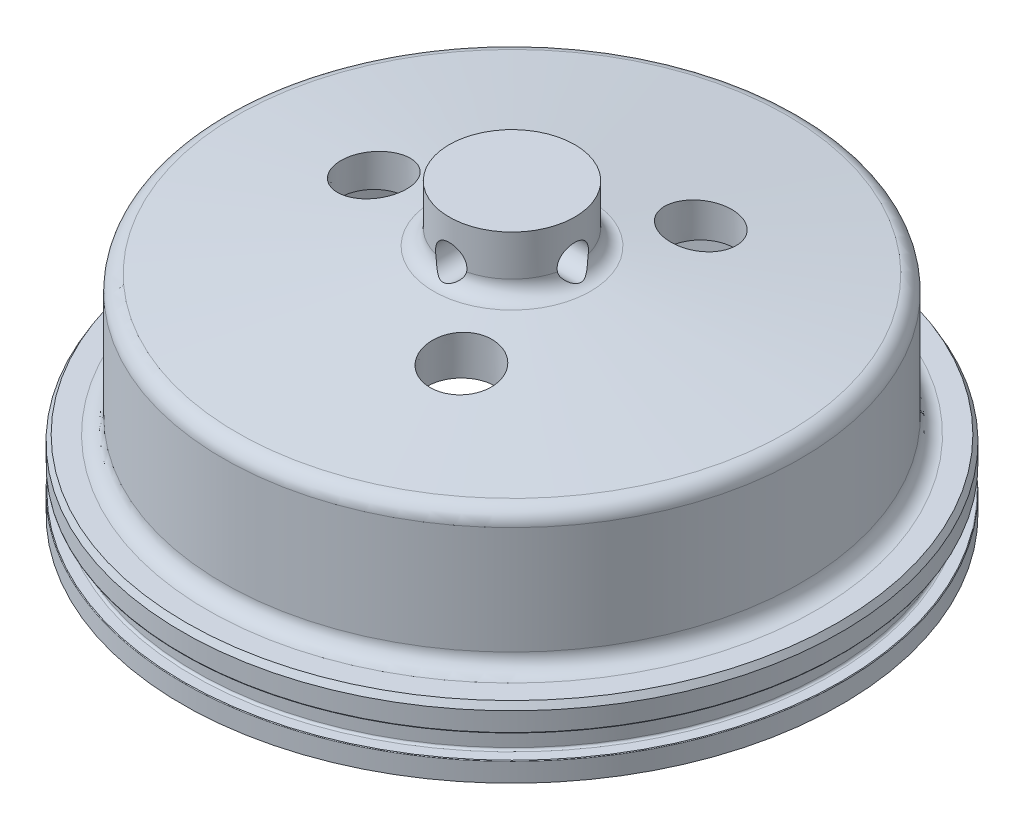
ISO-10303-21;
HEADER;
FILE_DESCRIPTION(('STEP AP214'),'2;1');
FILE_NAME('part.step','',(''),(''),'','','');
FILE_SCHEMA(('AUTOMOTIVE_DESIGN { 1 0 10303 214 1 1 1 1 }'));
ENDSEC;
DATA;
#1=APPLICATION_CONTEXT('core data for automotive mechanical design processes');
#2=APPLICATION_PROTOCOL_DEFINITION('international standard','automotive_design',2000,#1);
#3=PRODUCT_CONTEXT('',#1,'mechanical');
#4=PRODUCT('Part','Part','',(#3));
#5=PRODUCT_RELATED_PRODUCT_CATEGORY('part','',(#4));
#6=PRODUCT_DEFINITION_FORMATION('','',#4);
#7=PRODUCT_DEFINITION_CONTEXT('part definition',#1,'design');
#8=PRODUCT_DEFINITION('design','',#6,#7);
#9=PRODUCT_DEFINITION_SHAPE('','',#8);
#10=(LENGTH_UNIT() NAMED_UNIT(*) SI_UNIT(.MILLI.,.METRE.));
#11=(NAMED_UNIT(*) PLANE_ANGLE_UNIT() SI_UNIT($,.RADIAN.));
#12=(NAMED_UNIT(*) SI_UNIT($,.STERADIAN.) SOLID_ANGLE_UNIT());
#13=UNCERTAINTY_MEASURE_WITH_UNIT(LENGTH_MEASURE(1.E-05),#10,'distance_accuracy_value','');
#14=(GEOMETRIC_REPRESENTATION_CONTEXT(3) GLOBAL_UNCERTAINTY_ASSIGNED_CONTEXT((#13)) GLOBAL_UNIT_ASSIGNED_CONTEXT((#10,
#11,#12)) REPRESENTATION_CONTEXT('',''));
#15=CARTESIAN_POINT('',(0.,0.,0.));
#16=DIRECTION('',(0.,0.,1.));
#17=DIRECTION('',(1.,0.,0.));
#18=AXIS2_PLACEMENT_3D('',#15,#16,#17);
#19=CARTESIAN_POINT('',(5.5626,48.514,0.));
#20=DIRECTION('',(0.,1.,0.));
#21=DIRECTION('',(0.,0.,1.));
#22=AXIS2_PLACEMENT_3D('',#19,#20,#21);
#23=PLANE('',#22);
#24=CARTESIAN_POINT('',(0.,48.514,0.));
#25=DIRECTION('',(0.,-1.,0.));
#26=DIRECTION('',(0.,0.,-1.));
#27=AXIS2_PLACEMENT_3D('',#24,#25,#26);
#28=CIRCLE('',#27,6.55797649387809);
#29=CARTESIAN_POINT('',(2.20336764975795,48.514,-6.17674887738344));
#30=VERTEX_POINT('',#29);
#31=CARTESIAN_POINT('',(6.17674887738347,48.514,-2.20336764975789));
#32=VERTEX_POINT('',#31);
#33=EDGE_CURVE('E412',#30,#32,#28,.T.);
#34=ORIENTED_EDGE('',*,*,#33,.T.);
#35=DIRECTION('',(-1.,0.,0.));
#36=VECTOR('',#35,1.);
#37=CARTESIAN_POINT('',(0.,48.514,-2.20336764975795));
#38=LINE('',#37,#36);
#39=CARTESIAN_POINT('',(5.10761096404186,48.5139999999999,-2.20336764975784));
#40=VERTEX_POINT('',#39);
#41=EDGE_CURVE('E345',#32,#40,#38,.T.);
#42=ORIENTED_EDGE('',*,*,#41,.T.);
#43=CARTESIAN_POINT('',(0.,48.514,0.));
#44=DIRECTION('',(0.,-1.,0.));
#45=DIRECTION('',(0.,0.,-1.));
#46=AXIS2_PLACEMENT_3D('',#43,#44,#45);
#47=CIRCLE('',#46,5.5626);
#48=CARTESIAN_POINT('',(2.20336764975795,48.514,-5.10761096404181));
#49=VERTEX_POINT('',#48);
#50=EDGE_CURVE('E367',#49,#40,#47,.T.);
#51=ORIENTED_EDGE('',*,*,#50,.F.);
#52=DIRECTION('',(0.,0.,1.));
#53=VECTOR('',#52,1.);
#54=CARTESIAN_POINT('',(2.20336764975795,48.514,0.));
#55=LINE('',#54,#53);
#56=EDGE_CURVE('E334',#49,#30,#55,.F.);
#57=ORIENTED_EDGE('',*,*,#56,.T.);
#58=EDGE_LOOP('',(#34,#42,#51,#57));
#59=FACE_BOUND('',#58,.T.);
#60=ADVANCED_FACE('F48',(#59),#23,.F.);
#61=CARTESIAN_POINT('',(-6.17674887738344,48.514,-2.20336764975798));
#62=VERTEX_POINT('',#61);
#63=CARTESIAN_POINT('',(-2.20336764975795,48.514,-6.17674887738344));
#64=VERTEX_POINT('',#63);
#65=EDGE_CURVE('E382',#62,#64,#28,.T.);
#66=ORIENTED_EDGE('',*,*,#65,.T.);
#67=DIRECTION('',(0.,0.,1.));
#68=VECTOR('',#67,1.);
#69=CARTESIAN_POINT('',(-2.20336764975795,48.514,0.));
#70=LINE('',#69,#68);
#71=CARTESIAN_POINT('',(-2.20336764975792,48.514,-5.10761096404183));
#72=VERTEX_POINT('',#71);
#73=EDGE_CURVE('E330',#64,#72,#70,.T.);
#74=ORIENTED_EDGE('',*,*,#73,.T.);
#75=CARTESIAN_POINT('',(-5.1076109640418,48.514,-2.20336764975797));
#76=VERTEX_POINT('',#75);
#77=EDGE_CURVE('E379',#76,#72,#47,.T.);
#78=ORIENTED_EDGE('',*,*,#77,.F.);
#79=DIRECTION('',(1.,0.,0.));
#80=VECTOR('',#79,1.);
#81=CARTESIAN_POINT('',(0.,48.514,-2.20336764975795));
#82=LINE('',#81,#80);
#83=EDGE_CURVE('E404',#76,#62,#82,.F.);
#84=ORIENTED_EDGE('',*,*,#83,.T.);
#85=EDGE_LOOP('',(#66,#74,#78,#84));
#86=FACE_BOUND('',#85,.T.);
#87=ADVANCED_FACE('F403',(#86),#23,.F.);
#88=CARTESIAN_POINT('',(-2.20336764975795,48.514,6.17674887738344));
#89=VERTEX_POINT('',#88);
#90=CARTESIAN_POINT('',(-6.17674887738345,48.514,2.20336764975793));
#91=VERTEX_POINT('',#90);
#92=EDGE_CURVE('E375',#89,#91,#28,.T.);
#93=ORIENTED_EDGE('',*,*,#92,.T.);
#94=DIRECTION('',(1.,0.,0.));
#95=VECTOR('',#94,1.);
#96=CARTESIAN_POINT('',(0.,48.514,2.20336764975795));
#97=LINE('',#96,#95);
#98=CARTESIAN_POINT('',(-5.10761096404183,48.514,2.20336764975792));
#99=VERTEX_POINT('',#98);
#100=EDGE_CURVE('E519',#91,#99,#97,.T.);
#101=ORIENTED_EDGE('',*,*,#100,.T.);
#102=CARTESIAN_POINT('',(-2.20336764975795,48.514,5.10761096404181));
#103=VERTEX_POINT('',#102);
#104=EDGE_CURVE('E377',#103,#99,#47,.T.);
#105=ORIENTED_EDGE('',*,*,#104,.F.);
#106=DIRECTION('',(0.,0.,-1.));
#107=VECTOR('',#106,1.);
#108=CARTESIAN_POINT('',(-2.20336764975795,48.514,0.));
#109=LINE('',#108,#107);
#110=EDGE_CURVE('E520',#103,#89,#109,.F.);
#111=ORIENTED_EDGE('',*,*,#110,.T.);
#112=EDGE_LOOP('',(#93,#101,#105,#111));
#113=FACE_BOUND('',#112,.T.);
#114=ADVANCED_FACE('F485',(#113),#23,.F.);
#115=CARTESIAN_POINT('',(-50.8,0.,0.));
#116=DIRECTION('',(0.,1.,0.));
#117=DIRECTION('',(0.,0.,1.));
#118=AXIS2_PLACEMENT_3D('',#115,#116,#117);
#119=PLANE('',#118);
#120=CARTESIAN_POINT('',(-8.85182948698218,0.,58.0666773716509));
#121=DIRECTION('',(0.,-1.,0.));
#122=DIRECTION('',(0.,0.,-1.));
#123=AXIS2_PLACEMENT_3D('',#120,#121,#122);
#124=CIRCLE('',#123,1.72719999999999);
#125=CARTESIAN_POINT('',(-8.85182948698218,0.,56.3394773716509));
#126=VERTEX_POINT('',#125);
#127=EDGE_CURVE('E571',#126,#126,#124,.T.);
#128=ORIENTED_EDGE('',*,*,#127,.F.);
#129=EDGE_LOOP('',(#128));
#130=FACE_BOUND('',#129,.T.);
#131=CARTESIAN_POINT('',(41.2920170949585,0.,41.7739539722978));
#132=DIRECTION('',(0.,-1.,0.));
#133=DIRECTION('',(0.,0.,-1.));
#134=AXIS2_PLACEMENT_3D('',#131,#132,#133);
#135=CIRCLE('',#134,1.72719999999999);
#136=CARTESIAN_POINT('',(41.2920170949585,0.,40.0467539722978));
#137=VERTEX_POINT('',#136);
#138=EDGE_CURVE('E570',#137,#137,#135,.T.);
#139=ORIENTED_EDGE('',*,*,#138,.F.);
#140=EDGE_LOOP('',(#139));
#141=FACE_BOUND('',#140,.T.);
#142=CARTESIAN_POINT('',(52.4893261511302,0.,26.3621802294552));
#143=DIRECTION('',(0.,-1.,0.));
#144=DIRECTION('',(0.,0.,-1.));
#145=AXIS2_PLACEMENT_3D('',#142,#143,#144);
#146=CIRCLE('',#145,1.72719999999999);
#147=CARTESIAN_POINT('',(52.4893261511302,0.,24.6349802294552));
#148=VERTEX_POINT('',#147);
#149=EDGE_CURVE('E674',#148,#148,#146,.T.);
#150=ORIENTED_EDGE('',*,*,#149,.F.);
#151=EDGE_LOOP('',(#150));
#152=FACE_BOUND('',#151,.T.);
#153=CARTESIAN_POINT('',(52.4893261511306,0.,-26.3621802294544));
#154=DIRECTION('',(0.,-1.,0.));
#155=DIRECTION('',(0.,0.,-1.));
#156=AXIS2_PLACEMENT_3D('',#153,#154,#155);
#157=CIRCLE('',#156,1.72719999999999);
#158=CARTESIAN_POINT('',(52.4893261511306,0.,-28.0893802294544));
#159=VERTEX_POINT('',#158);
#160=EDGE_CURVE('E667',#159,#159,#157,.T.);
#161=ORIENTED_EDGE('',*,*,#160,.F.);
#162=EDGE_LOOP('',(#161));
#163=FACE_BOUND('',#162,.T.);
#164=CARTESIAN_POINT('',(41.2920170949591,0.,-41.7739539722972));
#165=DIRECTION('',(0.,-1.,0.));
#166=DIRECTION('',(0.,0.,-1.));
#167=AXIS2_PLACEMENT_3D('',#164,#165,#166);
#168=CIRCLE('',#167,1.72719999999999);
#169=CARTESIAN_POINT('',(41.2920170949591,0.,-43.5011539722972));
#170=VERTEX_POINT('',#169);
#171=EDGE_CURVE('E661',#170,#170,#168,.T.);
#172=ORIENTED_EDGE('',*,*,#171,.F.);
#173=EDGE_LOOP('',(#172));
#174=FACE_BOUND('',#173,.T.);
#175=CARTESIAN_POINT('',(-8.85182948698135,0.,-58.066677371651));
#176=DIRECTION('',(0.,-1.,0.));
#177=DIRECTION('',(0.,0.,-1.));
#178=AXIS2_PLACEMENT_3D('',#175,#176,#177);
#179=CIRCLE('',#178,1.72719999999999);
#180=CARTESIAN_POINT('',(-8.85182948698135,0.,-59.793877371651));
#181=VERTEX_POINT('',#180);
#182=EDGE_CURVE('E655',#181,#181,#179,.T.);
#183=ORIENTED_EDGE('',*,*,#182,.F.);
#184=EDGE_LOOP('',(#183));
#185=FACE_BOUND('',#184,.T.);
#186=CARTESIAN_POINT('',(-26.9694561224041,0.,-52.1799036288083));
#187=DIRECTION('',(0.,-1.,0.));
#188=DIRECTION('',(0.,0.,-1.));
#189=AXIS2_PLACEMENT_3D('',#186,#187,#188);
#190=CIRCLE('',#189,1.72719999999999);
#191=CARTESIAN_POINT('',(-26.9694561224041,0.,-53.9071036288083));
#192=VERTEX_POINT('',#191);
#193=EDGE_CURVE('E649',#192,#192,#190,.T.);
#194=ORIENTED_EDGE('',*,*,#193,.F.);
#195=EDGE_LOOP('',(#194));
#196=FACE_BOUND('',#195,.T.);
#197=CARTESIAN_POINT('',(-57.9600576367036,0.,-9.525));
#198=DIRECTION('',(0.,-1.,0.));
#199=DIRECTION('',(0.,0.,-1.));
#200=AXIS2_PLACEMENT_3D('',#197,#198,#199);
#201=CIRCLE('',#200,1.72719999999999);
#202=CARTESIAN_POINT('',(-57.9600576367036,0.,-11.2522));
#203=VERTEX_POINT('',#202);
#204=EDGE_CURVE('E642',#203,#203,#201,.T.);
#205=ORIENTED_EDGE('',*,*,#204,.F.);
#206=EDGE_LOOP('',(#205));
#207=FACE_BOUND('',#206,.T.);
#208=CARTESIAN_POINT('',(-57.9600576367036,0.,9.525));
#209=DIRECTION('',(0.,-1.,0.));
#210=DIRECTION('',(0.,0.,-1.));
#211=AXIS2_PLACEMENT_3D('',#208,#209,#210);
#212=CIRCLE('',#211,1.72719999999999);
#213=CARTESIAN_POINT('',(-57.9600576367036,0.,7.79780000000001));
#214=VERTEX_POINT('',#213);
#215=EDGE_CURVE('E634',#214,#214,#212,.T.);
#216=ORIENTED_EDGE('',*,*,#215,.F.);
#217=EDGE_LOOP('',(#216));
#218=FACE_BOUND('',#217,.T.);
#219=CARTESIAN_POINT('',(0.,0.,0.));
#220=DIRECTION('',(0.,-1.,0.));
#221=DIRECTION('',(0.,0.,-1.));
#222=AXIS2_PLACEMENT_3D('',#219,#220,#221);
#223=CIRCLE('',#222,50.8);
#224=CARTESIAN_POINT('',(0.,0.,-50.8));
#225=VERTEX_POINT('',#224);
#226=EDGE_CURVE('E561',#225,#225,#223,.T.);
#227=ORIENTED_EDGE('',*,*,#226,.F.);
#228=EDGE_LOOP('',(#227));
#229=FACE_BOUND('',#228,.T.);
#230=CARTESIAN_POINT('',(0.,0.,0.));
#231=DIRECTION('',(0.,-1.,0.));
#232=DIRECTION('',(0.,0.,-1.));
#233=AXIS2_PLACEMENT_3D('',#230,#231,#232);
#234=CIRCLE('',#233,66.675);
#235=CARTESIAN_POINT('',(0.,0.,-66.675));
#236=VERTEX_POINT('',#235);
#237=EDGE_CURVE('E587',#236,#236,#234,.T.);
#238=ORIENTED_EDGE('',*,*,#237,.T.);
#239=EDGE_LOOP('',(#238));
#240=FACE_BOUND('',#239,.T.);
#241=CARTESIAN_POINT('',(-26.9694561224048,0.,52.1799036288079));
#242=DIRECTION('',(0.,-1.,0.));
#243=DIRECTION('',(0.,0.,-1.));
#244=AXIS2_PLACEMENT_3D('',#241,#242,#243);
#245=CIRCLE('',#244,1.72719999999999);
#246=CARTESIAN_POINT('',(-26.9694561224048,0.,50.4527036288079));
#247=VERTEX_POINT('',#246);
#248=EDGE_CURVE('E395',#247,#247,#245,.T.);
#249=ORIENTED_EDGE('',*,*,#248,.F.);
#250=EDGE_LOOP('',(#249));
#251=FACE_BOUND('',#250,.T.);
#252=ADVANCED_FACE('F481',(#130,#141,#152,#163,#174,#185,#196,#207,#218,#229,#240,#251),#119,.F.);
#253=CARTESIAN_POINT('',(0.,4.38785,0.));
#254=DIRECTION('',(0.,-1.,0.));
#255=DIRECTION('',(0.,0.,-1.));
#256=AXIS2_PLACEMENT_3D('',#253,#254,#255);
#257=TOROIDAL_SURFACE('',#256,64.4779,0.4445);
#258=CARTESIAN_POINT('',(0.,3.94335,0.));
#259=DIRECTION('',(0.,-1.,0.));
#260=DIRECTION('',(0.,0.,-1.));
#261=AXIS2_PLACEMENT_3D('',#258,#259,#260);
#262=CIRCLE('',#261,64.4779);
#263=CARTESIAN_POINT('',(0.,3.94335,-64.4779));
#264=VERTEX_POINT('',#263);
#265=EDGE_CURVE('E455',#264,#264,#262,.T.);
#266=ORIENTED_EDGE('',*,*,#265,.F.);
#267=EDGE_LOOP('',(#266));
#268=FACE_BOUND('',#267,.T.);
#269=CARTESIAN_POINT('',(0.,4.38785,0.));
#270=DIRECTION('',(0.,-1.,0.));
#271=DIRECTION('',(0.,0.,-1.));
#272=AXIS2_PLACEMENT_3D('',#269,#270,#271);
#273=CIRCLE('',#272,64.0334);
#274=CARTESIAN_POINT('',(0.,4.38785,-64.0334));
#275=VERTEX_POINT('',#274);
#276=EDGE_CURVE('E433',#275,#275,#273,.T.);
#277=ORIENTED_EDGE('',*,*,#276,.T.);
#278=EDGE_LOOP('',(#277));
#279=FACE_BOUND('',#278,.T.);
#280=ADVANCED_FACE('F484',(#268,#279),#257,.F.);
#281=CARTESIAN_POINT('',(0.,0.,0.));
#282=DIRECTION('',(0.,-1.,0.));
#283=DIRECTION('',(0.,0.,-1.));
#284=AXIS2_PLACEMENT_3D('',#281,#282,#283);
#285=CYLINDRICAL_SURFACE('',#284,64.0334);
#286=ORIENTED_EDGE('',*,*,#276,.F.);
#287=EDGE_LOOP('',(#286));
#288=FACE_BOUND('',#287,.T.);
#289=CARTESIAN_POINT('',(0.,8.31215,0.));
#290=DIRECTION('',(0.,-1.,0.));
#291=DIRECTION('',(0.,0.,-1.));
#292=AXIS2_PLACEMENT_3D('',#289,#290,#291);
#293=CIRCLE('',#292,64.0334);
#294=CARTESIAN_POINT('',(0.,8.31215,-64.0334));
#295=VERTEX_POINT('',#294);
#296=EDGE_CURVE('E437',#295,#295,#293,.T.);
#297=ORIENTED_EDGE('',*,*,#296,.T.);
#298=EDGE_LOOP('',(#297));
#299=FACE_BOUND('',#298,.T.);
#300=ADVANCED_FACE('F1129',(#288,#299),#285,.T.);
#301=CARTESIAN_POINT('',(0.,8.31215,0.));
#302=DIRECTION('',(0.,-1.,0.));
#303=DIRECTION('',(0.,0.,-1.));
#304=AXIS2_PLACEMENT_3D('',#301,#302,#303);
#305=TOROIDAL_SURFACE('',#304,64.4779,0.4445);
#306=ORIENTED_EDGE('',*,*,#296,.F.);
#307=EDGE_LOOP('',(#306));
#308=FACE_BOUND('',#307,.T.);
#309=CARTESIAN_POINT('',(0.,8.75665,0.));
#310=DIRECTION('',(0.,-1.,0.));
#311=DIRECTION('',(0.,0.,-1.));
#312=AXIS2_PLACEMENT_3D('',#309,#310,#311);
#313=CIRCLE('',#312,64.4779);
#314=CARTESIAN_POINT('',(0.,8.75665,-64.4779));
#315=VERTEX_POINT('',#314);
#316=EDGE_CURVE('E445',#315,#315,#313,.T.);
#317=ORIENTED_EDGE('',*,*,#316,.T.);
#318=EDGE_LOOP('',(#317));
#319=FACE_BOUND('',#318,.T.);
#320=ADVANCED_FACE('F1120',(#308,#319),#305,.F.);
#321=CARTESIAN_POINT('',(-66.548,8.75665,0.));
#322=DIRECTION('',(0.,1.,0.));
#323=DIRECTION('',(0.,0.,1.));
#324=AXIS2_PLACEMENT_3D('',#321,#322,#323);
#325=PLANE('',#324);
#326=ORIENTED_EDGE('',*,*,#316,.F.);
#327=EDGE_LOOP('',(#326));
#328=FACE_BOUND('',#327,.T.);
#329=CARTESIAN_POINT('',(0.,8.75665,0.));
#330=DIRECTION('',(0.,-1.,0.));
#331=DIRECTION('',(0.,0.,-1.));
#332=AXIS2_PLACEMENT_3D('',#329,#330,#331);
#333=CIRCLE('',#332,66.548);
#334=CARTESIAN_POINT('',(0.,8.75665,-66.548));
#335=VERTEX_POINT('',#334);
#336=EDGE_CURVE('E599',#335,#335,#333,.T.);
#337=ORIENTED_EDGE('',*,*,#336,.T.);
#338=EDGE_LOOP('',(#337));
#339=FACE_BOUND('',#338,.T.);
#340=ADVANCED_FACE('F1111',(#328,#339),#325,.F.);
#341=CARTESIAN_POINT('',(0.,8.88365,0.));
#342=DIRECTION('',(0.,-1.,0.));
#343=DIRECTION('',(0.,0.,-1.));
#344=AXIS2_PLACEMENT_3D('',#341,#342,#343);
#345=TOROIDAL_SURFACE('',#344,66.548,0.127000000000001);
#346=ORIENTED_EDGE('',*,*,#336,.F.);
#347=EDGE_LOOP('',(#346));
#348=FACE_BOUND('',#347,.T.);
#349=CARTESIAN_POINT('',(0.,8.88365,0.));
#350=DIRECTION('',(0.,-1.,0.));
#351=DIRECTION('',(0.,0.,-1.));
#352=AXIS2_PLACEMENT_3D('',#349,#350,#351);
#353=CIRCLE('',#352,66.675);
#354=CARTESIAN_POINT('',(0.,8.88365,-66.675));
#355=VERTEX_POINT('',#354);
#356=EDGE_CURVE('E594',#355,#355,#353,.T.);
#357=ORIENTED_EDGE('',*,*,#356,.T.);
#358=EDGE_LOOP('',(#357));
#359=FACE_BOUND('',#358,.T.);
#360=ADVANCED_FACE('F1102',(#348,#359),#345,.T.);
#361=CARTESIAN_POINT('',(0.,0.,0.));
#362=DIRECTION('',(0.,-1.,0.));
#363=DIRECTION('',(0.,0.,-1.));
#364=AXIS2_PLACEMENT_3D('',#361,#362,#363);
#365=CYLINDRICAL_SURFACE('',#364,66.675);
#366=ORIENTED_EDGE('',*,*,#356,.F.);
#367=EDGE_LOOP('',(#366));
#368=FACE_BOUND('',#367,.T.);
#369=CARTESIAN_POINT('',(0.,12.7,0.));
#370=DIRECTION('',(0.,-1.,0.));
#371=DIRECTION('',(0.,0.,-1.));
#372=AXIS2_PLACEMENT_3D('',#369,#370,#371);
#373=CIRCLE('',#372,66.675);
#374=CARTESIAN_POINT('',(0.,12.7,-66.675));
#375=VERTEX_POINT('',#374);
#376=EDGE_CURVE('E591',#375,#375,#373,.T.);
#377=ORIENTED_EDGE('',*,*,#376,.T.);
#378=EDGE_LOOP('',(#377));
#379=FACE_BOUND('',#378,.T.);
#380=ADVANCED_FACE('F1093',(#368,#379),#365,.T.);
#381=CARTESIAN_POINT('',(0.,13.97,0.));
#382=DIRECTION('',(0.,-1.,0.));
#383=DIRECTION('',(0.,0.,-1.));
#384=AXIS2_PLACEMENT_3D('',#381,#382,#383);
#385=CONICAL_SURFACE('',#384,65.9417651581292,0.523598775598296);
#386=ORIENTED_EDGE('',*,*,#376,.F.);
#387=EDGE_LOOP('',(#386));
#388=FACE_BOUND('',#387,.T.);
#389=CARTESIAN_POINT('',(0.,13.97,0.));
#390=DIRECTION('',(0.,-1.,0.));
#391=DIRECTION('',(0.,0.,-1.));
#392=AXIS2_PLACEMENT_3D('',#389,#390,#391);
#393=CIRCLE('',#392,65.9417651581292);
#394=CARTESIAN_POINT('',(0.,13.97,-65.9417651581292));
#395=VERTEX_POINT('',#394);
#396=EDGE_CURVE('E579',#395,#395,#393,.T.);
#397=ORIENTED_EDGE('',*,*,#396,.T.);
#398=EDGE_LOOP('',(#397));
#399=FACE_BOUND('',#398,.T.);
#400=ADVANCED_FACE('F1084',(#388,#399),#385,.T.);
#401=CARTESIAN_POINT('',(-61.595,13.97,0.));
#402=DIRECTION('',(0.,-1.,0.));
#403=DIRECTION('',(0.,0.,-1.));
#404=AXIS2_PLACEMENT_3D('',#401,#402,#403);
#405=PLANE('',#404);
#406=ORIENTED_EDGE('',*,*,#396,.F.);
#407=EDGE_LOOP('',(#406));
#408=FACE_BOUND('',#407,.T.);
#409=CARTESIAN_POINT('',(0.,13.97,0.));
#410=DIRECTION('',(0.,-1.,0.));
#411=DIRECTION('',(0.,0.,-1.));
#412=AXIS2_PLACEMENT_3D('',#409,#410,#411);
#413=CIRCLE('',#412,61.595);
#414=CARTESIAN_POINT('',(0.,13.97,-61.595));
#415=VERTEX_POINT('',#414);
#416=EDGE_CURVE('E575',#415,#415,#413,.T.);
#417=ORIENTED_EDGE('',*,*,#416,.T.);
#418=EDGE_LOOP('',(#417));
#419=FACE_BOUND('',#418,.T.);
#420=ADVANCED_FACE('F1074',(#408,#419),#405,.F.);
#421=CARTESIAN_POINT('',(0.,17.145,0.));
#422=DIRECTION('',(0.,-1.,0.));
#423=DIRECTION('',(0.,0.,-1.));
#424=AXIS2_PLACEMENT_3D('',#421,#422,#423);
#425=TOROIDAL_SURFACE('',#424,61.595,3.175);
#426=ORIENTED_EDGE('',*,*,#416,.F.);
#427=EDGE_LOOP('',(#426));
#428=FACE_BOUND('',#427,.T.);
#429=CARTESIAN_POINT('',(0.,17.145,0.));
#430=DIRECTION('',(0.,-1.,0.));
#431=DIRECTION('',(0.,0.,-1.));
#432=AXIS2_PLACEMENT_3D('',#429,#430,#431);
#433=CIRCLE('',#432,58.42);
#434=CARTESIAN_POINT('',(0.,17.145,-58.42));
#435=VERTEX_POINT('',#434);
#436=EDGE_CURVE('E565',#435,#435,#433,.T.);
#437=ORIENTED_EDGE('',*,*,#436,.T.);
#438=EDGE_LOOP('',(#437));
#439=FACE_BOUND('',#438,.T.);
#440=ADVANCED_FACE('F1064',(#428,#439),#425,.F.);
#441=CARTESIAN_POINT('',(0.,0.,0.));
#442=DIRECTION('',(0.,-1.,0.));
#443=DIRECTION('',(0.,0.,-1.));
#444=AXIS2_PLACEMENT_3D('',#441,#442,#443);
#445=CYLINDRICAL_SURFACE('',#444,58.42);
#446=ORIENTED_EDGE('',*,*,#436,.F.);
#447=EDGE_LOOP('',(#446));
#448=FACE_BOUND('',#447,.T.);
#449=CARTESIAN_POINT('',(0.,38.9571281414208,0.));
#450=DIRECTION('',(0.,-1.,0.));
#451=DIRECTION('',(0.,0.,-1.));
#452=AXIS2_PLACEMENT_3D('',#449,#450,#451);
#453=CIRCLE('',#452,58.42);
#454=CARTESIAN_POINT('',(0.,38.9571281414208,-58.42));
#455=VERTEX_POINT('',#454);
#456=EDGE_CURVE('E556',#455,#455,#453,.T.);
#457=ORIENTED_EDGE('',*,*,#456,.T.);
#458=EDGE_LOOP('',(#457));
#459=FACE_BOUND('',#458,.T.);
#460=ADVANCED_FACE('F1055',(#448,#459),#445,.T.);
#461=CARTESIAN_POINT('',(0.,38.9571281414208,0.));
#462=DIRECTION('',(0.,-1.,0.));
#463=DIRECTION('',(0.,0.,-1.));
#464=AXIS2_PLACEMENT_3D('',#461,#462,#463);
#465=TOROIDAL_SURFACE('',#464,55.245,3.175);
#466=ORIENTED_EDGE('',*,*,#456,.F.);
#467=EDGE_LOOP('',(#466));
#468=FACE_BOUND('',#467,.T.);
#469=CARTESIAN_POINT('',(0.,42.108462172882,0.));
#470=DIRECTION('',(0.,-1.,0.));
#471=DIRECTION('',(0.,0.,-1.));
#472=AXIS2_PLACEMENT_3D('',#469,#470,#471);
#473=CIRCLE('',#472,55.6319351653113);
#474=CARTESIAN_POINT('',(0.,42.108462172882,-55.6319351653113));
#475=VERTEX_POINT('',#474);
#476=EDGE_CURVE('E553',#475,#475,#473,.T.);
#477=ORIENTED_EDGE('',*,*,#476,.T.);
#478=EDGE_LOOP('',(#477));
#479=FACE_BOUND('',#478,.T.);
#480=ADVANCED_FACE('F792',(#468,#479),#465,.T.);
#481=CARTESIAN_POINT('',(0.,46.99,0.));
#482=DIRECTION('',(0.,-1.,0.));
#483=DIRECTION('',(0.,0.,-1.));
#484=AXIS2_PLACEMENT_3D('',#481,#482,#483);
#485=CONICAL_SURFACE('',#484,15.875,1.44862327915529);
#486=CARTESIAN_POINT('',(17.3005228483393,44.6907307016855,29.9653845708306));
#487=CARTESIAN_POINT('',(17.1395630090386,44.6907306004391,30.0583163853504));
#488=CARTESIAN_POINT('',(16.9747184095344,44.6915049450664,30.1444748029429));
#489=CARTESIAN_POINT('',(16.6383428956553,44.6945993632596,30.3026877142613));
#490=CARTESIAN_POINT('',(16.4668102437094,44.6969198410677,30.3747385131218));
#491=CARTESIAN_POINT('',(16.1181798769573,44.703100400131,30.5042478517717));
#492=CARTESIAN_POINT('',(15.9410773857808,44.7069618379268,30.5616934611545));
#493=CARTESIAN_POINT('',(15.5826465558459,44.7162102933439,30.6615281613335));
#494=CARTESIAN_POINT('',(15.4013166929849,44.7215978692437,30.7039117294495));
#495=CARTESIAN_POINT('',(15.0359588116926,44.7338703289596,30.7732684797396));
#496=CARTESIAN_POINT('',(14.8519334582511,44.7407538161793,30.800255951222));
#497=CARTESIAN_POINT('',(14.4822602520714,44.7559956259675,30.8387100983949));
#498=CARTESIAN_POINT('',(14.2966118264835,44.7643544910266,30.850171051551));
#499=CARTESIAN_POINT('',(13.9251923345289,44.7825052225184,30.8574856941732));
#500=CARTESIAN_POINT('',(13.7394214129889,44.7922962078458,30.8533489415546));
#501=CARTESIAN_POINT('',(13.3688892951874,44.8132780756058,30.8295324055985));
#502=CARTESIAN_POINT('',(13.1841284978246,44.8244694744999,30.8098468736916));
#503=CARTESIAN_POINT('',(12.8166928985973,44.8482213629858,30.7550402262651));
#504=CARTESIAN_POINT('',(12.6340219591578,44.8607840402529,30.7198941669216));
#505=CARTESIAN_POINT('',(12.2722940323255,44.8872146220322,30.6344152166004));
#506=CARTESIAN_POINT('',(12.0932384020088,44.9010830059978,30.5840767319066));
#507=CARTESIAN_POINT('',(11.7401262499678,44.9300560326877,30.4686135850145));
#508=CARTESIAN_POINT('',(11.5660681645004,44.9451602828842,30.4034936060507));
#509=CARTESIAN_POINT('',(11.2240479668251,44.976547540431,30.2589133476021));
#510=CARTESIAN_POINT('',(11.0560881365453,44.9928309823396,30.1794477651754));
#511=CARTESIAN_POINT('',(10.7268453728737,45.0265653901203,30.0064262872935));
#512=CARTESIAN_POINT('',(10.5655918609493,45.0440207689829,29.9128152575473));
#513=CARTESIAN_POINT('',(10.25155287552,45.0799646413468,29.7123889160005));
#514=CARTESIAN_POINT('',(10.0987705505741,45.098453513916,29.605568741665));
#515=CARTESIAN_POINT('',(9.80284654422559,45.1363648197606,29.3795499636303));
#516=CARTESIAN_POINT('',(9.65970152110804,45.1557869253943,29.2603556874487));
#517=CARTESIAN_POINT('',(9.3839709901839,45.1954734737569,29.0104233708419));
#518=CARTESIAN_POINT('',(9.25138941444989,45.2157382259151,28.8796810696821));
#519=CARTESIAN_POINT('',(8.86969875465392,45.2778456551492,28.4701522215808));
#520=CARTESIAN_POINT('',(8.6378917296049,45.3208421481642,28.1750182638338));
#521=CARTESIAN_POINT('',(8.22745109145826,45.4088534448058,27.5503396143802));
#522=CARTESIAN_POINT('',(8.0488188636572,45.453868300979,27.2207940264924));
#523=CARTESIAN_POINT('',(7.74881952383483,45.5450545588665,26.5349038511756));
#524=CARTESIAN_POINT('',(7.62771133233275,45.591230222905,26.1784463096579));
#525=CARTESIAN_POINT('',(7.44740822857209,45.6832723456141,25.4501708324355));
#526=CARTESIAN_POINT('',(7.38821453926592,45.7291387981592,25.0783525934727));
#527=CARTESIAN_POINT('',(7.33341493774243,45.8192121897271,24.329221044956));
#528=CARTESIAN_POINT('',(7.33791452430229,45.8634162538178,23.9518996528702));
#529=CARTESIAN_POINT('',(7.41077890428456,45.9484963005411,23.2030835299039));
#530=CARTESIAN_POINT('',(7.47914334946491,45.9893723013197,22.8315887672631));
#531=CARTESIAN_POINT('',(7.67768168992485,46.0659734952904,22.1062135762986));
#532=CARTESIAN_POINT('',(7.80765869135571,46.1017146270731,21.752280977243));
#533=CARTESIAN_POINT('',(8.12587858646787,46.1664891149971,21.0709844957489));
#534=CARTESIAN_POINT('',(8.31411876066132,46.195522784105,20.7436193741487));
#535=CARTESIAN_POINT('',(8.74181578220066,46.2450836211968,20.1277018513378));
#536=CARTESIAN_POINT('',(8.98082074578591,46.2656814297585,19.8388413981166));
#537=CARTESIAN_POINT('',(9.50427273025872,46.2974904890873,19.3051345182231));
#538=CARTESIAN_POINT('',(9.78871656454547,46.3087023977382,19.060285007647));
#539=CARTESIAN_POINT('',(10.3918025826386,46.3209575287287,18.6240242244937));
#540=CARTESIAN_POINT('',(10.7100714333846,46.3221020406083,18.4320995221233));
#541=CARTESIAN_POINT('',(11.374013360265,46.3144139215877,18.1039503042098));
#542=CARTESIAN_POINT('',(11.7196856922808,46.3055815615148,17.9677242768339));
#543=CARTESIAN_POINT('',(12.4272639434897,46.2785523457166,17.7551354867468));
#544=CARTESIAN_POINT('',(12.7891078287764,46.2603888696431,17.6785617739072));
#545=CARTESIAN_POINT('',(13.5199746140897,46.2157977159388,17.586420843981));
#546=CARTESIAN_POINT('',(13.8889977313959,46.1893697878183,17.5708554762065));
#547=CARTESIAN_POINT('',(14.6263119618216,46.1294841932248,17.6010126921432));
#548=CARTESIAN_POINT('',(14.9945835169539,46.0959829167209,17.6471254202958));
#549=CARTESIAN_POINT('',(15.7178355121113,46.0236656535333,17.7997873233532));
#550=CARTESIAN_POINT('',(16.0728152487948,45.9848493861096,17.9063396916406));
#551=CARTESIAN_POINT('',(16.7633190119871,45.9031067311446,18.1781368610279));
#552=CARTESIAN_POINT('',(17.0986052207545,45.8601421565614,18.3439743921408));
#553=CARTESIAN_POINT('',(17.7364248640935,45.7720287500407,18.7293799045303));
#554=CARTESIAN_POINT('',(18.038956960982,45.7268798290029,18.9489500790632));
#555=CARTESIAN_POINT('',(18.6048766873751,45.6355250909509,19.4373219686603));
#556=CARTESIAN_POINT('',(18.8679692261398,45.5893140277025,19.706464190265));
#557=CARTESIAN_POINT('',(19.3450690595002,45.4974364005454,20.2855477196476));
#558=CARTESIAN_POINT('',(19.5590754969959,45.4517698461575,20.5954897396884));
#559=CARTESIAN_POINT('',(19.8386394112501,45.3845661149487,21.0842312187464));
#560=CARTESIAN_POINT('',(19.9250108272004,45.3623509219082,21.2513653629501));
#561=CARTESIAN_POINT('',(20.0832755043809,45.3184832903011,21.5924038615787));
#562=CARTESIAN_POINT('',(20.1551741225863,45.2968306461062,21.766305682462));
#563=CARTESIAN_POINT('',(20.2839834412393,45.2542020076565,22.1197150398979));
#564=CARTESIAN_POINT('',(20.3408885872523,45.2332262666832,22.2992246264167));
#565=CARTESIAN_POINT('',(20.4392413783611,45.192078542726,22.6624504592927));
#566=CARTESIAN_POINT('',(20.4806948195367,45.1719062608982,22.8461651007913));
#567=CARTESIAN_POINT('',(20.547776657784,45.1325065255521,23.2161327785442));
#568=CARTESIAN_POINT('',(20.5734401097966,45.1132770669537,23.4023792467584));
#569=CARTESIAN_POINT('',(20.6088737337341,45.0758180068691,23.776407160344));
#570=CARTESIAN_POINT('',(20.618649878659,45.0575880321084,23.9641880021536));
#571=CARTESIAN_POINT('',(20.6222331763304,45.0222029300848,24.3400641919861));
#572=CARTESIAN_POINT('',(20.6160352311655,45.0050481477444,24.528159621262));
#573=CARTESIAN_POINT('',(20.5876848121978,44.9719070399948,24.9031766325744));
#574=CARTESIAN_POINT('',(20.5655383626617,44.9559202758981,25.0900986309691));
#575=CARTESIAN_POINT('',(20.5055718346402,44.9252526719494,25.4606300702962));
#576=CARTESIAN_POINT('',(20.4678244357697,44.91056615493,25.6442508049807));
#577=CARTESIAN_POINT('',(20.3769276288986,44.8824878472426,26.0076673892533));
#578=CARTESIAN_POINT('',(20.3237840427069,44.8690955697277,26.1874646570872));
#579=CARTESIAN_POINT('',(20.2024128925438,44.8436506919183,26.5421134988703));
#580=CARTESIAN_POINT('',(20.13417626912,44.8315989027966,26.7169620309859));
#581=CARTESIAN_POINT('',(19.9831379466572,44.8089007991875,27.0602673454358));
#582=CARTESIAN_POINT('',(19.900341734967,44.7982539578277,27.2287265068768));
#583=CARTESIAN_POINT('',(19.7211346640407,44.7784488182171,27.5573865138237));
#584=CARTESIAN_POINT('',(19.6247840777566,44.7692842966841,27.7176198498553));
#585=CARTESIAN_POINT('',(19.418916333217,44.7524300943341,28.0293880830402));
#586=CARTESIAN_POINT('',(19.3094041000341,44.7447398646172,28.1809262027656));
#587=CARTESIAN_POINT('',(19.0780601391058,44.7308682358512,28.4741416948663));
#588=CARTESIAN_POINT('',(18.9562396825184,44.724685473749,28.6158278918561));
#589=CARTESIAN_POINT('',(18.701107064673,44.7138468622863,28.888421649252));
#590=CARTESIAN_POINT('',(18.5677979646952,44.7091906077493,29.0193320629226));
#591=CARTESIAN_POINT('',(18.2562114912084,44.7004583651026,29.300503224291));
#592=CARTESIAN_POINT('',(18.0749773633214,44.696812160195,29.4475192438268));
#593=CARTESIAN_POINT('',(17.6980387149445,44.6919483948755,29.7217009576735));
#594=CARTESIAN_POINT('',(17.5023342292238,44.6907308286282,29.8488666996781));
#595=CARTESIAN_POINT('',(17.3005228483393,44.6907307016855,29.9653845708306));
#596=B_SPLINE_CURVE_WITH_KNOTS('',3,(#486,#487,#488,#489,#490,#491,#492,#493,#494,#495,#496,
#497,#498,#499,#500,#501,#502,#503,#504,#505,#506,#507,#508,#509,#510,#511,#512,#513,#514,#515,
#516,#517,#518,#519,#520,#521,#522,#523,#524,#525,#526,#527,#528,#529,#530,#531,#532,#533,#534,
#535,#536,#537,#538,#539,#540,#541,#542,#543,#544,#545,#546,#547,#548,#549,#550,#551,#552,#553,
#554,#555,#556,#557,#558,#559,#560,#561,#562,#563,#564,#565,#566,#567,#568,#569,#570,#571,#572,
#573,#574,#575,#576,#577,#578,#579,#580,#581,#582,#583,#584,#585,#586,#587,#588,#589,#590,#591,
#592,#593,#594,#595),.UNSPECIFIED.,.T.,.F.,(4,2,2,2,2,2,2,2,2,2,2,2,2,2,2,2,2,2,2,2,2,2,2,2,2,2,
2,2,2,2,2,2,2,2,2,2,2,2,2,2,2,2,2,2,2,2,2,2,2,2,2,2,2,2,4),(0.,0.557379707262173,
1.11490520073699,1.67292258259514,2.23114435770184,2.78884719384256,3.34675552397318,
3.90432203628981,4.46209478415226,5.02077075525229,5.57965267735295,6.13835777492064,
6.69726982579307,7.25841937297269,7.81977610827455,8.38093718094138,8.94230617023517,
10.0697227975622,11.197168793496,12.3296425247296,13.4621386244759,14.596510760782,
15.730876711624,16.8616417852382,17.9923540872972,19.1133942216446,20.2343557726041,
21.344026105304,22.4536663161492,23.5593644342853,24.6650960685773,25.7778551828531,
26.8906730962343,28.0149432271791,29.1392592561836,30.2716074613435,31.403975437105,
31.9717396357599,32.5392932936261,33.1070569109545,33.6746073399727,34.2408931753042,
34.8069660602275,35.3732196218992,35.9392594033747,36.5026913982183,37.0659106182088,
37.6294688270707,38.1928150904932,38.7537311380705,39.3144379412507,39.8746358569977,
40.434684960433,41.1335290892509,41.8323715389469),.UNSPECIFIED.);
#597=CARTESIAN_POINT('',(17.3005228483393,44.6907307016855,29.9653845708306));
#598=VERTEX_POINT('',#597);
#599=EDGE_CURVE('E229',#598,#598,#596,.T.);
#600=ORIENTED_EDGE('',*,*,#599,.T.);
#601=EDGE_LOOP('',(#600));
#602=FACE_BOUND('',#601,.T.);
#603=CARTESIAN_POINT('',(17.3005228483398,44.6907307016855,-29.9653845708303));
#604=CARTESIAN_POINT('',(17.4614840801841,44.6907306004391,-29.8724551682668));
#605=CARTESIAN_POINT('',(17.6185217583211,44.6915049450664,-29.7727747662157));
#606=CARTESIAN_POINT('',(17.9237259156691,44.6945993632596,-29.5605714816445));
#607=CARTESIAN_POINT('',(18.0718900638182,44.6969198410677,-29.4480452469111));
#608=CARTESIAN_POINT('',(18.3583636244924,44.703100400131,-29.2108771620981));
#609=CARTESIAN_POINT('',(18.4966642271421,44.7069618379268,-29.0862247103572));
#610=CARTESIAN_POINT('',(18.7623390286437,44.7162102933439,-28.8257318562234));
#611=CARTESIAN_POINT('',(18.8897092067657,44.7215978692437,-28.6898873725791));
#612=CARTESIAN_POINT('',(19.132452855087,44.7338703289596,-28.4081565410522));
#613=CARTESIAN_POINT('',(19.2478373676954,44.7407538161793,-28.2622796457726));
#614=CARTESIAN_POINT('',(19.4659762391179,44.7559956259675,-27.961360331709));
#615=CARTESIAN_POINT('',(19.5687259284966,44.7643544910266,-27.8063145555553));
#616=CARTESIAN_POINT('',(19.7607703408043,44.7825052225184,-27.488313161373));
#617=CARTESIAN_POINT('',(19.8500732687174,44.7922962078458,-27.3253624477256));
#618=CARTESIAN_POINT('',(20.0147136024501,44.8132780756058,-26.9925639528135));
#619=CARTESIAN_POINT('',(20.0900458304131,44.8244694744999,-26.8227136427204));
#620=CARTESIAN_POINT('',(20.2262996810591,44.8482213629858,-26.4771017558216));
#621=CARTESIAN_POINT('',(20.2871977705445,44.8607840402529,-26.301331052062));
#622=CARTESIAN_POINT('',(20.3940347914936,44.8872146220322,-25.9453260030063));
#623=CARTESIAN_POINT('',(20.4399682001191,44.9010830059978,-25.7650900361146));
#624=CARTESIAN_POINT('',(20.5165302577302,44.9300560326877,-25.4015543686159));
#625=CARTESIAN_POINT('',(20.5471637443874,44.9451602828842,-25.2182556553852));
#626=CARTESIAN_POINT('',(20.5929636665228,44.976547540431,-24.8497673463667));
#627=CARTESIAN_POINT('',(20.6081243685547,44.9928309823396,-24.6645770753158));
#628=CARTESIAN_POINT('',(20.6229047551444,45.0265653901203,-24.292933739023));
#629=CARTESIAN_POINT('',(20.6224619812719,45.0440207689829,-24.106478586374));
#630=CARTESIAN_POINT('',(20.6059071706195,45.0799646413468,-23.7342996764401));
#631=CARTESIAN_POINT('',(20.5897893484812,45.098453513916,-23.5485762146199));
#632=CARTESIAN_POINT('',(20.5420133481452,45.1363648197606,-23.1792891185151));
#633=CARTESIAN_POINT('',(20.510360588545,45.1557869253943,-22.9957247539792));
#634=CARTESIAN_POINT('',(20.4317781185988,45.1954734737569,-22.6319689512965));
#635=CARTESIAN_POINT('',(20.3848427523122,45.2157382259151,-22.4517787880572));
#636=CARTESIAN_POINT('',(20.2210256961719,45.2778456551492,-21.916460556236));
#637=CARTESIAN_POINT('',(20.0813357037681,45.3208421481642,-21.5681428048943));
#638=CARTESIAN_POINT('',(19.7455684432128,45.4088534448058,-20.900351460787));
#639=CARTESIAN_POINT('',(19.5494897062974,45.453868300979,-20.5808786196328));
#640=CARTESIAN_POINT('',(19.1054910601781,45.5450545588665,-19.9781264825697));
#641=CARTESIAN_POINT('',(18.8573438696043,45.591230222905,-19.6950149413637));
#642=CARTESIAN_POINT('',(18.3167903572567,45.6832723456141,-19.1747301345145));
#643=CARTESIAN_POINT('',(18.0243831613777,45.7291387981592,-18.9375577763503));
#644=CARTESIAN_POINT('',(17.4030160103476,45.8192121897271,-18.5155341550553));
#645=CARTESIAN_POINT('',(17.0739963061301,45.8634162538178,-18.3307702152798));
#646=CARTESIAN_POINT('',(16.3890703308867,45.9484963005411,-18.0194645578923));
#647=CARTESIAN_POINT('',(16.0331642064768,45.9893723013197,-17.8929225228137));
#648=CARTESIAN_POINT('',(15.3057016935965,46.0659734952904,-17.7021741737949));
#649=CARTESIAN_POINT('',(14.9341985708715,46.1017146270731,-17.637771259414));
#650=CARTESIAN_POINT('',(14.1850685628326,46.1664891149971,-17.5727095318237));
#651=CARTESIAN_POINT('',(13.8074419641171,46.195522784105,-17.5720477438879));
#652=CARTESIAN_POINT('',(13.0601932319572,46.2450836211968,-17.6344854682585));
#653=CARTESIAN_POINT('',(12.6905302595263,46.2656814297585,-17.6970396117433));
#654=CARTESIAN_POINT('',(11.9666005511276,46.2974904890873,-17.8835088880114));
#655=CARTESIAN_POINT('',(11.6123327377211,46.3087023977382,-18.0074197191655));
#656=CARTESIAN_POINT('',(10.932976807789,46.3209575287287,-18.3115771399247));
#657=CARTESIAN_POINT('',(10.6076307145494,46.3221020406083,-18.4912436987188));
#658=CARTESIAN_POINT('',(9.99147419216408,46.3144139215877,-18.902159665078));
#659=CARTESIAN_POINT('',(9.70066282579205,46.3055815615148,-19.1334076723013));
#660=CARTESIAN_POINT('',(9.16276640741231,46.2785523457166,-19.6398940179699));
#661=CARTESIAN_POINT('',(8.91552968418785,46.2603888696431,-19.9149731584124));
#662=CARTESIAN_POINT('',(8.47029990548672,46.2157977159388,-20.501851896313));
#663=CARTESIAN_POINT('',(8.27230834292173,46.1893697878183,-20.8136526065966));
#664=CARTESIAN_POINT('',(7.92976814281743,46.1294841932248,-21.4672640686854));
#665=CARTESIAN_POINT('',(7.78556715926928,46.0959829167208,-21.8092529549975));
#666=CARTESIAN_POINT('',(7.55615024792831,46.0236656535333,-22.5119385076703));
#667=CARTESIAN_POINT('',(7.47093743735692,45.9848493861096,-22.8726361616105));
#668=CARTESIAN_POINT('',(7.36106880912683,45.9031067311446,-23.6065285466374));
#669=CARTESIAN_POINT('',(7.33704521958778,45.8601421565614,-23.9798136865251));
#670=CARTESIAN_POINT('',(7.35190636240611,45.7720287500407,-24.7248844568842));
#671=CARTESIAN_POINT('',(7.39079366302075,45.7268798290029,-25.0966700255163));
#672=CARTESIAN_POINT('',(7.53077626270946,45.6355250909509,-25.8309568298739));
#673=CARTESIAN_POINT('',(7.63231399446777,45.5893140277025,-26.1933727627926));
#674=CARTESIAN_POINT('',(7.89526512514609,45.4974364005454,-26.8960951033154));
#675=CARTESIAN_POINT('',(8.05667956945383,45.4517698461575,-27.2364011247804));
#676=CARTESIAN_POINT('',(8.34016014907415,45.3845661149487,-27.722881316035));
#677=CARTESIAN_POINT('',(8.4417168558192,45.3623509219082,-27.8812482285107));
#678=CARTESIAN_POINT('',(8.6579325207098,45.3184832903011,-28.188828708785));
#679=CARTESIAN_POINT('',(8.77258660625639,45.2968306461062,-28.3380456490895));
#680=CARTESIAN_POINT('',(9.01424342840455,45.2542020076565,-28.6263024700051));
#681=CARTESIAN_POINT('',(9.14125071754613,45.2332262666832,-28.7653385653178));
#682=CARTESIAN_POINT('',(9.40663712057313,45.192078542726,-29.0321274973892));
#683=CARTESIAN_POINT('',(9.54501194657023,45.1719062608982,-29.1598845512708));
#684=CARTESIAN_POINT('',(9.83187243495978,45.1325065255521,-29.4029629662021));
#685=CARTESIAN_POINT('',(9.98033488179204,45.1132770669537,-29.5183114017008));
#686=CARTESIAN_POINT('',(10.286535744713,45.0758180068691,-29.7360117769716));
#687=CARTESIAN_POINT('',(10.4442706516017,45.0575880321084,-29.8383685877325));
#688=CARTESIAN_POINT('',(10.7679973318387,45.0222029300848,-30.0294099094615));
#689=CARTESIAN_POINT('',(10.9339917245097,45.0050481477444,-30.1180900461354));
#690=CARTESIAN_POINT('',(11.2729411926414,44.9719070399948,-30.2810463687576));
#691=CARTESIAN_POINT('',(11.4458936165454,44.9559202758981,-30.3553279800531));
#692=CARTESIAN_POINT('',(11.7967665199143,44.9252526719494,-30.4886611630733));
#693=CARTESIAN_POINT('',(11.9746604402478,44.91056615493,-30.5477813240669));
#694=CARTESIAN_POINT('',(12.3348368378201,44.8824878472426,-30.65077067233));
#695=CARTESIAN_POINT('',(12.5171176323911,44.8690955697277,-30.6946456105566));
#696=CARTESIAN_POINT('',(12.8849381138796,44.8436506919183,-30.7668595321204));
#697=CARTESIAN_POINT('',(13.070479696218,44.8315989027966,-30.7951891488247));
#698=CARTESIAN_POINT('',(13.4433099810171,44.8089007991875,-30.8360387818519));
#699=CARTESIAN_POINT('',(13.6305980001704,44.7982539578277,-30.8485647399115));
#700=CARTESIAN_POINT('',(14.0048294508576,44.7784488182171,-30.8576968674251));
#701=CARTESIAN_POINT('',(14.1917708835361,44.7692842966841,-30.8543714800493));
#702=CARTESIAN_POINT('',(14.564703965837,44.7524300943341,-30.8319689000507));
#703=CARTESIAN_POINT('',(14.7506959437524,44.7447398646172,-30.8128975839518));
#704=CARTESIAN_POINT('',(15.1202999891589,44.7308682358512,-30.7591555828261));
#705=CARTESIAN_POINT('',(15.3039140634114,44.724685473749,-30.7244990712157));
#706=CARTESIAN_POINT('',(15.667553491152,44.7138468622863,-30.6398446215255));
#707=CARTESIAN_POINT('',(15.8475797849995,44.7091906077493,-30.5898507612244));
#708=CARTESIAN_POINT('',(16.2468743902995,44.7004583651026,-30.4605945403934));
#709=CARTESIAN_POINT('',(16.4648110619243,44.696812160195,-30.3771491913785));
#710=CARTESIAN_POINT('',(16.8907287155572,44.6919483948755,-30.1878016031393));
#711=CARTESIAN_POINT('',(17.0987097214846,44.6907308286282,-30.0818994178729));
#712=CARTESIAN_POINT('',(17.3005228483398,44.6907307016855,-29.9653845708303));
#713=B_SPLINE_CURVE_WITH_KNOTS('',3,(#603,#604,#605,#606,#607,#608,#609,#610,#611,#612,#613,
#614,#615,#616,#617,#618,#619,#620,#621,#622,#623,#624,#625,#626,#627,#628,#629,#630,#631,#632,
#633,#634,#635,#636,#637,#638,#639,#640,#641,#642,#643,#644,#645,#646,#647,#648,#649,#650,#651,
#652,#653,#654,#655,#656,#657,#658,#659,#660,#661,#662,#663,#664,#665,#666,#667,#668,#669,#670,
#671,#672,#673,#674,#675,#676,#677,#678,#679,#680,#681,#682,#683,#684,#685,#686,#687,#688,#689,
#690,#691,#692,#693,#694,#695,#696,#697,#698,#699,#700,#701,#702,#703,#704,#705,#706,#707,#708,
#709,#710,#711,#712),.UNSPECIFIED.,.T.,.F.,(4,2,2,2,2,2,2,2,2,2,2,2,2,2,2,2,2,2,2,2,2,2,2,2,2,2,
2,2,2,2,2,2,2,2,2,2,2,2,2,2,2,2,2,2,2,2,2,2,2,2,2,2,2,2,4),(0.,0.557379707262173,
1.11490520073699,1.67292258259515,2.23114435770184,2.78884719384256,3.34675552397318,
3.90432203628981,4.46209478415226,5.02077075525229,5.57965267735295,6.13835777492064,
6.69726982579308,7.25841937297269,7.81977610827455,8.38093718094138,8.94230617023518,
10.0697227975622,11.197168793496,12.3296425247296,13.4621386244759,14.596510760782,
15.730876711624,16.8616417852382,17.9923540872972,19.1133942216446,20.2343557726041,
21.344026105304,22.4536663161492,23.5593644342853,24.6650960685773,25.7778551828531,
26.8906730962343,28.0149432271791,29.1392592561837,30.2716074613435,31.403975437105,
31.9717396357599,32.5392932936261,33.1070569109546,33.6746073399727,34.2408931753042,
34.8069660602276,35.3732196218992,35.9392594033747,36.5026913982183,37.0659106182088,
37.6294688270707,38.1928150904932,38.7537311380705,39.3144379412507,39.8746358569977,
40.434684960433,41.1335290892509,41.8323715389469),.UNSPECIFIED.);
#714=CARTESIAN_POINT('',(17.3005228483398,44.6907307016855,-29.9653845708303));
#715=VERTEX_POINT('',#714);
#716=EDGE_CURVE('E457',#715,#715,#713,.T.);
#717=ORIENTED_EDGE('',*,*,#716,.T.);
#718=EDGE_LOOP('',(#717));
#719=FACE_BOUND('',#718,.T.);
#720=CARTESIAN_POINT('',(-34.6010456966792,44.6907307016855,0.));
#721=CARTESIAN_POINT('',(-34.6010470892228,44.6907306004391,-0.185861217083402));
#722=CARTESIAN_POINT('',(-34.5932401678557,44.6915049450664,-0.371700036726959));
#723=CARTESIAN_POINT('',(-34.5620688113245,44.6945993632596,-0.742116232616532));
#724=CARTESIAN_POINT('',(-34.5387003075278,44.6969198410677,-0.926693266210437));
#725=CARTESIAN_POINT('',(-34.4765435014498,44.703100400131,-1.29337068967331));
#726=CARTESIAN_POINT('',(-34.437741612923,44.7069618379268,-1.47546875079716));
#727=CARTESIAN_POINT('',(-34.3449855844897,44.7162102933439,-1.83579630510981));
#728=CARTESIAN_POINT('',(-34.2910258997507,44.7215978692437,-2.01402435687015));
#729=CARTESIAN_POINT('',(-34.1684116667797,44.7338703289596,-2.36511193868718));
#730=CARTESIAN_POINT('',(-34.0997708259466,44.7407538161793,-2.53797630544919));
#731=CARTESIAN_POINT('',(-33.9482364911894,44.7559956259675,-2.8773497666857));
#732=CARTESIAN_POINT('',(-33.8653377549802,44.7643544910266,-3.04385649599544));
#733=CARTESIAN_POINT('',(-33.6859626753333,44.7825052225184,-3.36917253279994));
#734=CARTESIAN_POINT('',(-33.5894946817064,44.7922962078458,-3.52798649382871));
#735=CARTESIAN_POINT('',(-33.3836028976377,44.8132780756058,-3.83696845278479));
#736=CARTESIAN_POINT('',(-33.2741743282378,44.8244694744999,-3.98713323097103));
#737=CARTESIAN_POINT('',(-33.0429925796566,44.8482213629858,-4.27793847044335));
#738=CARTESIAN_POINT('',(-32.9212197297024,44.8607840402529,-4.41856311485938));
#739=CARTESIAN_POINT('',(-32.6663288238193,44.8872146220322,-4.68908921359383));
#740=CARTESIAN_POINT('',(-32.5332066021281,44.9010830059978,-4.81898669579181));
#741=CARTESIAN_POINT('',(-32.2566565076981,44.9300560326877,-5.06705921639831));
#742=CARTESIAN_POINT('',(-32.1132319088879,44.9451602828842,-5.18523795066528));
#743=CARTESIAN_POINT('',(-31.817011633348,44.976547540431,-5.40914600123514));
#744=CARTESIAN_POINT('',(-31.6642125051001,44.9928309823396,-5.51487068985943));
#745=CARTESIAN_POINT('',(-31.3497501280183,45.0265653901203,-5.71349254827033));
#746=CARTESIAN_POINT('',(-31.1880538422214,45.0440207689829,-5.80633667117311));
#747=CARTESIAN_POINT('',(-30.8574600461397,45.0799646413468,-5.97808923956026));
#748=CARTESIAN_POINT('',(-30.6885598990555,45.098453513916,-6.05699252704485));
#749=CARTESIAN_POINT('',(-30.3448598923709,45.1363648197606,-6.20026084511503));
#750=CARTESIAN_POINT('',(-30.1700621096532,45.1557869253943,-6.26463093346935));
#751=CARTESIAN_POINT('',(-29.8157491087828,45.1954734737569,-6.37845441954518));
#752=CARTESIAN_POINT('',(-29.6362321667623,45.2157382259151,-6.42790228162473));
#753=CARTESIAN_POINT('',(-29.090724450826,45.2778456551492,-6.55369166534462));
#754=CARTESIAN_POINT('',(-28.7192274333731,45.3208421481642,-6.6068754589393));
#755=CARTESIAN_POINT('',(-27.9730195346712,45.4088534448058,-6.64998815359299));
#756=CARTESIAN_POINT('',(-27.5983085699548,45.453868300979,-6.63991540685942));
#757=CARTESIAN_POINT('',(-26.8543105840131,45.5450545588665,-6.55677736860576));
#758=CARTESIAN_POINT('',(-26.4850552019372,45.591230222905,-6.48343136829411));
#759=CARTESIAN_POINT('',(-25.764198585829,45.6832723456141,-6.27544069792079));
#760=CARTESIAN_POINT('',(-25.4125977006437,45.7291387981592,-6.14079481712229));
#761=CARTESIAN_POINT('',(-24.7364309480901,45.8192121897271,-5.81368688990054));
#762=CARTESIAN_POINT('',(-24.4119108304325,45.8634162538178,-5.6211294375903));
#763=CARTESIAN_POINT('',(-23.7998492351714,45.9484963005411,-5.1836189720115));
#764=CARTESIAN_POINT('',(-23.5123075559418,45.9893723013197,-4.9386662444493));
#765=CARTESIAN_POINT('',(-22.9833833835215,46.0659734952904,-4.40403940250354));
#766=CARTESIAN_POINT('',(-22.7418572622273,46.1017146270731,-4.11450971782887));
#767=CARTESIAN_POINT('',(-22.3109471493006,46.1664891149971,-3.4982749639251));
#768=CARTESIAN_POINT('',(-22.1215607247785,46.195522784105,-3.17157163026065));
#769=CARTESIAN_POINT('',(-21.8020090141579,46.2450836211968,-2.49321638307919));
#770=CARTESIAN_POINT('',(-21.6713510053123,46.2656814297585,-2.14180178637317));
#771=CARTESIAN_POINT('',(-21.4708732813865,46.2974904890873,-1.42162563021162));
#772=CARTESIAN_POINT('',(-21.4010493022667,46.3087023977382,-1.05286528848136));
#773=CARTESIAN_POINT('',(-21.3247793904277,46.3209575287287,-0.312447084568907));
#774=CARTESIAN_POINT('',(-21.317702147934,46.3221020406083,0.0591441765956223));
#775=CARTESIAN_POINT('',(-21.3654875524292,46.3144139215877,0.798209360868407));
#776=CARTESIAN_POINT('',(-21.420348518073,46.3055815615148,1.16568339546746));
#777=CARTESIAN_POINT('',(-21.5900303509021,46.2785523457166,1.88475853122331));
#778=CARTESIAN_POINT('',(-21.7046375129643,46.2603888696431,2.23641138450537));
#779=CARTESIAN_POINT('',(-21.9902745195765,46.2157977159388,2.91543105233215));
#780=CARTESIAN_POINT('',(-22.1613060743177,46.1893697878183,3.2427971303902));
#781=CARTESIAN_POINT('',(-22.5560801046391,46.1294841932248,3.86625137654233));
#782=CARTESIAN_POINT('',(-22.7801506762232,46.0959829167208,4.16212753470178));
#783=CARTESIAN_POINT('',(-23.2739857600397,46.0236656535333,4.71215118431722));
#784=CARTESIAN_POINT('',(-23.5437526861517,45.9848493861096,4.96629646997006));
#785=CARTESIAN_POINT('',(-24.1243878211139,45.9031067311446,5.42839168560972));
#786=CARTESIAN_POINT('',(-24.4356504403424,45.8601421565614,5.63583929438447));
#787=CARTESIAN_POINT('',(-25.0883312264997,45.7720287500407,5.99550455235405));
#788=CARTESIAN_POINT('',(-25.4297506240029,45.7268798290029,6.14771994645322));
#789=CARTESIAN_POINT('',(-26.1356529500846,45.6355250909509,6.39363486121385));
#790=CARTESIAN_POINT('',(-26.5002832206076,45.5893140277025,6.48690857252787));
#791=CARTESIAN_POINT('',(-27.2403341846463,45.4974364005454,6.61054738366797));
#792=CARTESIAN_POINT('',(-27.6157550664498,45.4517698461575,6.64091138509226));
#793=CARTESIAN_POINT('',(-28.1787995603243,45.3845661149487,6.6386500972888));
#794=CARTESIAN_POINT('',(-28.3667276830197,45.3623509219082,6.62988286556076));
#795=CARTESIAN_POINT('',(-28.7412080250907,45.3184832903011,6.5964248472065));
#796=CARTESIAN_POINT('',(-28.9277607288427,45.2968306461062,6.57173996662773));
#797=CARTESIAN_POINT('',(-29.2982268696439,45.2542020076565,6.50658743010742));
#798=CARTESIAN_POINT('',(-29.4821393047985,45.2332262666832,6.46611393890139));
#799=CARTESIAN_POINT('',(-29.8458784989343,45.192078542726,6.3696770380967));
#800=CARTESIAN_POINT('',(-30.025706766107,45.1719062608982,6.31371945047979));
#801=CARTESIAN_POINT('',(-30.3796490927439,45.1325065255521,6.18683018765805));
#802=CARTESIAN_POINT('',(-30.5537749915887,45.1132770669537,6.11593215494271));
#803=CARTESIAN_POINT('',(-30.8954094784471,45.0758180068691,5.95960461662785));
#804=CARTESIAN_POINT('',(-31.0629205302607,45.0575880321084,5.8741805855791));
#805=CARTESIAN_POINT('',(-31.3902305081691,45.0222029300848,5.68934571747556));
#806=CARTESIAN_POINT('',(-31.5500269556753,45.0050481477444,5.58993042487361));
#807=CARTESIAN_POINT('',(-31.8606260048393,44.9719070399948,5.37786973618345));
#808=CARTESIAN_POINT('',(-32.0114319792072,44.9559202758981,5.26522934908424));
#809=CARTESIAN_POINT('',(-32.3023383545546,44.9252526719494,5.0280310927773));
#810=CARTESIAN_POINT('',(-32.4424848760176,44.91056615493,4.90353051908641));
#811=CARTESIAN_POINT('',(-32.7117644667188,44.8824878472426,4.64310328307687));
#812=CARTESIAN_POINT('',(-32.840901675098,44.8690955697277,4.50718095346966));
#813=CARTESIAN_POINT('',(-33.0873510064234,44.8436506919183,4.22474603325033));
#814=CARTESIAN_POINT('',(-33.2046559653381,44.8315989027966,4.07822711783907));
#815=CARTESIAN_POINT('',(-33.4264479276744,44.8089007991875,3.77577143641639));
#816=CARTESIAN_POINT('',(-33.5309397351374,44.7982539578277,3.61983823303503));
#817=CARTESIAN_POINT('',(-33.7259641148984,44.7784488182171,3.30031035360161));
#818=CARTESIAN_POINT('',(-33.8165549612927,44.7692842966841,3.13675163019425));
#819=CARTESIAN_POINT('',(-33.9836202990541,44.7524300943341,2.80258081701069));
#820=CARTESIAN_POINT('',(-34.0601000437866,44.7447398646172,2.63197138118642));
#821=CARTESIAN_POINT('',(-34.1983601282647,44.7308682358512,2.28501388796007));
#822=CARTESIAN_POINT('',(-34.2601537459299,44.724685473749,2.10867117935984));
#823=CARTESIAN_POINT('',(-34.3686605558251,44.7138468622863,1.75142297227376));
#824=CARTESIAN_POINT('',(-34.4153777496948,44.7091906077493,1.57051869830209));
#825=CARTESIAN_POINT('',(-34.503085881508,44.7004583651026,1.16009131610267));
#826=CARTESIAN_POINT('',(-34.5397884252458,44.696812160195,0.929629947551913));
#827=CARTESIAN_POINT('',(-34.5887674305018,44.6919483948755,0.466100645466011));
#828=CARTESIAN_POINT('',(-34.6010439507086,44.6907308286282,0.233032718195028));
#829=CARTESIAN_POINT('',(-34.6010456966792,44.6907307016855,0.));
#830=B_SPLINE_CURVE_WITH_KNOTS('',3,(#720,#721,#722,#723,#724,#725,#726,#727,#728,#729,#730,
#731,#732,#733,#734,#735,#736,#737,#738,#739,#740,#741,#742,#743,#744,#745,#746,#747,#748,#749,
#750,#751,#752,#753,#754,#755,#756,#757,#758,#759,#760,#761,#762,#763,#764,#765,#766,#767,#768,
#769,#770,#771,#772,#773,#774,#775,#776,#777,#778,#779,#780,#781,#782,#783,#784,#785,#786,#787,
#788,#789,#790,#791,#792,#793,#794,#795,#796,#797,#798,#799,#800,#801,#802,#803,#804,#805,#806,
#807,#808,#809,#810,#811,#812,#813,#814,#815,#816,#817,#818,#819,#820,#821,#822,#823,#824,#825,
#826,#827,#828,#829),.UNSPECIFIED.,.T.,.F.,(4,2,2,2,2,2,2,2,2,2,2,2,2,2,2,2,2,2,2,2,2,2,2,2,2,2,
2,2,2,2,2,2,2,2,2,2,2,2,2,2,2,2,2,2,2,2,2,2,2,2,2,2,2,2,4),(0.,0.557379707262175,
1.11490520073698,1.67292258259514,2.23114435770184,2.78884719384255,3.34675552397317,
3.90432203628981,4.46209478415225,5.02077075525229,5.57965267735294,6.13835777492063,
6.69726982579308,7.25841937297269,7.81977610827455,8.38093718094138,8.94230617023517,
10.0697227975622,11.197168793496,12.3296425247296,13.4621386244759,14.596510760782,
15.730876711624,16.8616417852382,17.9923540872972,19.1133942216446,20.2343557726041,
21.344026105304,22.4536663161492,23.5593644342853,24.6650960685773,25.7778551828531,
26.8906730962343,28.0149432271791,29.1392592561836,30.2716074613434,31.403975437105,
31.9717396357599,32.539293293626,33.1070569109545,33.6746073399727,34.2408931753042,
34.8069660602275,35.3732196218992,35.9392594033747,36.5026913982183,37.0659106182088,
37.6294688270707,38.1928150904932,38.7537311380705,39.3144379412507,39.8746358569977,
40.434684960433,41.1335290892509,41.8323715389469),.UNSPECIFIED.);
#831=CARTESIAN_POINT('',(-34.6010456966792,44.6907307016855,0.));
#832=VERTEX_POINT('',#831);
#833=EDGE_CURVE('E449',#832,#832,#830,.T.);
#834=ORIENTED_EDGE('',*,*,#833,.T.);
#835=EDGE_LOOP('',(#834));
#836=FACE_BOUND('',#835,.T.);
#837=ORIENTED_EDGE('',*,*,#476,.F.);
#838=EDGE_LOOP('',(#837));
#839=FACE_BOUND('',#838,.T.);
#840=CARTESIAN_POINT('',(0.,46.99,0.));
#841=DIRECTION('',(0.,-1.,0.));
#842=DIRECTION('',(0.,0.,-1.));
#843=AXIS2_PLACEMENT_3D('',#840,#841,#842);
#844=CIRCLE('',#843,15.875);
#845=CARTESIAN_POINT('',(0.,46.99,-15.875));
#846=VERTEX_POINT('',#845);
#847=EDGE_CURVE('E557',#846,#846,#844,.T.);
#848=ORIENTED_EDGE('',*,*,#847,.T.);
#849=EDGE_LOOP('',(#848));
#850=FACE_BOUND('',#849,.T.);
#851=ADVANCED_FACE('F288',(#602,#719,#836,#839,#850),#485,.T.);
#852=CARTESIAN_POINT('',(0.,0.,0.));
#853=DIRECTION('',(0.,-1.,0.));
#854=DIRECTION('',(0.,0.,-1.));
#855=AXIS2_PLACEMENT_3D('',#852,#853,#854);
#856=CYLINDRICAL_SURFACE('',#855,12.7);
#857=CARTESIAN_POINT('',(0.,50.165,0.));
#858=DIRECTION('',(0.,-1.,0.));
#859=DIRECTION('',(0.,0.,-1.));
#860=AXIS2_PLACEMENT_3D('',#857,#858,#859);
#861=CIRCLE('',#860,12.7);
#862=CARTESIAN_POINT('',(3.11085197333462,50.165,12.3131068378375));
#863=VERTEX_POINT('',#862);
#864=CARTESIAN_POINT('',(12.3131068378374,50.165,3.11085197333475));
#865=VERTEX_POINT('',#864);
#866=EDGE_CURVE('E211',#863,#865,#861,.F.);
#867=ORIENTED_EDGE('',*,*,#866,.T.);
#868=CARTESIAN_POINT('',(12.3131068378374,50.165,3.11085197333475));
#869=CARTESIAN_POINT('',(12.3087110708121,50.25005888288,3.12822448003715));
#870=CARTESIAN_POINT('',(12.305173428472,50.3358748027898,3.14209757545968));
#871=CARTESIAN_POINT('',(12.2998791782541,50.5084045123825,3.16277246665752));
#872=CARTESIAN_POINT('',(12.298122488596,50.5951182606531,3.1695745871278));
#873=CARTESIAN_POINT('',(12.2964558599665,50.7686950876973,3.17603144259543));
#874=CARTESIAN_POINT('',(12.296542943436,50.8555576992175,3.17569770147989));
#875=CARTESIAN_POINT('',(12.2985465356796,51.0289180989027,3.16792693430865));
#876=CARTESIAN_POINT('',(12.3004630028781,51.1154158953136,3.16049006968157));
#877=CARTESIAN_POINT('',(12.3088945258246,51.3735256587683,3.12757256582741));
#878=CARTESIAN_POINT('',(12.3180910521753,51.5438284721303,3.09148771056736));
#879=CARTESIAN_POINT('',(12.3425743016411,51.8757637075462,2.99222696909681));
#880=CARTESIAN_POINT('',(12.3578612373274,52.037395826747,2.92905013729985));
#881=CARTESIAN_POINT('',(12.3929760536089,52.3494391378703,2.77674109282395));
#882=CARTESIAN_POINT('',(12.4128480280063,52.4997212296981,2.68735440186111));
#883=CARTESIAN_POINT('',(12.4548653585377,52.7834389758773,2.48534614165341));
#884=CARTESIAN_POINT('',(12.4770114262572,52.9168693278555,2.3727172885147));
#885=CARTESIAN_POINT('',(12.5218355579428,53.166975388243,2.12368791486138));
#886=CARTESIAN_POINT('',(12.5445111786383,53.283078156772,1.98671066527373));
#887=CARTESIAN_POINT('',(12.587256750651,53.4907269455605,1.69489778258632));
#888=CARTESIAN_POINT('',(12.6073268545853,53.5822744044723,1.54006319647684));
#889=CARTESIAN_POINT('',(12.6426376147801,53.7381456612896,1.21661855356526));
#890=CARTESIAN_POINT('',(12.6578759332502,53.8024562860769,1.04800187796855));
#891=CARTESIAN_POINT('',(12.6817746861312,53.9016729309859,0.701885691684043));
#892=CARTESIAN_POINT('',(12.6904362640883,53.9365840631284,0.524387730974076));
#893=CARTESIAN_POINT('',(12.7000549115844,53.9752732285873,0.170579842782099));
#894=CARTESIAN_POINT('',(12.701209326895,53.9798487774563,-0.00563775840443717));
#895=CARTESIAN_POINT('',(12.6962119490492,53.959828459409,-0.356291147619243));
#896=CARTESIAN_POINT('',(12.6900607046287,53.9352347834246,-0.530727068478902));
#897=CARTESIAN_POINT('',(12.6712505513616,53.8581979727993,-0.870663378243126));
#898=CARTESIAN_POINT('',(12.6586732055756,53.8061036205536,-1.03624769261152));
#899=CARTESIAN_POINT('',(12.6283889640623,53.6759039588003,-1.35634229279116));
#900=CARTESIAN_POINT('',(12.6106815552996,53.5977960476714,-1.5108514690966));
#901=CARTESIAN_POINT('',(12.5715903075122,53.4160120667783,-1.80776169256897));
#902=CARTESIAN_POINT('',(12.5501408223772,53.3118619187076,-1.94986368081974));
#903=CARTESIAN_POINT('',(12.5060983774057,53.0816360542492,-2.2148544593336));
#904=CARTESIAN_POINT('',(12.4835051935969,52.9555560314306,-2.33773946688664));
#905=CARTESIAN_POINT('',(12.4390899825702,52.6815541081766,-2.56371521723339));
#906=CARTESIAN_POINT('',(12.4172979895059,52.5331934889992,-2.66628083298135));
#907=CARTESIAN_POINT('',(12.3775715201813,52.2208600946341,-2.84502082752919));
#908=CARTESIAN_POINT('',(12.359636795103,52.0568883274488,-2.92119690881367));
#909=CARTESIAN_POINT('',(12.3299094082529,51.7193915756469,-3.04422915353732));
#910=CARTESIAN_POINT('',(12.3180646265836,51.5459622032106,-3.09133483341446));
#911=CARTESIAN_POINT('',(12.3017547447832,51.1933384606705,-3.15562395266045));
#912=CARTESIAN_POINT('',(12.2972844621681,51.0141482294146,-3.1728284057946));
#913=CARTESIAN_POINT('',(12.2964497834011,50.7223951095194,-3.17605078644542));
#914=CARTESIAN_POINT('',(12.2976877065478,50.6098565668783,-3.17129276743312));
#915=CARTESIAN_POINT('',(12.3031724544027,50.3861398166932,-3.14991594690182));
#916=CARTESIAN_POINT('',(12.307415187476,50.2749599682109,-3.13331327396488));
#917=CARTESIAN_POINT('',(12.3131068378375,50.165,-3.1108519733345));
#918=B_SPLINE_CURVE_WITH_KNOTS('',3,(#868,#869,#870,#871,#872,#873,#874,#875,#876,#877,#878,
#879,#880,#881,#882,#883,#884,#885,#886,#887,#888,#889,#890,#891,#892,#893,#894,#895,#896,#897,
#898,#899,#900,#901,#902,#903,#904,#905,#906,#907,#908,#909,#910,#911,#912,#913,#914,#915,#916,
#917),.UNSPECIFIED.,.F.,.F.,(4,2,2,2,2,2,2,2,2,2,2,2,2,2,2,2,2,2,2,2,2,2,2,2,4),(0.,
0.260697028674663,0.521382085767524,0.781646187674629,1.04190437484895,1.56220001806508,
2.08251382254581,2.6080569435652,3.13376501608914,3.67417556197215,4.21455443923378,
4.7551943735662,5.29574028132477,5.82201700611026,6.34825420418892,6.8679722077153,
7.38774220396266,7.91776781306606,8.44789762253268,8.99032142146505,9.53271022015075,
10.0703763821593,10.6076645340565,10.9449795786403,11.2818361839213),.UNSPECIFIED.);
#919=CARTESIAN_POINT('',(12.3131068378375,50.165,-3.1108519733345));
#920=VERTEX_POINT('',#919);
#921=EDGE_CURVE('E82',#865,#920,#918,.T.);
#922=ORIENTED_EDGE('',*,*,#921,.T.);
#923=CARTESIAN_POINT('',(3.11085197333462,50.165,-12.3131068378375));
#924=VERTEX_POINT('',#923);
#925=EDGE_CURVE('E208',#920,#924,#861,.F.);
#926=ORIENTED_EDGE('',*,*,#925,.T.);
#927=CARTESIAN_POINT('',(3.11085197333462,50.165,-12.3131068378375));
#928=CARTESIAN_POINT('',(3.12822448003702,50.25005888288,-12.3087110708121));
#929=CARTESIAN_POINT('',(3.14209757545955,50.3358748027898,-12.3051734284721));
#930=CARTESIAN_POINT('',(3.16277246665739,50.5084045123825,-12.2998791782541));
#931=CARTESIAN_POINT('',(3.16957458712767,50.5951182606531,-12.298122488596));
#932=CARTESIAN_POINT('',(3.1760314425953,50.7686950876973,-12.2964558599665));
#933=CARTESIAN_POINT('',(3.17569770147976,50.8555576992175,-12.2965429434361));
#934=CARTESIAN_POINT('',(3.16792693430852,51.0289180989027,-12.2985465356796));
#935=CARTESIAN_POINT('',(3.16049006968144,51.1154158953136,-12.3004630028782));
#936=CARTESIAN_POINT('',(3.12757256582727,51.3735256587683,-12.3088945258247));
#937=CARTESIAN_POINT('',(3.09148771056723,51.5438284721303,-12.3180910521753));
#938=CARTESIAN_POINT('',(2.99222696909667,51.8757637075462,-12.3425743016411));
#939=CARTESIAN_POINT('',(2.92905013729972,52.037395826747,-12.3578612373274));
#940=CARTESIAN_POINT('',(2.77674109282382,52.3494391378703,-12.3929760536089));
#941=CARTESIAN_POINT('',(2.68735440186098,52.499721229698,-12.4128480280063));
#942=CARTESIAN_POINT('',(2.48534614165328,52.7834389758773,-12.4548653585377));
#943=CARTESIAN_POINT('',(2.37271728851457,52.9168693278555,-12.4770114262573));
#944=CARTESIAN_POINT('',(2.12368791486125,53.166975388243,-12.5218355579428));
#945=CARTESIAN_POINT('',(1.9867106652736,53.283078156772,-12.5445111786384));
#946=CARTESIAN_POINT('',(1.69489778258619,53.4907269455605,-12.5872567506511));
#947=CARTESIAN_POINT('',(1.5400631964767,53.5822744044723,-12.6073268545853));
#948=CARTESIAN_POINT('',(1.21661855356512,53.7381456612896,-12.6426376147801));
#949=CARTESIAN_POINT('',(1.04800187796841,53.8024562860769,-12.6578759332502));
#950=CARTESIAN_POINT('',(0.701885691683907,53.9016729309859,-12.6817746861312));
#951=CARTESIAN_POINT('',(0.524387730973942,53.9365840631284,-12.6904362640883));
#952=CARTESIAN_POINT('',(0.170579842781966,53.9752732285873,-12.7000549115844));
#953=CARTESIAN_POINT('',(-0.00563775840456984,53.9798487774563,-12.7012093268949));
#954=CARTESIAN_POINT('',(-0.356291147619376,53.959828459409,-12.6962119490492));
#955=CARTESIAN_POINT('',(-0.530727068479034,53.9352347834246,-12.6900607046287));
#956=CARTESIAN_POINT('',(-0.870663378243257,53.8581979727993,-12.6712505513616));
#957=CARTESIAN_POINT('',(-1.03624769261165,53.8061036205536,-12.6586732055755));
#958=CARTESIAN_POINT('',(-1.35634229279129,53.6759039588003,-12.6283889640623));
#959=CARTESIAN_POINT('',(-1.51085146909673,53.5977960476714,-12.6106815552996));
#960=CARTESIAN_POINT('',(-1.8077616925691,53.4160120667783,-12.5715903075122));
#961=CARTESIAN_POINT('',(-1.94986368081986,53.3118619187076,-12.5501408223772));
#962=CARTESIAN_POINT('',(-2.21485445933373,53.0816360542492,-12.5060983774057));
#963=CARTESIAN_POINT('',(-2.33773946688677,52.9555560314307,-12.4835051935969));
#964=CARTESIAN_POINT('',(-2.56371521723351,52.6815541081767,-12.4390899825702));
#965=CARTESIAN_POINT('',(-2.66628083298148,52.5331934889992,-12.4172979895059));
#966=CARTESIAN_POINT('',(-2.84502082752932,52.2208600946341,-12.3775715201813));
#967=CARTESIAN_POINT('',(-2.9211969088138,52.0568883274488,-12.359636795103));
#968=CARTESIAN_POINT('',(-3.04422915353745,51.7193915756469,-12.3299094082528));
#969=CARTESIAN_POINT('',(-3.09133483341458,51.5459622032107,-12.3180646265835));
#970=CARTESIAN_POINT('',(-3.15562395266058,51.1933384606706,-12.3017547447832));
#971=CARTESIAN_POINT('',(-3.17282840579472,51.0141482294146,-12.2972844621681));
#972=CARTESIAN_POINT('',(-3.17605078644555,50.7223951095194,-12.2964497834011));
#973=CARTESIAN_POINT('',(-3.17129276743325,50.6098565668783,-12.2976877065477));
#974=CARTESIAN_POINT('',(-3.14991594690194,50.3861398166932,-12.3031724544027));
#975=CARTESIAN_POINT('',(-3.13331327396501,50.2749599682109,-12.307415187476));
#976=CARTESIAN_POINT('',(-3.11085197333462,50.165,-12.3131068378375));
#977=B_SPLINE_CURVE_WITH_KNOTS('',3,(#927,#928,#929,#930,#931,#932,#933,#934,#935,#936,#937,
#938,#939,#940,#941,#942,#943,#944,#945,#946,#947,#948,#949,#950,#951,#952,#953,#954,#955,#956,
#957,#958,#959,#960,#961,#962,#963,#964,#965,#966,#967,#968,#969,#970,#971,#972,#973,#974,#975,
#976),.UNSPECIFIED.,.F.,.F.,(4,2,2,2,2,2,2,2,2,2,2,2,2,2,2,2,2,2,2,2,2,2,2,2,4),(0.,
0.260697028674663,0.521382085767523,0.781646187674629,1.04190437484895,1.56220001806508,
2.08251382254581,2.6080569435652,3.13376501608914,3.67417556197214,4.21455443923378,
4.7551943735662,5.29574028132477,5.82201700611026,6.34825420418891,6.8679722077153,
7.38774220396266,7.91776781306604,8.44789762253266,8.99032142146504,9.53271022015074,
10.0703763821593,10.6076645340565,10.9449795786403,11.2818361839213),.UNSPECIFIED.);
#978=CARTESIAN_POINT('',(-3.11085197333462,50.165,-12.3131068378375));
#979=VERTEX_POINT('',#978);
#980=EDGE_CURVE('E302',#924,#979,#977,.T.);
#981=ORIENTED_EDGE('',*,*,#980,.T.);
#982=CARTESIAN_POINT('',(-12.3131068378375,50.165,-3.11085197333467));
#983=VERTEX_POINT('',#982);
#984=EDGE_CURVE('E220',#979,#983,#861,.F.);
#985=ORIENTED_EDGE('',*,*,#984,.T.);
#986=CARTESIAN_POINT('',(-12.3131068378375,50.165,-3.11085197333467));
#987=CARTESIAN_POINT('',(-12.3087110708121,50.25005888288,-3.12822448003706));
#988=CARTESIAN_POINT('',(-12.3051734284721,50.3358748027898,-3.14209757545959));
#989=CARTESIAN_POINT('',(-12.2998791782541,50.5084045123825,-3.16277246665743));
#990=CARTESIAN_POINT('',(-12.298122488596,50.5951182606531,-3.16957458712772));
#991=CARTESIAN_POINT('',(-12.2964558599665,50.7686950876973,-3.17603144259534));
#992=CARTESIAN_POINT('',(-12.2965429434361,50.8555576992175,-3.1756977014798));
#993=CARTESIAN_POINT('',(-12.2985465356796,51.0289180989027,-3.16792693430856));
#994=CARTESIAN_POINT('',(-12.3004630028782,51.1154158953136,-3.16049006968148));
#995=CARTESIAN_POINT('',(-12.3088945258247,51.3735256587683,-3.12757256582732));
#996=CARTESIAN_POINT('',(-12.3180910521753,51.5438284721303,-3.09148771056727));
#997=CARTESIAN_POINT('',(-12.3425743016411,51.8757637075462,-2.99222696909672));
#998=CARTESIAN_POINT('',(-12.3578612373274,52.037395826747,-2.92905013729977));
#999=CARTESIAN_POINT('',(-12.3929760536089,52.3494391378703,-2.77674109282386));
#1000=CARTESIAN_POINT('',(-12.4128480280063,52.499721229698,-2.68735440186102));
#1001=CARTESIAN_POINT('',(-12.4548653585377,52.7834389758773,-2.48534614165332));
#1002=CARTESIAN_POINT('',(-12.4770114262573,52.9168693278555,-2.37271728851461));
#1003=CARTESIAN_POINT('',(-12.5218355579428,53.166975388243,-2.12368791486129));
#1004=CARTESIAN_POINT('',(-12.5445111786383,53.283078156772,-1.98671066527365));
#1005=CARTESIAN_POINT('',(-12.587256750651,53.4907269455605,-1.69489778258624));
#1006=CARTESIAN_POINT('',(-12.6073268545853,53.5822744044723,-1.54006319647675));
#1007=CARTESIAN_POINT('',(-12.6426376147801,53.7381456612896,-1.21661855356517));
#1008=CARTESIAN_POINT('',(-12.6578759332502,53.8024562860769,-1.04800187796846));
#1009=CARTESIAN_POINT('',(-12.6817746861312,53.9016729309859,-0.701885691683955));
#1010=CARTESIAN_POINT('',(-12.6904362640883,53.9365840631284,-0.524387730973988));
#1011=CARTESIAN_POINT('',(-12.7000549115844,53.9752732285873,-0.170579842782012));
#1012=CARTESIAN_POINT('',(-12.701209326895,53.9798487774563,0.00563775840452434));
#1013=CARTESIAN_POINT('',(-12.6962119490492,53.959828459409,0.356291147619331));
#1014=CARTESIAN_POINT('',(-12.6900607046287,53.9352347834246,0.53072706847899));
#1015=CARTESIAN_POINT('',(-12.6712505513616,53.8581979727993,0.870663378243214));
#1016=CARTESIAN_POINT('',(-12.6586732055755,53.8061036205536,1.03624769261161));
#1017=CARTESIAN_POINT('',(-12.6283889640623,53.6759039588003,1.35634229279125));
#1018=CARTESIAN_POINT('',(-12.6106815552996,53.5977960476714,1.51085146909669));
#1019=CARTESIAN_POINT('',(-12.5715903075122,53.4160120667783,1.80776169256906));
#1020=CARTESIAN_POINT('',(-12.5501408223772,53.3118619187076,1.94986368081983));
#1021=CARTESIAN_POINT('',(-12.5060983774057,53.0816360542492,2.21485445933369));
#1022=CARTESIAN_POINT('',(-12.4835051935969,52.9555560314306,2.33773946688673));
#1023=CARTESIAN_POINT('',(-12.4390899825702,52.6815541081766,2.56371521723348));
#1024=CARTESIAN_POINT('',(-12.4172979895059,52.5331934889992,2.66628083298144));
#1025=CARTESIAN_POINT('',(-12.3775715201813,52.2208600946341,2.84502082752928));
#1026=CARTESIAN_POINT('',(-12.359636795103,52.0568883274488,2.92119690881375));
#1027=CARTESIAN_POINT('',(-12.3299094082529,51.7193915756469,3.04422915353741));
#1028=CARTESIAN_POINT('',(-12.3180646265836,51.5459622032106,3.09133483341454));
#1029=CARTESIAN_POINT('',(-12.3017547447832,51.1933384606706,3.15562395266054));
#1030=CARTESIAN_POINT('',(-12.2972844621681,51.0141482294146,3.17282840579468));
#1031=CARTESIAN_POINT('',(-12.2964497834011,50.7223951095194,3.17605078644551));
#1032=CARTESIAN_POINT('',(-12.2976877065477,50.6098565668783,3.17129276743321));
#1033=CARTESIAN_POINT('',(-12.3031724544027,50.3861398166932,3.1499159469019));
#1034=CARTESIAN_POINT('',(-12.307415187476,50.2749599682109,3.13331327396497));
#1035=CARTESIAN_POINT('',(-12.3131068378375,50.165,3.11085197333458));
#1036=B_SPLINE_CURVE_WITH_KNOTS('',3,(#986,#987,#988,#989,#990,#991,#992,#993,#994,#995,#996,
#997,#998,#999,#1000,#1001,#1002,#1003,#1004,#1005,#1006,#1007,#1008,#1009,#1010,#1011,#1012,
#1013,#1014,#1015,#1016,#1017,#1018,#1019,#1020,#1021,#1022,#1023,#1024,#1025,#1026,#1027,#1028,
#1029,#1030,#1031,#1032,#1033,#1034,#1035),.UNSPECIFIED.,.F.,.F.,(4,2,2,2,2,2,2,2,2,2,2,2,2,2,2,
2,2,2,2,2,2,2,2,2,4),(0.,0.260697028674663,0.521382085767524,0.781646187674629,1.04190437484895,
1.56220001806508,2.08251382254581,2.6080569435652,3.13376501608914,3.67417556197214,
4.21455443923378,4.7551943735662,5.29574028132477,5.82201700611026,6.34825420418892,
6.8679722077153,7.38774220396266,7.91776781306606,8.44789762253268,8.99032142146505,
9.53271022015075,10.0703763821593,10.6076645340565,10.9449795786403,11.2818361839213),.UNSPECIFIED.);
#1037=CARTESIAN_POINT('',(-12.3131068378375,50.165,3.11085197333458));
#1038=VERTEX_POINT('',#1037);
#1039=EDGE_CURVE('E296',#983,#1038,#1036,.T.);
#1040=ORIENTED_EDGE('',*,*,#1039,.T.);
#1041=CARTESIAN_POINT('',(-3.11085197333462,50.165,12.3131068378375));
#1042=VERTEX_POINT('',#1041);
#1043=EDGE_CURVE('E225',#1038,#1042,#861,.F.);
#1044=ORIENTED_EDGE('',*,*,#1043,.T.);
#1045=CARTESIAN_POINT('',(-3.11085197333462,50.165,12.3131068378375));
#1046=CARTESIAN_POINT('',(-3.12822448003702,50.25005888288,12.3087110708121));
#1047=CARTESIAN_POINT('',(-3.14209757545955,50.3358748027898,12.3051734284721));
#1048=CARTESIAN_POINT('',(-3.16277246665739,50.5084045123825,12.2998791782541));
#1049=CARTESIAN_POINT('',(-3.16957458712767,50.5951182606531,12.298122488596));
#1050=CARTESIAN_POINT('',(-3.1760314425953,50.7686950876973,12.2964558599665));
#1051=CARTESIAN_POINT('',(-3.17569770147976,50.8555576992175,12.2965429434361));
#1052=CARTESIAN_POINT('',(-3.16792693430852,51.0289180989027,12.2985465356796));
#1053=CARTESIAN_POINT('',(-3.16049006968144,51.1154158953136,12.3004630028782));
#1054=CARTESIAN_POINT('',(-3.12757256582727,51.3735256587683,12.3088945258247));
#1055=CARTESIAN_POINT('',(-3.09148771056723,51.5438284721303,12.3180910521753));
#1056=CARTESIAN_POINT('',(-2.99222696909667,51.8757637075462,12.3425743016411));
#1057=CARTESIAN_POINT('',(-2.92905013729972,52.037395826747,12.3578612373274));
#1058=CARTESIAN_POINT('',(-2.77674109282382,52.3494391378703,12.3929760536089));
#1059=CARTESIAN_POINT('',(-2.68735440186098,52.499721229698,12.4128480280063));
#1060=CARTESIAN_POINT('',(-2.48534614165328,52.7834389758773,12.4548653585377));
#1061=CARTESIAN_POINT('',(-2.37271728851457,52.9168693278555,12.4770114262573));
#1062=CARTESIAN_POINT('',(-2.12368791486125,53.166975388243,12.5218355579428));
#1063=CARTESIAN_POINT('',(-1.9867106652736,53.283078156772,12.5445111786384));
#1064=CARTESIAN_POINT('',(-1.69489778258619,53.4907269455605,12.5872567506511));
#1065=CARTESIAN_POINT('',(-1.5400631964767,53.5822744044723,12.6073268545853));
#1066=CARTESIAN_POINT('',(-1.21661855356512,53.7381456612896,12.6426376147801));
#1067=CARTESIAN_POINT('',(-1.04800187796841,53.8024562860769,12.6578759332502));
#1068=CARTESIAN_POINT('',(-0.701885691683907,53.9016729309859,12.6817746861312));
#1069=CARTESIAN_POINT('',(-0.524387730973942,53.9365840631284,12.6904362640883));
#1070=CARTESIAN_POINT('',(-0.170579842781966,53.9752732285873,12.7000549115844));
#1071=CARTESIAN_POINT('',(0.00563775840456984,53.9798487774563,12.7012093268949));
#1072=CARTESIAN_POINT('',(0.356291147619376,53.959828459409,12.6962119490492));
#1073=CARTESIAN_POINT('',(0.530727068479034,53.9352347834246,12.6900607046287));
#1074=CARTESIAN_POINT('',(0.870663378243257,53.8581979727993,12.6712505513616));
#1075=CARTESIAN_POINT('',(1.03624769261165,53.8061036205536,12.6586732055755));
#1076=CARTESIAN_POINT('',(1.35634229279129,53.6759039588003,12.6283889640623));
#1077=CARTESIAN_POINT('',(1.51085146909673,53.5977960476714,12.6106815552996));
#1078=CARTESIAN_POINT('',(1.8077616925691,53.4160120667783,12.5715903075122));
#1079=CARTESIAN_POINT('',(1.94986368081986,53.3118619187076,12.5501408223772));
#1080=CARTESIAN_POINT('',(2.21485445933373,53.0816360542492,12.5060983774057));
#1081=CARTESIAN_POINT('',(2.33773946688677,52.9555560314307,12.4835051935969));
#1082=CARTESIAN_POINT('',(2.56371521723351,52.6815541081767,12.4390899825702));
#1083=CARTESIAN_POINT('',(2.66628083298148,52.5331934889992,12.4172979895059));
#1084=CARTESIAN_POINT('',(2.84502082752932,52.2208600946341,12.3775715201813));
#1085=CARTESIAN_POINT('',(2.9211969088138,52.0568883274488,12.359636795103));
#1086=CARTESIAN_POINT('',(3.04422915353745,51.7193915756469,12.3299094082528));
#1087=CARTESIAN_POINT('',(3.09133483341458,51.5459622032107,12.3180646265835));
#1088=CARTESIAN_POINT('',(3.15562395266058,51.1933384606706,12.3017547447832));
#1089=CARTESIAN_POINT('',(3.17282840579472,51.0141482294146,12.2972844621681));
#1090=CARTESIAN_POINT('',(3.17605078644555,50.7223951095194,12.2964497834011));
#1091=CARTESIAN_POINT('',(3.17129276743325,50.6098565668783,12.2976877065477));
#1092=CARTESIAN_POINT('',(3.14991594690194,50.3861398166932,12.3031724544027));
#1093=CARTESIAN_POINT('',(3.13331327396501,50.2749599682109,12.307415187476));
#1094=CARTESIAN_POINT('',(3.11085197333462,50.165,12.3131068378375));
#1095=B_SPLINE_CURVE_WITH_KNOTS('',3,(#1045,#1046,#1047,#1048,#1049,#1050,#1051,#1052,#1053,
#1054,#1055,#1056,#1057,#1058,#1059,#1060,#1061,#1062,#1063,#1064,#1065,#1066,#1067,#1068,#1069,
#1070,#1071,#1072,#1073,#1074,#1075,#1076,#1077,#1078,#1079,#1080,#1081,#1082,#1083,#1084,#1085,
#1086,#1087,#1088,#1089,#1090,#1091,#1092,#1093,#1094),.UNSPECIFIED.,.F.,.F.,(4,2,2,2,2,2,2,2,2,
2,2,2,2,2,2,2,2,2,2,2,2,2,2,2,4),(0.,0.260697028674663,0.521382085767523,0.781646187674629,
1.04190437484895,1.56220001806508,2.08251382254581,2.6080569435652,3.13376501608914,
3.67417556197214,4.21455443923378,4.7551943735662,5.29574028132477,5.82201700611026,
6.34825420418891,6.8679722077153,7.38774220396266,7.91776781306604,8.44789762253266,
8.99032142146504,9.53271022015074,10.0703763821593,10.6076645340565,10.9449795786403,
11.2818361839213),.UNSPECIFIED.);
#1096=EDGE_CURVE('E273',#1042,#863,#1095,.T.);
#1097=ORIENTED_EDGE('',*,*,#1096,.T.);
#1098=EDGE_LOOP('',(#867,#922,#926,#981,#985,#1040,#1044,#1097));
#1099=FACE_BOUND('',#1098,.T.);
#1100=CARTESIAN_POINT('',(0.,58.42,0.));
#1101=DIRECTION('',(0.,-1.,0.));
#1102=DIRECTION('',(0.,0.,-1.));
#1103=AXIS2_PLACEMENT_3D('',#1100,#1101,#1102);
#1104=CIRCLE('',#1103,12.7);
#1105=CARTESIAN_POINT('',(0.,58.42,-12.7));
#1106=VERTEX_POINT('',#1105);
#1107=EDGE_CURVE('E550',#1106,#1106,#1104,.T.);
#1108=ORIENTED_EDGE('',*,*,#1107,.T.);
#1109=EDGE_LOOP('',(#1108));
#1110=FACE_BOUND('',#1109,.T.);
#1111=ADVANCED_FACE('F205',(#1099,#1110),#856,.T.);
#1112=CARTESIAN_POINT('',(-12.7,58.42,0.));
#1113=DIRECTION('',(0.,-1.,0.));
#1114=DIRECTION('',(0.,0.,-1.));
#1115=AXIS2_PLACEMENT_3D('',#1112,#1113,#1114);
#1116=PLANE('',#1115);
#1117=ORIENTED_EDGE('',*,*,#1107,.F.);
#1118=EDGE_LOOP('',(#1117));
#1119=FACE_BOUND('',#1118,.T.);
#1120=ADVANCED_FACE('F287',(#1119),#1116,.F.);
#1121=CARTESIAN_POINT('',(-47.625,38.1,0.));
#1122=DIRECTION('',(0.,1.,0.));
#1123=DIRECTION('',(0.,0.,1.));
#1124=AXIS2_PLACEMENT_3D('',#1121,#1122,#1123);
#1125=PLANE('',#1124);
#1126=CARTESIAN_POINT('',(0.,38.1,0.));
#1127=DIRECTION('',(0.,-1.,0.));
#1128=DIRECTION('',(0.,0.,-1.));
#1129=AXIS2_PLACEMENT_3D('',#1126,#1127,#1128);
#1130=CIRCLE('',#1129,6.8697856);
#1131=CARTESIAN_POINT('',(0.,38.1,-6.8697856));
#1132=VERTEX_POINT('',#1131);
#1133=EDGE_CURVE('E418',#1132,#1132,#1130,.T.);
#1134=ORIENTED_EDGE('',*,*,#1133,.F.);
#1135=EDGE_LOOP('',(#1134));
#1136=FACE_BOUND('',#1135,.T.);
#1137=CARTESIAN_POINT('',(13.9699999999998,38.1,24.1967497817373));
#1138=DIRECTION('',(0.,-1.,0.));
#1139=DIRECTION('',(0.,0.,-1.));
#1140=AXIS2_PLACEMENT_3D('',#1137,#1138,#1139);
#1141=CIRCLE('',#1140,6.858381);
#1142=CARTESIAN_POINT('',(13.9699999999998,38.1,17.3383687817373));
#1143=VERTEX_POINT('',#1142);
#1144=EDGE_CURVE('E537',#1143,#1143,#1141,.T.);
#1145=ORIENTED_EDGE('',*,*,#1144,.F.);
#1146=EDGE_LOOP('',(#1145));
#1147=FACE_BOUND('',#1146,.T.);
#1148=CARTESIAN_POINT('',(13.9700000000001,38.1,-24.1967497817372));
#1149=DIRECTION('',(0.,-1.,0.));
#1150=DIRECTION('',(0.,0.,-1.));
#1151=AXIS2_PLACEMENT_3D('',#1148,#1149,#1150);
#1152=CIRCLE('',#1151,6.858381);
#1153=CARTESIAN_POINT('',(13.9700000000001,38.1,-31.0551307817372));
#1154=VERTEX_POINT('',#1153);
#1155=EDGE_CURVE('E536',#1154,#1154,#1152,.T.);
#1156=ORIENTED_EDGE('',*,*,#1155,.F.);
#1157=EDGE_LOOP('',(#1156));
#1158=FACE_BOUND('',#1157,.T.);
#1159=CARTESIAN_POINT('',(-27.94,38.1,0.));
#1160=DIRECTION('',(0.,-1.,0.));
#1161=DIRECTION('',(0.,0.,-1.));
#1162=AXIS2_PLACEMENT_3D('',#1159,#1160,#1161);
#1163=CIRCLE('',#1162,6.858381);
#1164=CARTESIAN_POINT('',(-27.94,38.1,-6.858381));
#1165=VERTEX_POINT('',#1164);
#1166=EDGE_CURVE('E456',#1165,#1165,#1163,.T.);
#1167=ORIENTED_EDGE('',*,*,#1166,.F.);
#1168=EDGE_LOOP('',(#1167));
#1169=FACE_BOUND('',#1168,.T.);
#1170=CARTESIAN_POINT('',(0.,38.1,0.));
#1171=DIRECTION('',(0.,-1.,0.));
#1172=DIRECTION('',(0.,0.,-1.));
#1173=AXIS2_PLACEMENT_3D('',#1170,#1171,#1172);
#1174=CIRCLE('',#1173,47.625);
#1175=CARTESIAN_POINT('',(0.,38.1,-47.625));
#1176=VERTEX_POINT('',#1175);
#1177=EDGE_CURVE('E547',#1176,#1176,#1174,.T.);
#1178=ORIENTED_EDGE('',*,*,#1177,.T.);
#1179=EDGE_LOOP('',(#1178));
#1180=FACE_BOUND('',#1179,.T.);
#1181=ADVANCED_FACE('F492',(#1136,#1147,#1158,#1169,#1180),#1125,.F.);
#1182=CARTESIAN_POINT('',(0.,34.925,0.));
#1183=DIRECTION('',(0.,-1.,0.));
#1184=DIRECTION('',(0.,0.,-1.));
#1185=AXIS2_PLACEMENT_3D('',#1182,#1183,#1184);
#1186=TOROIDAL_SURFACE('',#1185,47.625,3.17499999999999);
#1187=ORIENTED_EDGE('',*,*,#1177,.F.);
#1188=EDGE_LOOP('',(#1187));
#1189=FACE_BOUND('',#1188,.T.);
#1190=CARTESIAN_POINT('',(0.,34.925,0.));
#1191=DIRECTION('',(0.,-1.,0.));
#1192=DIRECTION('',(0.,0.,-1.));
#1193=AXIS2_PLACEMENT_3D('',#1190,#1191,#1192);
#1194=CIRCLE('',#1193,50.8);
#1195=CARTESIAN_POINT('',(0.,34.925,-50.8));
#1196=VERTEX_POINT('',#1195);
#1197=EDGE_CURVE('E551',#1196,#1196,#1194,.T.);
#1198=ORIENTED_EDGE('',*,*,#1197,.T.);
#1199=EDGE_LOOP('',(#1198));
#1200=FACE_BOUND('',#1199,.T.);
#1201=ADVANCED_FACE('F489',(#1189,#1200),#1186,.F.);
#1202=CARTESIAN_POINT('',(0.,0.,0.));
#1203=DIRECTION('',(0.,-1.,0.));
#1204=DIRECTION('',(0.,0.,-1.));
#1205=AXIS2_PLACEMENT_3D('',#1202,#1203,#1204);
#1206=CYLINDRICAL_SURFACE('',#1205,50.8);
#1207=ORIENTED_EDGE('',*,*,#1197,.F.);
#1208=EDGE_LOOP('',(#1207));
#1209=FACE_BOUND('',#1208,.T.);
#1210=ORIENTED_EDGE('',*,*,#226,.T.);
#1211=EDGE_LOOP('',(#1210));
#1212=FACE_BOUND('',#1211,.T.);
#1213=ADVANCED_FACE('F479',(#1209,#1212),#1206,.F.);
#1214=CARTESIAN_POINT('',(0.,0.,0.));
#1215=DIRECTION('',(0.,-1.,0.));
#1216=DIRECTION('',(0.,0.,-1.));
#1217=AXIS2_PLACEMENT_3D('',#1214,#1215,#1216);
#1218=CYLINDRICAL_SURFACE('',#1217,66.675);
#1219=ORIENTED_EDGE('',*,*,#237,.F.);
#1220=EDGE_LOOP('',(#1219));
#1221=FACE_BOUND('',#1220,.T.);
#1222=CARTESIAN_POINT('',(0.,3.81635,0.));
#1223=DIRECTION('',(0.,-1.,0.));
#1224=DIRECTION('',(0.,0.,-1.));
#1225=AXIS2_PLACEMENT_3D('',#1222,#1223,#1224);
#1226=CIRCLE('',#1225,66.675);
#1227=CARTESIAN_POINT('',(0.,3.81635,-66.675));
#1228=VERTEX_POINT('',#1227);
#1229=EDGE_CURVE('E615',#1228,#1228,#1226,.T.);
#1230=ORIENTED_EDGE('',*,*,#1229,.T.);
#1231=EDGE_LOOP('',(#1230));
#1232=FACE_BOUND('',#1231,.T.);
#1233=ADVANCED_FACE('F475',(#1221,#1232),#1218,.T.);
#1234=CARTESIAN_POINT('',(0.,3.81635,0.));
#1235=DIRECTION('',(0.,-1.,0.));
#1236=DIRECTION('',(0.,0.,-1.));
#1237=AXIS2_PLACEMENT_3D('',#1234,#1235,#1236);
#1238=TOROIDAL_SURFACE('',#1237,66.548,0.127000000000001);
#1239=ORIENTED_EDGE('',*,*,#1229,.F.);
#1240=EDGE_LOOP('',(#1239));
#1241=FACE_BOUND('',#1240,.T.);
#1242=CARTESIAN_POINT('',(0.,3.94335,0.));
#1243=DIRECTION('',(0.,-1.,0.));
#1244=DIRECTION('',(0.,0.,-1.));
#1245=AXIS2_PLACEMENT_3D('',#1242,#1243,#1244);
#1246=CIRCLE('',#1245,66.548);
#1247=CARTESIAN_POINT('',(0.,3.94335,-66.548));
#1248=VERTEX_POINT('',#1247);
#1249=EDGE_CURVE('E619',#1248,#1248,#1246,.T.);
#1250=ORIENTED_EDGE('',*,*,#1249,.T.);
#1251=EDGE_LOOP('',(#1250));
#1252=FACE_BOUND('',#1251,.T.);
#1253=ADVANCED_FACE('F471',(#1241,#1252),#1238,.T.);
#1254=CARTESIAN_POINT('',(-64.4779,3.94335,0.));
#1255=DIRECTION('',(0.,-1.,0.));
#1256=DIRECTION('',(0.,0.,-1.));
#1257=AXIS2_PLACEMENT_3D('',#1254,#1255,#1256);
#1258=PLANE('',#1257);
#1259=ORIENTED_EDGE('',*,*,#1249,.F.);
#1260=EDGE_LOOP('',(#1259));
#1261=FACE_BOUND('',#1260,.T.);
#1262=ORIENTED_EDGE('',*,*,#265,.T.);
#1263=EDGE_LOOP('',(#1262));
#1264=FACE_BOUND('',#1263,.T.);
#1265=ADVANCED_FACE('F466',(#1261,#1264),#1258,.F.);
#1266=CARTESIAN_POINT('',(-27.94,38.1,0.));
#1267=DIRECTION('',(0.,-1.,0.));
#1268=DIRECTION('',(0.,0.,-1.));
#1269=AXIS2_PLACEMENT_3D('',#1266,#1267,#1268);
#1270=CONICAL_SURFACE('',#1269,6.858381,0.0299323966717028);
#1271=ORIENTED_EDGE('',*,*,#1166,.T.);
#1272=EDGE_LOOP('',(#1271));
#1273=FACE_BOUND('',#1272,.T.);
#1274=ORIENTED_EDGE('',*,*,#833,.F.);
#1275=EDGE_LOOP('',(#1274));
#1276=FACE_BOUND('',#1275,.T.);
#1277=ADVANCED_FACE('F461',(#1273,#1276),#1270,.F.);
#1278=CARTESIAN_POINT('',(13.9700000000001,38.1,-24.1967497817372));
#1279=DIRECTION('',(0.,-1.,0.));
#1280=DIRECTION('',(0.,0.,-1.));
#1281=AXIS2_PLACEMENT_3D('',#1278,#1279,#1280);
#1282=CONICAL_SURFACE('',#1281,6.858381,0.0299323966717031);
#1283=ORIENTED_EDGE('',*,*,#1155,.T.);
#1284=EDGE_LOOP('',(#1283));
#1285=FACE_BOUND('',#1284,.T.);
#1286=ORIENTED_EDGE('',*,*,#716,.F.);
#1287=EDGE_LOOP('',(#1286));
#1288=FACE_BOUND('',#1287,.T.);
#1289=ADVANCED_FACE('F465',(#1285,#1288),#1282,.F.);
#1290=CARTESIAN_POINT('',(13.9699999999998,38.1,24.1967497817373));
#1291=DIRECTION('',(0.,-1.,0.));
#1292=DIRECTION('',(0.,0.,-1.));
#1293=AXIS2_PLACEMENT_3D('',#1290,#1291,#1292);
#1294=CONICAL_SURFACE('',#1293,6.858381,0.0299323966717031);
#1295=ORIENTED_EDGE('',*,*,#1144,.T.);
#1296=EDGE_LOOP('',(#1295));
#1297=FACE_BOUND('',#1296,.T.);
#1298=ORIENTED_EDGE('',*,*,#599,.F.);
#1299=EDGE_LOOP('',(#1298));
#1300=FACE_BOUND('',#1299,.T.);
#1301=ADVANCED_FACE('F777',(#1297,#1300),#1294,.F.);
#1302=CARTESIAN_POINT('',(-57.9600576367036,12.2936,9.525));
#1303=DIRECTION('',(0.,-1.,0.));
#1304=DIRECTION('',(0.,0.,-1.));
#1305=AXIS2_PLACEMENT_3D('',#1302,#1303,#1304);
#1306=CONICAL_SURFACE('',#1305,1.7272,1.02974425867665);
#1307=CARTESIAN_POINT('',(-57.9600576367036,13.3314064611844,9.525));
#1308=VERTEX_POINT('',#1307);
#1309=VERTEX_LOOP('',#1308);
#1310=FACE_BOUND('',#1309,.T.);
#1311=CARTESIAN_POINT('',(-57.9600576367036,12.2936,9.525));
#1312=DIRECTION('',(0.,-1.,0.));
#1313=DIRECTION('',(0.,0.,-1.));
#1314=AXIS2_PLACEMENT_3D('',#1311,#1312,#1313);
#1315=CIRCLE('',#1314,1.7272);
#1316=CARTESIAN_POINT('',(-57.9600576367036,12.2936,7.7978));
#1317=VERTEX_POINT('',#1316);
#1318=EDGE_CURVE('E630',#1317,#1317,#1315,.T.);
#1319=ORIENTED_EDGE('',*,*,#1318,.T.);
#1320=EDGE_LOOP('',(#1319));
#1321=FACE_BOUND('',#1320,.T.);
#1322=ADVANCED_FACE('F774',(#1310,#1321),#1306,.F.);
#1323=CARTESIAN_POINT('',(-57.9600576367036,0.,9.525));
#1324=DIRECTION('',(0.,-1.,0.));
#1325=DIRECTION('',(0.,0.,-1.));
#1326=AXIS2_PLACEMENT_3D('',#1323,#1324,#1325);
#1327=CYLINDRICAL_SURFACE('',#1326,1.72719999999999);
#1328=ORIENTED_EDGE('',*,*,#1318,.F.);
#1329=EDGE_LOOP('',(#1328));
#1330=FACE_BOUND('',#1329,.T.);
#1331=ORIENTED_EDGE('',*,*,#215,.T.);
#1332=EDGE_LOOP('',(#1331));
#1333=FACE_BOUND('',#1332,.T.);
#1334=ADVANCED_FACE('F770',(#1330,#1333),#1327,.F.);
#1335=CARTESIAN_POINT('',(-57.9600576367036,12.2936,-9.525));
#1336=DIRECTION('',(0.,-1.,0.));
#1337=DIRECTION('',(0.,0.,-1.));
#1338=AXIS2_PLACEMENT_3D('',#1335,#1336,#1337);
#1339=CONICAL_SURFACE('',#1338,1.7272,1.02974425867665);
#1340=CARTESIAN_POINT('',(-57.9600576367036,13.3314064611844,-9.525));
#1341=VERTEX_POINT('',#1340);
#1342=VERTEX_LOOP('',#1341);
#1343=FACE_BOUND('',#1342,.T.);
#1344=CARTESIAN_POINT('',(-57.9600576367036,12.2936,-9.525));
#1345=DIRECTION('',(0.,-1.,0.));
#1346=DIRECTION('',(0.,0.,-1.));
#1347=AXIS2_PLACEMENT_3D('',#1344,#1345,#1346);
#1348=CIRCLE('',#1347,1.7272);
#1349=CARTESIAN_POINT('',(-57.9600576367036,12.2936,-11.2522));
#1350=VERTEX_POINT('',#1349);
#1351=EDGE_CURVE('E638',#1350,#1350,#1348,.T.);
#1352=ORIENTED_EDGE('',*,*,#1351,.T.);
#1353=EDGE_LOOP('',(#1352));
#1354=FACE_BOUND('',#1353,.T.);
#1355=ADVANCED_FACE('F766',(#1343,#1354),#1339,.F.);
#1356=CARTESIAN_POINT('',(-57.9600576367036,0.,-9.525));
#1357=DIRECTION('',(0.,-1.,0.));
#1358=DIRECTION('',(0.,0.,-1.));
#1359=AXIS2_PLACEMENT_3D('',#1356,#1357,#1358);
#1360=CYLINDRICAL_SURFACE('',#1359,1.72719999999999);
#1361=ORIENTED_EDGE('',*,*,#1351,.F.);
#1362=EDGE_LOOP('',(#1361));
#1363=FACE_BOUND('',#1362,.T.);
#1364=ORIENTED_EDGE('',*,*,#204,.T.);
#1365=EDGE_LOOP('',(#1364));
#1366=FACE_BOUND('',#1365,.T.);
#1367=ADVANCED_FACE('F762',(#1363,#1366),#1360,.F.);
#1368=CARTESIAN_POINT('',(-26.9694561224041,12.2936,-52.1799036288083));
#1369=DIRECTION('',(0.,-1.,0.));
#1370=DIRECTION('',(0.,0.,-1.));
#1371=AXIS2_PLACEMENT_3D('',#1368,#1369,#1370);
#1372=CONICAL_SURFACE('',#1371,1.7272,1.02974425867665);
#1373=CARTESIAN_POINT('',(-26.9694561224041,13.3314064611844,-52.1799036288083));
#1374=VERTEX_POINT('',#1373);
#1375=VERTEX_LOOP('',#1374);
#1376=FACE_BOUND('',#1375,.T.);
#1377=CARTESIAN_POINT('',(-26.9694561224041,12.2936,-52.1799036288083));
#1378=DIRECTION('',(0.,-1.,0.));
#1379=DIRECTION('',(0.,0.,-1.));
#1380=AXIS2_PLACEMENT_3D('',#1377,#1378,#1379);
#1381=CIRCLE('',#1380,1.7272);
#1382=CARTESIAN_POINT('',(-26.9694561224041,12.2936,-53.9071036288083));
#1383=VERTEX_POINT('',#1382);
#1384=EDGE_CURVE('E646',#1383,#1383,#1381,.T.);
#1385=ORIENTED_EDGE('',*,*,#1384,.T.);
#1386=EDGE_LOOP('',(#1385));
#1387=FACE_BOUND('',#1386,.T.);
#1388=ADVANCED_FACE('F758',(#1376,#1387),#1372,.F.);
#1389=CARTESIAN_POINT('',(-26.9694561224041,0.,-52.1799036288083));
#1390=DIRECTION('',(0.,-1.,0.));
#1391=DIRECTION('',(0.,0.,-1.));
#1392=AXIS2_PLACEMENT_3D('',#1389,#1390,#1391);
#1393=CYLINDRICAL_SURFACE('',#1392,1.72719999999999);
#1394=ORIENTED_EDGE('',*,*,#1384,.F.);
#1395=EDGE_LOOP('',(#1394));
#1396=FACE_BOUND('',#1395,.T.);
#1397=ORIENTED_EDGE('',*,*,#193,.T.);
#1398=EDGE_LOOP('',(#1397));
#1399=FACE_BOUND('',#1398,.T.);
#1400=ADVANCED_FACE('F754',(#1396,#1399),#1393,.F.);
#1401=CARTESIAN_POINT('',(-8.85182948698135,12.2936,-58.066677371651));
#1402=DIRECTION('',(0.,-1.,0.));
#1403=DIRECTION('',(0.,0.,-1.));
#1404=AXIS2_PLACEMENT_3D('',#1401,#1402,#1403);
#1405=CONICAL_SURFACE('',#1404,1.7272,1.02974425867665);
#1406=CARTESIAN_POINT('',(-8.85182948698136,13.3314064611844,-58.066677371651));
#1407=VERTEX_POINT('',#1406);
#1408=VERTEX_LOOP('',#1407);
#1409=FACE_BOUND('',#1408,.T.);
#1410=CARTESIAN_POINT('',(-8.85182948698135,12.2936,-58.066677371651));
#1411=DIRECTION('',(0.,-1.,0.));
#1412=DIRECTION('',(0.,0.,-1.));
#1413=AXIS2_PLACEMENT_3D('',#1410,#1411,#1412);
#1414=CIRCLE('',#1413,1.7272);
#1415=CARTESIAN_POINT('',(-8.85182948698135,12.2936,-59.793877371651));
#1416=VERTEX_POINT('',#1415);
#1417=EDGE_CURVE('E652',#1416,#1416,#1414,.T.);
#1418=ORIENTED_EDGE('',*,*,#1417,.T.);
#1419=EDGE_LOOP('',(#1418));
#1420=FACE_BOUND('',#1419,.T.);
#1421=ADVANCED_FACE('F750',(#1409,#1420),#1405,.F.);
#1422=CARTESIAN_POINT('',(-8.85182948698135,0.,-58.066677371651));
#1423=DIRECTION('',(0.,-1.,0.));
#1424=DIRECTION('',(0.,0.,-1.));
#1425=AXIS2_PLACEMENT_3D('',#1422,#1423,#1424);
#1426=CYLINDRICAL_SURFACE('',#1425,1.72719999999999);
#1427=ORIENTED_EDGE('',*,*,#1417,.F.);
#1428=EDGE_LOOP('',(#1427));
#1429=FACE_BOUND('',#1428,.T.);
#1430=ORIENTED_EDGE('',*,*,#182,.T.);
#1431=EDGE_LOOP('',(#1430));
#1432=FACE_BOUND('',#1431,.T.);
#1433=ADVANCED_FACE('F746',(#1429,#1432),#1426,.F.);
#1434=CARTESIAN_POINT('',(41.2920170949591,12.2936,-41.7739539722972));
#1435=DIRECTION('',(0.,-1.,0.));
#1436=DIRECTION('',(0.,0.,-1.));
#1437=AXIS2_PLACEMENT_3D('',#1434,#1435,#1436);
#1438=CONICAL_SURFACE('',#1437,1.7272,1.02974425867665);
#1439=CARTESIAN_POINT('',(41.2920170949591,13.3314064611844,-41.7739539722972));
#1440=VERTEX_POINT('',#1439);
#1441=VERTEX_LOOP('',#1440);
#1442=FACE_BOUND('',#1441,.T.);
#1443=CARTESIAN_POINT('',(41.2920170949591,12.2936,-41.7739539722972));
#1444=DIRECTION('',(0.,-1.,0.));
#1445=DIRECTION('',(0.,0.,-1.));
#1446=AXIS2_PLACEMENT_3D('',#1443,#1444,#1445);
#1447=CIRCLE('',#1446,1.7272);
#1448=CARTESIAN_POINT('',(41.2920170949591,12.2936,-43.5011539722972));
#1449=VERTEX_POINT('',#1448);
#1450=EDGE_CURVE('E658',#1449,#1449,#1447,.T.);
#1451=ORIENTED_EDGE('',*,*,#1450,.T.);
#1452=EDGE_LOOP('',(#1451));
#1453=FACE_BOUND('',#1452,.T.);
#1454=ADVANCED_FACE('F742',(#1442,#1453),#1438,.F.);
#1455=CARTESIAN_POINT('',(41.2920170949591,0.,-41.7739539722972));
#1456=DIRECTION('',(0.,-1.,0.));
#1457=DIRECTION('',(0.,0.,-1.));
#1458=AXIS2_PLACEMENT_3D('',#1455,#1456,#1457);
#1459=CYLINDRICAL_SURFACE('',#1458,1.72719999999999);
#1460=ORIENTED_EDGE('',*,*,#1450,.F.);
#1461=EDGE_LOOP('',(#1460));
#1462=FACE_BOUND('',#1461,.T.);
#1463=ORIENTED_EDGE('',*,*,#171,.T.);
#1464=EDGE_LOOP('',(#1463));
#1465=FACE_BOUND('',#1464,.T.);
#1466=ADVANCED_FACE('F738',(#1462,#1465),#1459,.F.);
#1467=CARTESIAN_POINT('',(52.4893261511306,12.2936,-26.3621802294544));
#1468=DIRECTION('',(0.,-1.,0.));
#1469=DIRECTION('',(0.,0.,-1.));
#1470=AXIS2_PLACEMENT_3D('',#1467,#1468,#1469);
#1471=CONICAL_SURFACE('',#1470,1.7272,1.02974425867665);
#1472=CARTESIAN_POINT('',(52.4893261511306,13.3314064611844,-26.3621802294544));
#1473=VERTEX_POINT('',#1472);
#1474=VERTEX_LOOP('',#1473);
#1475=FACE_BOUND('',#1474,.T.);
#1476=CARTESIAN_POINT('',(52.4893261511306,12.2936,-26.3621802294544));
#1477=DIRECTION('',(0.,-1.,0.));
#1478=DIRECTION('',(0.,0.,-1.));
#1479=AXIS2_PLACEMENT_3D('',#1476,#1477,#1478);
#1480=CIRCLE('',#1479,1.7272);
#1481=CARTESIAN_POINT('',(52.4893261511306,12.2936,-28.0893802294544));
#1482=VERTEX_POINT('',#1481);
#1483=EDGE_CURVE('E664',#1482,#1482,#1480,.T.);
#1484=ORIENTED_EDGE('',*,*,#1483,.T.);
#1485=EDGE_LOOP('',(#1484));
#1486=FACE_BOUND('',#1485,.T.);
#1487=ADVANCED_FACE('F734',(#1475,#1486),#1471,.F.);
#1488=CARTESIAN_POINT('',(52.4893261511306,0.,-26.3621802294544));
#1489=DIRECTION('',(0.,-1.,0.));
#1490=DIRECTION('',(0.,0.,-1.));
#1491=AXIS2_PLACEMENT_3D('',#1488,#1489,#1490);
#1492=CYLINDRICAL_SURFACE('',#1491,1.72719999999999);
#1493=ORIENTED_EDGE('',*,*,#1483,.F.);
#1494=EDGE_LOOP('',(#1493));
#1495=FACE_BOUND('',#1494,.T.);
#1496=ORIENTED_EDGE('',*,*,#160,.T.);
#1497=EDGE_LOOP('',(#1496));
#1498=FACE_BOUND('',#1497,.T.);
#1499=ADVANCED_FACE('F730',(#1495,#1498),#1492,.F.);
#1500=CARTESIAN_POINT('',(52.4893261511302,12.2936,26.3621802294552));
#1501=DIRECTION('',(0.,-1.,0.));
#1502=DIRECTION('',(0.,0.,-1.));
#1503=AXIS2_PLACEMENT_3D('',#1500,#1501,#1502);
#1504=CONICAL_SURFACE('',#1503,1.7272,1.02974425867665);
#1505=CARTESIAN_POINT('',(52.4893261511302,13.3314064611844,26.3621802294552));
#1506=VERTEX_POINT('',#1505);
#1507=VERTEX_LOOP('',#1506);
#1508=FACE_BOUND('',#1507,.T.);
#1509=CARTESIAN_POINT('',(52.4893261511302,12.2936,26.3621802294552));
#1510=DIRECTION('',(0.,-1.,0.));
#1511=DIRECTION('',(0.,0.,-1.));
#1512=AXIS2_PLACEMENT_3D('',#1509,#1510,#1511);
#1513=CIRCLE('',#1512,1.7272);
#1514=CARTESIAN_POINT('',(52.4893261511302,12.2936,24.6349802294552));
#1515=VERTEX_POINT('',#1514);
#1516=EDGE_CURVE('E670',#1515,#1515,#1513,.T.);
#1517=ORIENTED_EDGE('',*,*,#1516,.T.);
#1518=EDGE_LOOP('',(#1517));
#1519=FACE_BOUND('',#1518,.T.);
#1520=ADVANCED_FACE('F726',(#1508,#1519),#1504,.F.);
#1521=CARTESIAN_POINT('',(52.4893261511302,0.,26.3621802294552));
#1522=DIRECTION('',(0.,-1.,0.));
#1523=DIRECTION('',(0.,0.,-1.));
#1524=AXIS2_PLACEMENT_3D('',#1521,#1522,#1523);
#1525=CYLINDRICAL_SURFACE('',#1524,1.72719999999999);
#1526=ORIENTED_EDGE('',*,*,#1516,.F.);
#1527=EDGE_LOOP('',(#1526));
#1528=FACE_BOUND('',#1527,.T.);
#1529=ORIENTED_EDGE('',*,*,#149,.T.);
#1530=EDGE_LOOP('',(#1529));
#1531=FACE_BOUND('',#1530,.T.);
#1532=ADVANCED_FACE('F722',(#1528,#1531),#1525,.F.);
#1533=CARTESIAN_POINT('',(41.2920170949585,12.2936,41.7739539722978));
#1534=DIRECTION('',(0.,-1.,0.));
#1535=DIRECTION('',(0.,0.,-1.));
#1536=AXIS2_PLACEMENT_3D('',#1533,#1534,#1535);
#1537=CONICAL_SURFACE('',#1536,1.7272,1.02974425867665);
#1538=CARTESIAN_POINT('',(41.2920170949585,13.3314064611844,41.7739539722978));
#1539=VERTEX_POINT('',#1538);
#1540=VERTEX_LOOP('',#1539);
#1541=FACE_BOUND('',#1540,.T.);
#1542=CARTESIAN_POINT('',(41.2920170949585,12.2936,41.7739539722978));
#1543=DIRECTION('',(0.,-1.,0.));
#1544=DIRECTION('',(0.,0.,-1.));
#1545=AXIS2_PLACEMENT_3D('',#1542,#1543,#1544);
#1546=CIRCLE('',#1545,1.7272);
#1547=CARTESIAN_POINT('',(41.2920170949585,12.2936,40.0467539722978));
#1548=VERTEX_POINT('',#1547);
#1549=EDGE_CURVE('E678',#1548,#1548,#1546,.T.);
#1550=ORIENTED_EDGE('',*,*,#1549,.T.);
#1551=EDGE_LOOP('',(#1550));
#1552=FACE_BOUND('',#1551,.T.);
#1553=ADVANCED_FACE('F718',(#1541,#1552),#1537,.F.);
#1554=CARTESIAN_POINT('',(41.2920170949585,0.,41.7739539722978));
#1555=DIRECTION('',(0.,-1.,0.));
#1556=DIRECTION('',(0.,0.,-1.));
#1557=AXIS2_PLACEMENT_3D('',#1554,#1555,#1556);
#1558=CYLINDRICAL_SURFACE('',#1557,1.72719999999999);
#1559=ORIENTED_EDGE('',*,*,#1549,.F.);
#1560=EDGE_LOOP('',(#1559));
#1561=FACE_BOUND('',#1560,.T.);
#1562=ORIENTED_EDGE('',*,*,#138,.T.);
#1563=EDGE_LOOP('',(#1562));
#1564=FACE_BOUND('',#1563,.T.);
#1565=ADVANCED_FACE('F714',(#1561,#1564),#1558,.F.);
#1566=CARTESIAN_POINT('',(-8.85182948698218,12.2936,58.0666773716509));
#1567=DIRECTION('',(0.,-1.,0.));
#1568=DIRECTION('',(0.,0.,-1.));
#1569=AXIS2_PLACEMENT_3D('',#1566,#1567,#1568);
#1570=CONICAL_SURFACE('',#1569,1.7272,1.02974425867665);
#1571=CARTESIAN_POINT('',(-8.85182948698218,13.3314064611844,58.0666773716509));
#1572=VERTEX_POINT('',#1571);
#1573=VERTEX_LOOP('',#1572);
#1574=FACE_BOUND('',#1573,.T.);
#1575=CARTESIAN_POINT('',(-8.85182948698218,12.2936,58.0666773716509));
#1576=DIRECTION('',(0.,-1.,0.));
#1577=DIRECTION('',(0.,0.,-1.));
#1578=AXIS2_PLACEMENT_3D('',#1575,#1576,#1577);
#1579=CIRCLE('',#1578,1.7272);
#1580=CARTESIAN_POINT('',(-8.85182948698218,12.2936,56.3394773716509));
#1581=VERTEX_POINT('',#1580);
#1582=EDGE_CURVE('E567',#1581,#1581,#1579,.T.);
#1583=ORIENTED_EDGE('',*,*,#1582,.T.);
#1584=EDGE_LOOP('',(#1583));
#1585=FACE_BOUND('',#1584,.T.);
#1586=ADVANCED_FACE('F710',(#1574,#1585),#1570,.F.);
#1587=CARTESIAN_POINT('',(-8.85182948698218,0.,58.0666773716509));
#1588=DIRECTION('',(0.,-1.,0.));
#1589=DIRECTION('',(0.,0.,-1.));
#1590=AXIS2_PLACEMENT_3D('',#1587,#1588,#1589);
#1591=CYLINDRICAL_SURFACE('',#1590,1.72719999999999);
#1592=ORIENTED_EDGE('',*,*,#1582,.F.);
#1593=EDGE_LOOP('',(#1592));
#1594=FACE_BOUND('',#1593,.T.);
#1595=ORIENTED_EDGE('',*,*,#127,.T.);
#1596=EDGE_LOOP('',(#1595));
#1597=FACE_BOUND('',#1596,.T.);
#1598=ADVANCED_FACE('F703',(#1594,#1597),#1591,.F.);
#1599=CARTESIAN_POINT('',(-26.9694561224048,12.2936,52.1799036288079));
#1600=DIRECTION('',(0.,-1.,0.));
#1601=DIRECTION('',(0.,0.,-1.));
#1602=AXIS2_PLACEMENT_3D('',#1599,#1600,#1601);
#1603=CONICAL_SURFACE('',#1602,1.7272,1.02974425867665);
#1604=CARTESIAN_POINT('',(-26.9694561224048,13.3314064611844,52.1799036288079));
#1605=VERTEX_POINT('',#1604);
#1606=VERTEX_LOOP('',#1605);
#1607=FACE_BOUND('',#1606,.T.);
#1608=CARTESIAN_POINT('',(-26.9694561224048,12.2936,52.1799036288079));
#1609=DIRECTION('',(0.,-1.,0.));
#1610=DIRECTION('',(0.,0.,-1.));
#1611=AXIS2_PLACEMENT_3D('',#1608,#1609,#1610);
#1612=CIRCLE('',#1611,1.7272);
#1613=CARTESIAN_POINT('',(-26.9694561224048,12.2936,50.4527036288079));
#1614=VERTEX_POINT('',#1613);
#1615=EDGE_CURVE('E581',#1614,#1614,#1612,.T.);
#1616=ORIENTED_EDGE('',*,*,#1615,.T.);
#1617=EDGE_LOOP('',(#1616));
#1618=FACE_BOUND('',#1617,.T.);
#1619=ADVANCED_FACE('F695',(#1607,#1618),#1603,.F.);
#1620=CARTESIAN_POINT('',(-26.9694561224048,0.,52.1799036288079));
#1621=DIRECTION('',(0.,-1.,0.));
#1622=DIRECTION('',(0.,0.,-1.));
#1623=AXIS2_PLACEMENT_3D('',#1620,#1621,#1622);
#1624=CYLINDRICAL_SURFACE('',#1623,1.72719999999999);
#1625=ORIENTED_EDGE('',*,*,#1615,.F.);
#1626=EDGE_LOOP('',(#1625));
#1627=FACE_BOUND('',#1626,.T.);
#1628=ORIENTED_EDGE('',*,*,#248,.T.);
#1629=EDGE_LOOP('',(#1628));
#1630=FACE_BOUND('',#1629,.T.);
#1631=ADVANCED_FACE('F692',(#1627,#1630),#1624,.F.);
#1632=CARTESIAN_POINT('',(5.5626,55.499,0.));
#1633=DIRECTION('',(0.,1.,0.));
#1634=DIRECTION('',(0.,0.,1.));
#1635=AXIS2_PLACEMENT_3D('',#1632,#1633,#1634);
#1636=PLANE('',#1635);
#1637=CARTESIAN_POINT('',(0.,55.499,0.));
#1638=DIRECTION('',(0.,-1.,0.));
#1639=DIRECTION('',(0.,0.,-1.));
#1640=AXIS2_PLACEMENT_3D('',#1637,#1638,#1639);
#1641=CIRCLE('',#1640,5.5626);
#1642=CARTESIAN_POINT('',(0.,55.499,-5.5626));
#1643=VERTEX_POINT('',#1642);
#1644=EDGE_CURVE('E388',#1643,#1643,#1641,.T.);
#1645=ORIENTED_EDGE('',*,*,#1644,.T.);
#1646=EDGE_LOOP('',(#1645));
#1647=FACE_BOUND('',#1646,.T.);
#1648=ADVANCED_FACE('F510',(#1647),#1636,.F.);
#1649=CARTESIAN_POINT('',(0.,38.1,0.));
#1650=DIRECTION('',(0.,-1.,0.));
#1651=DIRECTION('',(0.,0.,-1.));
#1652=AXIS2_PLACEMENT_3D('',#1649,#1650,#1651);
#1653=CYLINDRICAL_SURFACE('',#1652,5.5626);
#1654=ORIENTED_EDGE('',*,*,#1644,.F.);
#1655=EDGE_LOOP('',(#1654));
#1656=FACE_BOUND('',#1655,.T.);
#1657=ORIENTED_EDGE('',*,*,#50,.T.);
#1658=CARTESIAN_POINT('',(5.10761096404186,48.5139999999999,-2.20336764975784));
#1659=CARTESIAN_POINT('',(5.0801114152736,48.5754577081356,-2.2671189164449));
#1660=CARTESIAN_POINT('',(5.05233509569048,48.6394825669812,-2.3282181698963));
#1661=CARTESIAN_POINT('',(4.99691063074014,48.7724672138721,-2.44490820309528));
#1662=CARTESIAN_POINT('',(4.96926253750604,48.8414288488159,-2.50049690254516));
#1663=CARTESIAN_POINT('',(4.88713083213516,49.0564858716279,-2.65946283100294));
#1664=CARTESIAN_POINT('',(4.83392130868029,49.209765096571,-2.75401351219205));
#1665=CARTESIAN_POINT('',(4.73732717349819,49.5334497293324,-2.91707793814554));
#1666=CARTESIAN_POINT('',(4.69397904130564,49.7039154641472,-2.98549562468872));
#1667=CARTESIAN_POINT('',(4.6417574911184,49.9684322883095,-3.06555039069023));
#1668=CARTESIAN_POINT('',(4.62649748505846,50.0579293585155,-3.08845531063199));
#1669=CARTESIAN_POINT('',(4.6008990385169,50.2392768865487,-3.12646451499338));
#1670=CARTESIAN_POINT('',(4.59055957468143,50.3311268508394,-3.14157042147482));
#1671=CARTESIAN_POINT('',(4.5762749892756,50.5050653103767,-3.16233491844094));
#1672=CARTESIAN_POINT('',(4.57170894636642,50.5869946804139,-3.16891336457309));
#1673=CARTESIAN_POINT('',(4.56700415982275,50.751276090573,-3.17569046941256));
#1674=CARTESIAN_POINT('',(4.56686686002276,50.8336282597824,-3.17588704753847));
#1675=CARTESIAN_POINT('',(4.57103369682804,50.9979997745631,-3.16988701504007));
#1676=CARTESIAN_POINT('',(4.57533848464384,51.0800190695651,-3.1636894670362));
#1677=CARTESIAN_POINT('',(4.58819529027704,51.2430135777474,-3.14501276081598));
#1678=CARTESIAN_POINT('',(4.59674900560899,51.3239883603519,-3.13253109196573));
#1679=CARTESIAN_POINT('',(4.62615555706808,51.5481490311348,-3.08907312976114));
#1680=CARTESIAN_POINT('',(4.65137786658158,51.6895048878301,-3.05128459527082));
#1681=CARTESIAN_POINT('',(4.71149666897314,51.9637472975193,-2.95759678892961));
#1682=CARTESIAN_POINT('',(4.7463951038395,52.0966321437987,-2.90169388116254));
#1683=CARTESIAN_POINT('',(4.82709730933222,52.3677003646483,-2.76561560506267));
#1684=CARTESIAN_POINT('',(4.87370982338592,52.504577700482,-2.6833211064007));
#1685=CARTESIAN_POINT('',(4.97030072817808,52.7637964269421,-2.49987590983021));
#1686=CARTESIAN_POINT('',(5.02028182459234,52.8861259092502,-2.39870993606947));
#1687=CARTESIAN_POINT('',(5.12709219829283,53.1322311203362,-2.16212558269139));
#1688=CARTESIAN_POINT('',(5.18378797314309,53.2533166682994,-2.02383059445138));
#1689=CARTESIAN_POINT('',(5.29024027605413,53.4709093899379,-1.72647703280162));
#1690=CARTESIAN_POINT('',(5.33999658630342,53.5674157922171,-1.56741780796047));
#1691=CARTESIAN_POINT('',(5.40505863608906,53.690316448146,-1.31727254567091));
#1692=CARTESIAN_POINT('',(5.4250521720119,53.7274700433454,-1.23254493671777));
#1693=CARTESIAN_POINT('',(5.46147797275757,53.7944353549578,-1.05951450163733));
#1694=CARTESIAN_POINT('',(5.47791209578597,53.824250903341,-0.971213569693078));
#1695=CARTESIAN_POINT('',(5.5067095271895,53.876104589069,-0.791784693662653));
#1696=CARTESIAN_POINT('',(5.51907593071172,53.8981486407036,-0.700658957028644));
#1697=CARTESIAN_POINT('',(5.53935950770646,53.934139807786,-0.516337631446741));
#1698=CARTESIAN_POINT('',(5.54727737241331,53.9480881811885,-0.423142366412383));
#1699=CARTESIAN_POINT('',(5.55769367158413,53.966403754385,-0.247554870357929));
#1700=CARTESIAN_POINT('',(5.56075375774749,53.9717647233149,-0.165297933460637));
#1701=CARTESIAN_POINT('',(5.56321027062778,53.9760696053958,-0.000531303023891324));
#1702=CARTESIAN_POINT('',(5.56260547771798,53.9750113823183,0.0819784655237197));
#1703=CARTESIAN_POINT('',(5.55774379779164,53.9664863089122,0.246513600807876));
#1704=CARTESIAN_POINT('',(5.55348898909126,53.9590231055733,0.328539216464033));
#1705=CARTESIAN_POINT('',(5.54144584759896,53.9378018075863,0.491519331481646));
#1706=CARTESIAN_POINT('',(5.53365617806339,53.9240413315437,0.572473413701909));
#1707=CARTESIAN_POINT('',(5.50628436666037,53.8753856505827,0.80406692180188));
#1708=CARTESIAN_POINT('',(5.48237657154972,53.8325793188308,0.952622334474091));
#1709=CARTESIAN_POINT('',(5.42458381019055,53.7268006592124,1.24015907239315));
#1710=CARTESIAN_POINT('',(5.39069723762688,53.6638250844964,1.3791388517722));
#1711=CARTESIAN_POINT('',(5.31269889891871,53.5142692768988,1.65524630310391));
#1712=CARTESIAN_POINT('',(5.26800685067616,53.4262618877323,1.79143545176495));
#1713=CARTESIAN_POINT('',(5.17371020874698,53.231591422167,2.04791605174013));
#1714=CARTESIAN_POINT('',(5.12410134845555,53.1249120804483,2.16819348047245));
#1715=CARTESIAN_POINT('',(5.01763277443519,52.8804676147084,2.40515694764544));
#1716=CARTESIAN_POINT('',(4.9606435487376,52.7404821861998,2.51950360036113));
#1717=CARTESIAN_POINT('',(4.85161521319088,52.4418141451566,2.72355400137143));
#1718=CARTESIAN_POINT('',(4.7995743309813,52.2831382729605,2.81326659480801));
#1719=CARTESIAN_POINT('',(4.71436280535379,51.9754405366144,2.95347006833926));
#1720=CARTESIAN_POINT('',(4.6795222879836,51.8286687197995,3.00786560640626));
#1721=CARTESIAN_POINT('',(4.62252648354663,51.5264770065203,3.09475380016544));
#1722=CARTESIAN_POINT('',(4.60035559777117,51.371068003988,3.12727339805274));
#1723=CARTESIAN_POINT('',(4.57186540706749,51.0548031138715,3.16879182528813));
#1724=CARTESIAN_POINT('',(4.56562860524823,50.8939232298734,3.17766824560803));
#1725=CARTESIAN_POINT('',(4.57030609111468,50.5729312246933,3.17093571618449));
#1726=CARTESIAN_POINT('',(4.58122057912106,50.4128191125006,3.15532648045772));
#1727=CARTESIAN_POINT('',(4.61689280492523,50.111145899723,3.10285226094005));
#1728=CARTESIAN_POINT('',(4.64048040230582,49.9691222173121,3.06777670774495));
#1729=CARTESIAN_POINT('',(4.69776994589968,49.6930066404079,2.97930155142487));
#1730=CARTESIAN_POINT('',(4.73148063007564,49.5589217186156,2.92588611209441));
#1731=CARTESIAN_POINT('',(4.8097613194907,49.2864610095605,2.79555061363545));
#1732=CARTESIAN_POINT('',(4.85511985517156,49.1492497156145,2.71668485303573));
#1733=CARTESIAN_POINT('',(4.94963506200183,48.8890591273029,2.54039191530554));
#1734=CARTESIAN_POINT('',(4.9987868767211,48.7660621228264,2.44298824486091));
#1735=CARTESIAN_POINT('',(5.06781035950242,48.6039618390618,2.29392900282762));
#1736=CARTESIAN_POINT('',(5.08779140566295,48.55829635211,2.24932349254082));
#1737=CARTESIAN_POINT('',(5.10761096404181,48.5139999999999,2.20336764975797));
#1738=B_SPLINE_CURVE_WITH_KNOTS('',3,(#1658,#1659,#1660,#1661,#1662,#1663,#1664,#1665,#1666,
#1667,#1668,#1669,#1670,#1671,#1672,#1673,#1674,#1675,#1676,#1677,#1678,#1679,#1680,#1681,#1682,
#1683,#1684,#1685,#1686,#1687,#1688,#1689,#1690,#1691,#1692,#1693,#1694,#1695,#1696,#1697,#1698,
#1699,#1700,#1701,#1702,#1703,#1704,#1705,#1706,#1707,#1708,#1709,#1710,#1711,#1712,#1713,#1714,
#1715,#1716,#1717,#1718,#1719,#1720,#1721,#1722,#1723,#1724,#1725,#1726,#1727,#1728,#1729,#1730,
#1731,#1732,#1733,#1734,#1735,#1736,#1737),.UNSPECIFIED.,.F.,.F.,(4,2,2,2,2,2,2,2,2,2,2,2,2,2,2,
2,2,2,2,2,2,2,2,2,2,2,2,2,2,2,2,2,2,2,2,2,2,2,2,4),(0.,0.278014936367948,0.55613443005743,
1.11681447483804,1.67953604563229,1.96003223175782,2.24047005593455,2.48707668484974,
2.73376371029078,2.98048690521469,3.22730874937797,3.67076034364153,4.11430100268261,
4.61153638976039,5.10917603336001,5.68361321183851,6.25806841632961,6.54167657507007,
6.8251363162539,7.10837986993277,7.39157939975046,7.63872184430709,7.88594653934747,
8.13303055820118,8.38020809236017,8.84730797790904,9.31448309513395,9.81706205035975,
10.3200810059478,10.8861434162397,11.4520023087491,11.9311007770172,12.4096081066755,
12.8905880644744,13.3715736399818,13.8143017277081,14.2574130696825,14.7495130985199,
15.240993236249,15.4415421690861),.UNSPECIFIED.);
#1739=CARTESIAN_POINT('',(5.10761096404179,48.514,2.20336764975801));
#1740=VERTEX_POINT('',#1739);
#1741=EDGE_CURVE('E213',#40,#1740,#1738,.T.);
#1742=ORIENTED_EDGE('',*,*,#1741,.T.);
#1743=CARTESIAN_POINT('',(2.20336764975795,48.514,5.10761096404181));
#1744=VERTEX_POINT('',#1743);
#1745=EDGE_CURVE('E363',#1740,#1744,#47,.T.);
#1746=ORIENTED_EDGE('',*,*,#1745,.T.);
#1747=CARTESIAN_POINT('',(2.20336764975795,48.514,5.10761096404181));
#1748=CARTESIAN_POINT('',(2.26711891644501,48.5754577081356,5.08011141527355));
#1749=CARTESIAN_POINT('',(2.32821816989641,48.6394825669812,5.05233509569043));
#1750=CARTESIAN_POINT('',(2.44490820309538,48.7724672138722,4.99691063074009));
#1751=CARTESIAN_POINT('',(2.50049690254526,48.841428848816,4.96926253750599));
#1752=CARTESIAN_POINT('',(2.65946283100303,49.0564858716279,4.88713083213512));
#1753=CARTESIAN_POINT('',(2.75401351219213,49.2097650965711,4.83392130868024));
#1754=CARTESIAN_POINT('',(2.91707793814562,49.5334497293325,4.73732717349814));
#1755=CARTESIAN_POINT('',(2.98549562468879,49.7039154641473,4.69397904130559));
#1756=CARTESIAN_POINT('',(3.0655503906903,49.9684322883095,4.64175749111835));
#1757=CARTESIAN_POINT('',(3.08845531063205,50.0579293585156,4.62649748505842));
#1758=CARTESIAN_POINT('',(3.12646451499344,50.2392768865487,4.60089903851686));
#1759=CARTESIAN_POINT('',(3.14157042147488,50.3311268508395,4.59055957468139));
#1760=CARTESIAN_POINT('',(3.16233491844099,50.5050653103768,4.57627498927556));
#1761=CARTESIAN_POINT('',(3.16891336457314,50.5869946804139,4.57170894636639));
#1762=CARTESIAN_POINT('',(3.1756904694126,50.751276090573,4.56700415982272));
#1763=CARTESIAN_POINT('',(3.17588704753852,50.8336282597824,4.56686686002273));
#1764=CARTESIAN_POINT('',(3.16988701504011,50.9979997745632,4.57103369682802));
#1765=CARTESIAN_POINT('',(3.16368946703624,51.0800190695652,4.57533848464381));
#1766=CARTESIAN_POINT('',(3.14501276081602,51.2430135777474,4.58819529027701));
#1767=CARTESIAN_POINT('',(3.13253109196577,51.3239883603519,4.59674900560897));
#1768=CARTESIAN_POINT('',(3.08907312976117,51.5481490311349,4.62615555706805));
#1769=CARTESIAN_POINT('',(3.05128459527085,51.6895048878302,4.65137786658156));
#1770=CARTESIAN_POINT('',(2.95759678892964,51.9637472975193,4.71149666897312));
#1771=CARTESIAN_POINT('',(2.90169388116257,52.0966321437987,4.74639510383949));
#1772=CARTESIAN_POINT('',(2.76561560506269,52.3677003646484,4.8270973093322));
#1773=CARTESIAN_POINT('',(2.68332110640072,52.504577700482,4.87370982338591));
#1774=CARTESIAN_POINT('',(2.49987590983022,52.7637964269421,4.97030072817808));
#1775=CARTESIAN_POINT('',(2.39870993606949,52.8861259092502,5.02028182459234));
#1776=CARTESIAN_POINT('',(2.16212558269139,53.1322311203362,5.12709219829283));
#1777=CARTESIAN_POINT('',(2.02383059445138,53.2533166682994,5.18378797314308));
#1778=CARTESIAN_POINT('',(1.72647703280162,53.4709093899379,5.29024027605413));
#1779=CARTESIAN_POINT('',(1.56741780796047,53.5674157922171,5.33999658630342));
#1780=CARTESIAN_POINT('',(1.31727254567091,53.6903164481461,5.40505863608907));
#1781=CARTESIAN_POINT('',(1.23254493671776,53.7274700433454,5.42505217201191));
#1782=CARTESIAN_POINT('',(1.05951450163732,53.7944353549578,5.46147797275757));
#1783=CARTESIAN_POINT('',(0.971213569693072,53.824250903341,5.47791209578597));
#1784=CARTESIAN_POINT('',(0.791784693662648,53.876104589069,5.5067095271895));
#1785=CARTESIAN_POINT('',(0.700658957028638,53.8981486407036,5.51907593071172));
#1786=CARTESIAN_POINT('',(0.516337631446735,53.934139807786,5.53935950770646));
#1787=CARTESIAN_POINT('',(0.423142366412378,53.9480881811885,5.54727737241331));
#1788=CARTESIAN_POINT('',(0.247554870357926,53.966403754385,5.55769367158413));
#1789=CARTESIAN_POINT('',(0.165297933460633,53.9717647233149,5.56075375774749));
#1790=CARTESIAN_POINT('',(0.00053130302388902,53.9760696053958,5.56321027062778));
#1791=CARTESIAN_POINT('',(-0.0819784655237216,53.9750113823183,5.56260547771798));
#1792=CARTESIAN_POINT('',(-0.246513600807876,53.9664863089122,5.55774379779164));
#1793=CARTESIAN_POINT('',(-0.328539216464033,53.9590231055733,5.55348898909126));
#1794=CARTESIAN_POINT('',(-0.491519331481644,53.9378018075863,5.54144584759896));
#1795=CARTESIAN_POINT('',(-0.572473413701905,53.9240413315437,5.53365617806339));
#1796=CARTESIAN_POINT('',(-0.804066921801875,53.8753856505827,5.50628436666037));
#1797=CARTESIAN_POINT('',(-0.952622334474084,53.8325793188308,5.48237657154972));
#1798=CARTESIAN_POINT('',(-1.24015907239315,53.7268006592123,5.42458381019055));
#1799=CARTESIAN_POINT('',(-1.37913885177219,53.6638250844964,5.39069723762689));
#1800=CARTESIAN_POINT('',(-1.65524630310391,53.5142692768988,5.31269889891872));
#1801=CARTESIAN_POINT('',(-1.79143545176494,53.4262618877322,5.26800685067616));
#1802=CARTESIAN_POINT('',(-2.04791605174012,53.2315914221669,5.17371020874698));
#1803=CARTESIAN_POINT('',(-2.16819348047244,53.1249120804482,5.12410134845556));
#1804=CARTESIAN_POINT('',(-2.40515694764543,52.8804676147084,5.0176327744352));
#1805=CARTESIAN_POINT('',(-2.51950360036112,52.7404821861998,4.96064354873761));
#1806=CARTESIAN_POINT('',(-2.72355400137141,52.4418141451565,4.85161521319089));
#1807=CARTESIAN_POINT('',(-2.81326659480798,52.2831382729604,4.79957433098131));
#1808=CARTESIAN_POINT('',(-2.95347006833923,51.9754405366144,4.71436280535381));
#1809=CARTESIAN_POINT('',(-3.00786560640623,51.8286687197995,4.67952228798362));
#1810=CARTESIAN_POINT('',(-3.0947538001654,51.5264770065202,4.62252648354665));
#1811=CARTESIAN_POINT('',(-3.1272733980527,51.371068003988,4.6003555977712));
#1812=CARTESIAN_POINT('',(-3.16879182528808,51.0548031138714,4.57186540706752));
#1813=CARTESIAN_POINT('',(-3.17766824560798,50.8939232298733,4.56562860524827));
#1814=CARTESIAN_POINT('',(-3.17093571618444,50.5729312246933,4.57030609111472));
#1815=CARTESIAN_POINT('',(-3.15532648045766,50.4128191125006,4.58122057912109));
#1816=CARTESIAN_POINT('',(-3.10285226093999,50.111145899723,4.61689280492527));
#1817=CARTESIAN_POINT('',(-3.06777670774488,49.969122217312,4.64048040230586));
#1818=CARTESIAN_POINT('',(-2.9793015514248,49.6930066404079,4.69776994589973));
#1819=CARTESIAN_POINT('',(-2.92588611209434,49.5589217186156,4.73148063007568));
#1820=CARTESIAN_POINT('',(-2.79555061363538,49.2864610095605,4.80976131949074));
#1821=CARTESIAN_POINT('',(-2.71668485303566,49.1492497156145,4.8551198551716));
#1822=CARTESIAN_POINT('',(-2.54039191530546,48.8890591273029,4.94963506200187));
#1823=CARTESIAN_POINT('',(-2.44298824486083,48.7660621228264,4.99878687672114));
#1824=CARTESIAN_POINT('',(-2.29392900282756,48.6039618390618,5.06781035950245));
#1825=CARTESIAN_POINT('',(-2.24932349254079,48.5582963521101,5.08779140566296));
#1826=CARTESIAN_POINT('',(-2.20336764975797,48.514,5.10761096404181));
#1827=B_SPLINE_CURVE_WITH_KNOTS('',3,(#1747,#1748,#1749,#1750,#1751,#1752,#1753,#1754,#1755,
#1756,#1757,#1758,#1759,#1760,#1761,#1762,#1763,#1764,#1765,#1766,#1767,#1768,#1769,#1770,#1771,
#1772,#1773,#1774,#1775,#1776,#1777,#1778,#1779,#1780,#1781,#1782,#1783,#1784,#1785,#1786,#1787,
#1788,#1789,#1790,#1791,#1792,#1793,#1794,#1795,#1796,#1797,#1798,#1799,#1800,#1801,#1802,#1803,
#1804,#1805,#1806,#1807,#1808,#1809,#1810,#1811,#1812,#1813,#1814,#1815,#1816,#1817,#1818,#1819,
#1820,#1821,#1822,#1823,#1824,#1825,#1826),.UNSPECIFIED.,.F.,.F.,(4,2,2,2,2,2,2,2,2,2,2,2,2,2,2,
2,2,2,2,2,2,2,2,2,2,2,2,2,2,2,2,2,2,2,2,2,2,2,2,4),(0.,0.27801493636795,0.556134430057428,
1.11681447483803,1.67953604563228,1.96003223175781,2.24047005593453,2.48707668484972,
2.73376371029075,2.98048690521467,3.22730874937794,3.67076034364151,4.11430100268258,
4.61153638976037,5.10917603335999,5.68361321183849,6.25806841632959,6.54167657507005,
6.82513631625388,7.10837986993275,7.39157939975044,7.63872184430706,7.88594653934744,
8.13303055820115,8.38020809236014,8.84730797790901,9.31448309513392,9.81706205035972,
10.3200810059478,10.8861434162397,11.4520023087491,11.9311007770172,12.4096081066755,
12.8905880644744,13.3715736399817,13.814301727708,14.2574130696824,14.7495130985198,
15.240993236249,15.4415421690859),.UNSPECIFIED.);
#1828=EDGE_CURVE('E224',#1744,#103,#1827,.T.);
#1829=ORIENTED_EDGE('',*,*,#1828,.T.);
#1830=ORIENTED_EDGE('',*,*,#104,.T.);
#1831=CARTESIAN_POINT('',(-5.10761096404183,48.514,2.20336764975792));
#1832=CARTESIAN_POINT('',(-5.08011141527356,48.5754577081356,2.26711891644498));
#1833=CARTESIAN_POINT('',(-5.05233509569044,48.6394825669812,2.32821816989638));
#1834=CARTESIAN_POINT('',(-4.9969106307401,48.7724672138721,2.44490820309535));
#1835=CARTESIAN_POINT('',(-4.969262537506,48.841428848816,2.50049690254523));
#1836=CARTESIAN_POINT('',(-4.88713083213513,49.0564858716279,2.659462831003));
#1837=CARTESIAN_POINT('',(-4.83392130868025,49.209765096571,2.75401351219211));
#1838=CARTESIAN_POINT('',(-4.73732717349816,49.5334497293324,2.91707793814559));
#1839=CARTESIAN_POINT('',(-4.6939790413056,49.7039154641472,2.98549562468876));
#1840=CARTESIAN_POINT('',(-4.64175749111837,49.9684322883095,3.06555039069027));
#1841=CARTESIAN_POINT('',(-4.62649748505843,50.0579293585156,3.08845531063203));
#1842=CARTESIAN_POINT('',(-4.60089903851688,50.2392768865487,3.12646451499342));
#1843=CARTESIAN_POINT('',(-4.5905595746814,50.3311268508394,3.14157042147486));
#1844=CARTESIAN_POINT('',(-4.57627498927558,50.5050653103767,3.16233491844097));
#1845=CARTESIAN_POINT('',(-4.5717089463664,50.5869946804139,3.16891336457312));
#1846=CARTESIAN_POINT('',(-4.56700415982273,50.751276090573,3.17569046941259));
#1847=CARTESIAN_POINT('',(-4.56686686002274,50.8336282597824,3.1758870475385));
#1848=CARTESIAN_POINT('',(-4.57103369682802,50.9979997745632,3.1698870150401));
#1849=CARTESIAN_POINT('',(-4.57533848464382,51.0800190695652,3.16368946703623));
#1850=CARTESIAN_POINT('',(-4.58819529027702,51.2430135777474,3.14501276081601));
#1851=CARTESIAN_POINT('',(-4.59674900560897,51.3239883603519,3.13253109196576));
#1852=CARTESIAN_POINT('',(-4.62615555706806,51.5481490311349,3.08907312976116));
#1853=CARTESIAN_POINT('',(-4.65137786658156,51.6895048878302,3.05128459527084));
#1854=CARTESIAN_POINT('',(-4.71149666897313,51.9637472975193,2.95759678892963));
#1855=CARTESIAN_POINT('',(-4.74639510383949,52.0966321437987,2.90169388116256));
#1856=CARTESIAN_POINT('',(-4.82709730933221,52.3677003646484,2.76561560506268));
#1857=CARTESIAN_POINT('',(-4.87370982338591,52.504577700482,2.68332110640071));
#1858=CARTESIAN_POINT('',(-4.97030072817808,52.7637964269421,2.49987590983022));
#1859=CARTESIAN_POINT('',(-5.02028182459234,52.8861259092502,2.39870993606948));
#1860=CARTESIAN_POINT('',(-5.12709219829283,53.1322311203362,2.16212558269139));
#1861=CARTESIAN_POINT('',(-5.18378797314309,53.2533166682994,2.02383059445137));
#1862=CARTESIAN_POINT('',(-5.29024027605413,53.4709093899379,1.72647703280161));
#1863=CARTESIAN_POINT('',(-5.33999658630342,53.5674157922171,1.56741780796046));
#1864=CARTESIAN_POINT('',(-5.40505863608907,53.6903164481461,1.3172725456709));
#1865=CARTESIAN_POINT('',(-5.42505217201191,53.7274700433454,1.23254493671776));
#1866=CARTESIAN_POINT('',(-5.46147797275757,53.7944353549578,1.05951450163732));
#1867=CARTESIAN_POINT('',(-5.47791209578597,53.824250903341,0.971213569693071));
#1868=CARTESIAN_POINT('',(-5.5067095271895,53.876104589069,0.791784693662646));
#1869=CARTESIAN_POINT('',(-5.51907593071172,53.8981486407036,0.700658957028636));
#1870=CARTESIAN_POINT('',(-5.53935950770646,53.934139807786,0.516337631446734));
#1871=CARTESIAN_POINT('',(-5.54727737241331,53.9480881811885,0.423142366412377));
#1872=CARTESIAN_POINT('',(-5.55769367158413,53.966403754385,0.247554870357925));
#1873=CARTESIAN_POINT('',(-5.56075375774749,53.9717647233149,0.165297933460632));
#1874=CARTESIAN_POINT('',(-5.56321027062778,53.9760696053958,0.000531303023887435));
#1875=CARTESIAN_POINT('',(-5.56260547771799,53.9750113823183,-0.0819784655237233));
#1876=CARTESIAN_POINT('',(-5.55774379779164,53.9664863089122,-0.246513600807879));
#1877=CARTESIAN_POINT('',(-5.55348898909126,53.9590231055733,-0.328539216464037));
#1878=CARTESIAN_POINT('',(-5.54144584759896,53.9378018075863,-0.491519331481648));
#1879=CARTESIAN_POINT('',(-5.53365617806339,53.9240413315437,-0.57247341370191));
#1880=CARTESIAN_POINT('',(-5.50628436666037,53.8753856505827,-0.80406692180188));
#1881=CARTESIAN_POINT('',(-5.48237657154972,53.8325793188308,-0.952622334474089));
#1882=CARTESIAN_POINT('',(-5.42458381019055,53.7268006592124,-1.24015907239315));
#1883=CARTESIAN_POINT('',(-5.39069723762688,53.6638250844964,-1.3791388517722));
#1884=CARTESIAN_POINT('',(-5.31269889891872,53.5142692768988,-1.65524630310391));
#1885=CARTESIAN_POINT('',(-5.26800685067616,53.4262618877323,-1.79143545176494));
#1886=CARTESIAN_POINT('',(-5.17371020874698,53.2315914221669,-2.04791605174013));
#1887=CARTESIAN_POINT('',(-5.12410134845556,53.1249120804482,-2.16819348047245));
#1888=CARTESIAN_POINT('',(-5.0176327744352,52.8804676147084,-2.40515694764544));
#1889=CARTESIAN_POINT('',(-4.9606435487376,52.7404821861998,-2.51950360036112));
#1890=CARTESIAN_POINT('',(-4.85161521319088,52.4418141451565,-2.72355400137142));
#1891=CARTESIAN_POINT('',(-4.79957433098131,52.2831382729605,-2.81326659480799));
#1892=CARTESIAN_POINT('',(-4.7143628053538,51.9754405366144,-2.95347006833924));
#1893=CARTESIAN_POINT('',(-4.67952228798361,51.8286687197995,-3.00786560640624));
#1894=CARTESIAN_POINT('',(-4.62252648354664,51.5264770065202,-3.09475380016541));
#1895=CARTESIAN_POINT('',(-4.60035559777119,51.371068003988,-3.12727339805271));
#1896=CARTESIAN_POINT('',(-4.5718654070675,51.0548031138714,-3.1687918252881));
#1897=CARTESIAN_POINT('',(-4.56562860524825,50.8939232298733,-3.177668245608));
#1898=CARTESIAN_POINT('',(-4.5703060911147,50.5729312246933,-3.17093571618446));
#1899=CARTESIAN_POINT('',(-4.58122057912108,50.4128191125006,-3.15532648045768));
#1900=CARTESIAN_POINT('',(-4.61689280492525,50.111145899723,-3.10285226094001));
#1901=CARTESIAN_POINT('',(-4.64048040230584,49.9691222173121,-3.06777670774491));
#1902=CARTESIAN_POINT('',(-4.69776994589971,49.6930066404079,-2.97930155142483));
#1903=CARTESIAN_POINT('',(-4.73148063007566,49.5589217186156,-2.92588611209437));
#1904=CARTESIAN_POINT('',(-4.80976131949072,49.2864610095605,-2.79555061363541));
#1905=CARTESIAN_POINT('',(-4.85511985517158,49.1492497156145,-2.71668485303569));
#1906=CARTESIAN_POINT('',(-4.94963506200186,48.8890591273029,-2.54039191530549));
#1907=CARTESIAN_POINT('',(-4.99878687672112,48.7660621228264,-2.44298824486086));
#1908=CARTESIAN_POINT('',(-5.06781035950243,48.6039618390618,-2.29392900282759));
#1909=CARTESIAN_POINT('',(-5.08779140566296,48.5582963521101,-2.2493234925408));
#1910=CARTESIAN_POINT('',(-5.10761096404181,48.514,-2.20336764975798));
#1911=B_SPLINE_CURVE_WITH_KNOTS('',3,(#1831,#1832,#1833,#1834,#1835,#1836,#1837,#1838,#1839,
#1840,#1841,#1842,#1843,#1844,#1845,#1846,#1847,#1848,#1849,#1850,#1851,#1852,#1853,#1854,#1855,
#1856,#1857,#1858,#1859,#1860,#1861,#1862,#1863,#1864,#1865,#1866,#1867,#1868,#1869,#1870,#1871,
#1872,#1873,#1874,#1875,#1876,#1877,#1878,#1879,#1880,#1881,#1882,#1883,#1884,#1885,#1886,#1887,
#1888,#1889,#1890,#1891,#1892,#1893,#1894,#1895,#1896,#1897,#1898,#1899,#1900,#1901,#1902,#1903,
#1904,#1905,#1906,#1907,#1908,#1909,#1910),.UNSPECIFIED.,.F.,.F.,(4,2,2,2,2,2,2,2,2,2,2,2,2,2,2,
2,2,2,2,2,2,2,2,2,2,2,2,2,2,2,2,2,2,2,2,2,2,2,2,4),(0.,0.278014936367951,0.55613443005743,
1.11681447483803,1.67953604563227,1.9600322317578,2.24047005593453,2.48707668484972,
2.73376371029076,2.98048690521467,3.22730874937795,3.67076034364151,4.11430100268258,
4.61153638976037,5.10917603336,5.6836132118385,6.2580684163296,6.54167657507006,
6.82513631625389,7.10837986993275,7.39157939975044,7.63872184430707,7.88594653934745,
8.13303055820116,8.38020809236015,8.84730797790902,9.31448309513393,9.81706205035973,
10.3200810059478,10.8861434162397,11.4520023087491,11.9311007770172,12.4096081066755,
12.8905880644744,13.3715736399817,13.814301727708,14.2574130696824,14.7495130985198,
15.240993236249,15.4415421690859),.UNSPECIFIED.);
#1912=EDGE_CURVE('E399',#99,#76,#1911,.T.);
#1913=ORIENTED_EDGE('',*,*,#1912,.T.);
#1914=ORIENTED_EDGE('',*,*,#77,.T.);
#1915=CARTESIAN_POINT('',(-2.20336764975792,48.514,-5.10761096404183));
#1916=CARTESIAN_POINT('',(-2.26711891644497,48.5754577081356,-5.08011141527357));
#1917=CARTESIAN_POINT('',(-2.32821816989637,48.6394825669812,-5.05233509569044));
#1918=CARTESIAN_POINT('',(-2.44490820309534,48.7724672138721,-4.9969106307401));
#1919=CARTESIAN_POINT('',(-2.50049690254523,48.841428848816,-4.96926253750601));
#1920=CARTESIAN_POINT('',(-2.659462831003,49.0564858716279,-4.88713083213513));
#1921=CARTESIAN_POINT('',(-2.75401351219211,49.209765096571,-4.83392130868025));
#1922=CARTESIAN_POINT('',(-2.9170779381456,49.5334497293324,-4.73732717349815));
#1923=CARTESIAN_POINT('',(-2.98549562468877,49.7039154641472,-4.6939790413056));
#1924=CARTESIAN_POINT('',(-3.06555039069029,49.9684322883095,-4.64175749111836));
#1925=CARTESIAN_POINT('',(-3.08845531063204,50.0579293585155,-4.62649748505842));
#1926=CARTESIAN_POINT('',(-3.12646451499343,50.2392768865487,-4.60089903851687));
#1927=CARTESIAN_POINT('',(-3.14157042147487,50.3311268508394,-4.5905595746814));
#1928=CARTESIAN_POINT('',(-3.16233491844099,50.5050653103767,-4.57627498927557));
#1929=CARTESIAN_POINT('',(-3.16891336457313,50.5869946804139,-4.57170894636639));
#1930=CARTESIAN_POINT('',(-3.1756904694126,50.751276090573,-4.56700415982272));
#1931=CARTESIAN_POINT('',(-3.17588704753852,50.8336282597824,-4.56686686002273));
#1932=CARTESIAN_POINT('',(-3.16988701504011,50.9979997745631,-4.57103369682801));
#1933=CARTESIAN_POINT('',(-3.16368946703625,51.0800190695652,-4.57533848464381));
#1934=CARTESIAN_POINT('',(-3.14501276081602,51.2430135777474,-4.58819529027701));
#1935=CARTESIAN_POINT('',(-3.13253109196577,51.3239883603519,-4.59674900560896));
#1936=CARTESIAN_POINT('',(-3.08907312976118,51.5481490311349,-4.62615555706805));
#1937=CARTESIAN_POINT('',(-3.05128459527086,51.6895048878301,-4.65137786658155));
#1938=CARTESIAN_POINT('',(-2.95759678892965,51.9637472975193,-4.71149666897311));
#1939=CARTESIAN_POINT('',(-2.90169388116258,52.0966321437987,-4.74639510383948));
#1940=CARTESIAN_POINT('',(-2.76561560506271,52.3677003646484,-4.82709730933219));
#1941=CARTESIAN_POINT('',(-2.68332110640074,52.504577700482,-4.8737098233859));
#1942=CARTESIAN_POINT('',(-2.49987590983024,52.7637964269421,-4.97030072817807));
#1943=CARTESIAN_POINT('',(-2.39870993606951,52.8861259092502,-5.02028182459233));
#1944=CARTESIAN_POINT('',(-2.16212558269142,53.1322311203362,-5.12709219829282));
#1945=CARTESIAN_POINT('',(-2.02383059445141,53.2533166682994,-5.18378797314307));
#1946=CARTESIAN_POINT('',(-1.72647703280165,53.4709093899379,-5.29024027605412));
#1947=CARTESIAN_POINT('',(-1.5674178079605,53.5674157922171,-5.33999658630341));
#1948=CARTESIAN_POINT('',(-1.31727254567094,53.6903164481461,-5.40505863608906));
#1949=CARTESIAN_POINT('',(-1.2325449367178,53.7274700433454,-5.4250521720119));
#1950=CARTESIAN_POINT('',(-1.05951450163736,53.7944353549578,-5.46147797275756));
#1951=CARTESIAN_POINT('',(-0.971213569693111,53.824250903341,-5.47791209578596));
#1952=CARTESIAN_POINT('',(-0.791784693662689,53.876104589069,-5.50670952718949));
#1953=CARTESIAN_POINT('',(-0.700658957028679,53.8981486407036,-5.51907593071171));
#1954=CARTESIAN_POINT('',(-0.516337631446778,53.934139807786,-5.53935950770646));
#1955=CARTESIAN_POINT('',(-0.423142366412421,53.9480881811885,-5.54727737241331));
#1956=CARTESIAN_POINT('',(-0.247554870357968,53.966403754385,-5.55769367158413));
#1957=CARTESIAN_POINT('',(-0.165297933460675,53.9717647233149,-5.56075375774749));
#1958=CARTESIAN_POINT('',(-0.000531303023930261,53.9760696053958,-5.56321027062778));
#1959=CARTESIAN_POINT('',(0.0819784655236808,53.9750113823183,-5.56260547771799));
#1960=CARTESIAN_POINT('',(0.246513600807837,53.9664863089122,-5.55774379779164));
#1961=CARTESIAN_POINT('',(0.328539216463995,53.9590231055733,-5.55348898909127));
#1962=CARTESIAN_POINT('',(0.491519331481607,53.9378018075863,-5.54144584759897));
#1963=CARTESIAN_POINT('',(0.572473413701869,53.9240413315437,-5.5336561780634));
#1964=CARTESIAN_POINT('',(0.804066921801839,53.8753856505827,-5.50628436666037));
#1965=CARTESIAN_POINT('',(0.95262233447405,53.8325793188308,-5.48237657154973));
#1966=CARTESIAN_POINT('',(1.24015907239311,53.7268006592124,-5.42458381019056));
#1967=CARTESIAN_POINT('',(1.37913885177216,53.6638250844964,-5.39069723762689));
#1968=CARTESIAN_POINT('',(1.65524630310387,53.5142692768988,-5.31269889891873));
#1969=CARTESIAN_POINT('',(1.79143545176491,53.4262618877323,-5.26800685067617));
#1970=CARTESIAN_POINT('',(2.04791605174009,53.2315914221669,-5.17371020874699));
#1971=CARTESIAN_POINT('',(2.16819348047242,53.1249120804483,-5.12410134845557));
#1972=CARTESIAN_POINT('',(2.4051569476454,52.8804676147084,-5.01763277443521));
#1973=CARTESIAN_POINT('',(2.51950360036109,52.7404821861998,-4.96064354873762));
#1974=CARTESIAN_POINT('',(2.72355400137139,52.4418141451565,-4.8516152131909));
#1975=CARTESIAN_POINT('',(2.81326659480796,52.2831382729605,-4.79957433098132));
#1976=CARTESIAN_POINT('',(2.95347006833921,51.9754405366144,-4.71436280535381));
#1977=CARTESIAN_POINT('',(3.00786560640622,51.8286687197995,-4.67952228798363));
#1978=CARTESIAN_POINT('',(3.09475380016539,51.5264770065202,-4.62252648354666));
#1979=CARTESIAN_POINT('',(3.12727339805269,51.371068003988,-4.6003555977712));
#1980=CARTESIAN_POINT('',(3.16879182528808,51.0548031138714,-4.57186540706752));
#1981=CARTESIAN_POINT('',(3.17766824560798,50.8939232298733,-4.56562860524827));
#1982=CARTESIAN_POINT('',(3.17093571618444,50.5729312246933,-4.57030609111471));
#1983=CARTESIAN_POINT('',(3.15532648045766,50.4128191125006,-4.58122057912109));
#1984=CARTESIAN_POINT('',(3.10285226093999,50.111145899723,-4.61689280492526));
#1985=CARTESIAN_POINT('',(3.06777670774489,49.9691222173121,-4.64048040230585));
#1986=CARTESIAN_POINT('',(2.97930155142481,49.6930066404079,-4.69776994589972));
#1987=CARTESIAN_POINT('',(2.92588611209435,49.5589217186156,-4.73148063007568));
#1988=CARTESIAN_POINT('',(2.79555061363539,49.2864610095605,-4.80976131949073));
#1989=CARTESIAN_POINT('',(2.71668485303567,49.1492497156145,-4.85511985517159));
#1990=CARTESIAN_POINT('',(2.54039191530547,48.8890591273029,-4.94963506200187));
#1991=CARTESIAN_POINT('',(2.44298824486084,48.7660621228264,-4.99878687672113));
#1992=CARTESIAN_POINT('',(2.29392900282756,48.6039618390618,-5.06781035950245));
#1993=CARTESIAN_POINT('',(2.24932349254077,48.55829635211,-5.08779140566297));
#1994=CARTESIAN_POINT('',(2.20336764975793,48.5139999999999,-5.10761096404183));
#1995=B_SPLINE_CURVE_WITH_KNOTS('',3,(#1915,#1916,#1917,#1918,#1919,#1920,#1921,#1922,#1923,
#1924,#1925,#1926,#1927,#1928,#1929,#1930,#1931,#1932,#1933,#1934,#1935,#1936,#1937,#1938,#1939,
#1940,#1941,#1942,#1943,#1944,#1945,#1946,#1947,#1948,#1949,#1950,#1951,#1952,#1953,#1954,#1955,
#1956,#1957,#1958,#1959,#1960,#1961,#1962,#1963,#1964,#1965,#1966,#1967,#1968,#1969,#1970,#1971,
#1972,#1973,#1974,#1975,#1976,#1977,#1978,#1979,#1980,#1981,#1982,#1983,#1984,#1985,#1986,#1987,
#1988,#1989,#1990,#1991,#1992,#1993,#1994),.UNSPECIFIED.,.F.,.F.,(4,2,2,2,2,2,2,2,2,2,2,2,2,2,2,
2,2,2,2,2,2,2,2,2,2,2,2,2,2,2,2,2,2,2,2,2,2,2,2,4),(0.,0.278014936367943,0.556134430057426,
1.11681447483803,1.67953604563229,1.96003223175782,2.24047005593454,2.48707668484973,
2.73376371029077,2.98048690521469,3.22730874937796,3.67076034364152,4.1143010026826,
4.61153638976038,5.10917603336,5.6836132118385,6.25806841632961,6.54167657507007,
6.82513631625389,7.10837986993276,7.39157939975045,7.63872184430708,7.88594653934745,
8.13303055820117,8.38020809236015,8.84730797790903,9.31448309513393,9.81706205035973,
10.3200810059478,10.8861434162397,11.4520023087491,11.9311007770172,12.4096081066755,
12.8905880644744,13.3715736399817,13.814301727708,14.2574130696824,14.7495130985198,
15.240993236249,15.441542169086),.UNSPECIFIED.);
#1996=EDGE_CURVE('E62',#72,#49,#1995,.T.);
#1997=ORIENTED_EDGE('',*,*,#1996,.T.);
#1998=EDGE_LOOP('',(#1657,#1742,#1746,#1829,#1830,#1913,#1914,#1997));
#1999=FACE_BOUND('',#1998,.T.);
#2000=ADVANCED_FACE('F248',(#1656,#1999),#1653,.F.);
#2001=ORIENTED_EDGE('',*,*,#1745,.F.);
#2002=DIRECTION('',(-1.,0.,0.));
#2003=VECTOR('',#2002,1.);
#2004=CARTESIAN_POINT('',(0.,48.514,2.20336764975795));
#2005=LINE('',#2004,#2003);
#2006=CARTESIAN_POINT('',(6.17674887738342,48.514,2.20336764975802));
#2007=VERTEX_POINT('',#2006);
#2008=EDGE_CURVE('E72',#1740,#2007,#2005,.F.);
#2009=ORIENTED_EDGE('',*,*,#2008,.T.);
#2010=CARTESIAN_POINT('',(2.20336764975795,48.514,6.17674887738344));
#2011=VERTEX_POINT('',#2010);
#2012=EDGE_CURVE('E384',#2007,#2011,#28,.T.);
#2013=ORIENTED_EDGE('',*,*,#2012,.T.);
#2014=DIRECTION('',(0.,0.,-1.));
#2015=VECTOR('',#2014,1.);
#2016=CARTESIAN_POINT('',(2.20336764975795,48.514,0.));
#2017=LINE('',#2016,#2015);
#2018=EDGE_CURVE('E373',#2011,#1744,#2017,.T.);
#2019=ORIENTED_EDGE('',*,*,#2018,.T.);
#2020=EDGE_LOOP('',(#2001,#2009,#2013,#2019));
#2021=FACE_BOUND('',#2020,.T.);
#2022=ADVANCED_FACE('F370',(#2021),#23,.F.);
#2023=CARTESIAN_POINT('',(0.,38.1,0.));
#2024=DIRECTION('',(0.,-1.,0.));
#2025=DIRECTION('',(0.,0.,-1.));
#2026=AXIS2_PLACEMENT_3D('',#2023,#2024,#2025);
#2027=CONICAL_SURFACE('',#2026,6.8697856,0.0299323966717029);
#2028=ORIENTED_EDGE('',*,*,#2012,.F.);
#2029=CARTESIAN_POINT('',(6.1766685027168,48.5142,2.20357513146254));
#2030=CARTESIAN_POINT('',(6.20071361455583,48.4543755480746,2.14150779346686));
#2031=CARTESIAN_POINT('',(6.22447952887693,48.3970403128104,2.07698207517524));
#2032=CARTESIAN_POINT('',(6.27095943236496,48.2876259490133,1.9432162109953));
#2033=CARTESIAN_POINT('',(6.29367295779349,48.2355491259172,1.8739740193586));
#2034=CARTESIAN_POINT('',(6.3595961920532,48.0873981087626,1.65912561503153));
#2035=CARTESIAN_POINT('',(6.4004357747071,47.9997719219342,1.50677873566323));
#2036=CARTESIAN_POINT('',(6.47191388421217,47.8500086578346,1.18719175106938));
#2037=CARTESIAN_POINT('',(6.5025198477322,47.7879528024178,1.01990621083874));
#2038=CARTESIAN_POINT('',(6.55008558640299,47.6926298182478,0.675744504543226));
#2039=CARTESIAN_POINT('',(6.5670752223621,47.6592996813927,0.498890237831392));
#2040=CARTESIAN_POINT('',(6.58488390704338,47.6244054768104,0.15463440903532));
#2041=CARTESIAN_POINT('',(6.58681227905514,47.6206619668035,-0.0124911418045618));
#2042=CARTESIAN_POINT('',(6.57722437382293,47.6394036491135,-0.34490499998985));
#2043=CARTESIAN_POINT('',(6.56570601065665,47.6618929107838,-0.510193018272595));
#2044=CARTESIAN_POINT('',(6.53111717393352,47.73052744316,-0.827154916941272));
#2045=CARTESIAN_POINT('',(6.50854723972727,47.7756496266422,-0.979109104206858));
#2046=CARTESIAN_POINT('',(6.45404986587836,47.8872346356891,-1.27325781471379));
#2047=CARTESIAN_POINT('',(6.4221161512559,47.953711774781,-1.41544571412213));
#2048=CARTESIAN_POINT('',(6.35568415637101,48.0967069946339,-1.67081300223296));
#2049=CARTESIAN_POINT('',(6.32195617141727,48.1710560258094,-1.78542454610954));
#2050=CARTESIAN_POINT('',(6.25126671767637,48.3330177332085,-2.00324749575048));
#2051=CARTESIAN_POINT('',(6.21431452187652,48.4205928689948,-2.10648978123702));
#2052=CARTESIAN_POINT('',(6.17666850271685,48.5142,-2.20357513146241));
#2053=B_SPLINE_CURVE_WITH_KNOTS('',3,(#2029,#2030,#2031,#2032,#2033,#2034,#2035,#2036,#2037,
#2038,#2039,#2040,#2041,#2042,#2043,#2044,#2045,#2046,#2047,#2048,#2049,#2050,#2051,#2052),
.UNSPECIFIED.,.F.,.F.,(4,2,2,2,2,2,2,2,2,2,2,4),(0.,0.268344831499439,0.536806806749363,
1.07536689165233,1.61562471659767,2.15469448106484,2.65364657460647,3.15267607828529,
3.63094442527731,4.10953401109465,4.53056652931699,4.95042571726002),.UNSPECIFIED.);
#2054=EDGE_CURVE('E338',#2007,#32,#2053,.T.);
#2055=ORIENTED_EDGE('',*,*,#2054,.T.);
#2056=ORIENTED_EDGE('',*,*,#33,.F.);
#2057=CARTESIAN_POINT('',(2.20357513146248,48.5142,-6.17666850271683));
#2058=CARTESIAN_POINT('',(2.1415077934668,48.4543755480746,-6.20071361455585));
#2059=CARTESIAN_POINT('',(2.07698207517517,48.3970403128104,-6.22447952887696));
#2060=CARTESIAN_POINT('',(1.94321621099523,48.2876259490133,-6.27095943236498));
#2061=CARTESIAN_POINT('',(1.87397401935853,48.2355491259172,-6.29367295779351));
#2062=CARTESIAN_POINT('',(1.65912561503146,48.0873981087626,-6.35959619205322));
#2063=CARTESIAN_POINT('',(1.50677873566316,47.9997719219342,-6.40043577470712));
#2064=CARTESIAN_POINT('',(1.1871917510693,47.8500086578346,-6.47191388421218));
#2065=CARTESIAN_POINT('',(1.01990621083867,47.7879528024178,-6.50251984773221));
#2066=CARTESIAN_POINT('',(0.675744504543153,47.6926298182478,-6.550085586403));
#2067=CARTESIAN_POINT('',(0.498890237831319,47.6592996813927,-6.56707522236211));
#2068=CARTESIAN_POINT('',(0.154634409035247,47.6244054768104,-6.58488390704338));
#2069=CARTESIAN_POINT('',(-0.0124911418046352,47.6206619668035,-6.58681227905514));
#2070=CARTESIAN_POINT('',(-0.344904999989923,47.6394036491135,-6.57722437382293));
#2071=CARTESIAN_POINT('',(-0.510193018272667,47.6618929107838,-6.56570601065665));
#2072=CARTESIAN_POINT('',(-0.827154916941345,47.73052744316,-6.53111717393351));
#2073=CARTESIAN_POINT('',(-0.979109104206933,47.7756496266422,-6.50854723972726));
#2074=CARTESIAN_POINT('',(-1.27325781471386,47.8872346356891,-6.45404986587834));
#2075=CARTESIAN_POINT('',(-1.4154457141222,47.953711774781,-6.42211615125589));
#2076=CARTESIAN_POINT('',(-1.67081300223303,48.0967069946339,-6.35568415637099));
#2077=CARTESIAN_POINT('',(-1.78542454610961,48.1710560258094,-6.32195617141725));
#2078=CARTESIAN_POINT('',(-2.00324749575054,48.3330177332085,-6.25126671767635));
#2079=CARTESIAN_POINT('',(-2.10648978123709,48.4205928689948,-6.2143145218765));
#2080=CARTESIAN_POINT('',(-2.20357513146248,48.5142,-6.17666850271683));
#2081=B_SPLINE_CURVE_WITH_KNOTS('',3,(#2057,#2058,#2059,#2060,#2061,#2062,#2063,#2064,#2065,
#2066,#2067,#2068,#2069,#2070,#2071,#2072,#2073,#2074,#2075,#2076,#2077,#2078,#2079,#2080),
.UNSPECIFIED.,.F.,.F.,(4,2,2,2,2,2,2,2,2,2,2,4),(0.,0.268344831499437,0.536806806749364,
1.07536689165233,1.61562471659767,2.15469448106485,2.65364657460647,3.15267607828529,
3.63094442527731,4.10953401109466,4.53056652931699,4.95042571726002),.UNSPECIFIED.);
#2082=EDGE_CURVE('E323',#30,#64,#2081,.T.);
#2083=ORIENTED_EDGE('',*,*,#2082,.T.);
#2084=ORIENTED_EDGE('',*,*,#65,.F.);
#2085=CARTESIAN_POINT('',(-6.17666850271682,48.5142,-2.2035751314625));
#2086=CARTESIAN_POINT('',(-6.20071361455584,48.4543755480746,-2.14150779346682));
#2087=CARTESIAN_POINT('',(-6.22447952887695,48.3970403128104,-2.0769820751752));
#2088=CARTESIAN_POINT('',(-6.27095943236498,48.2876259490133,-1.94321621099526));
#2089=CARTESIAN_POINT('',(-6.2936729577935,48.2355491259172,-1.87397401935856));
#2090=CARTESIAN_POINT('',(-6.35959619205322,48.0873981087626,-1.65912561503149));
#2091=CARTESIAN_POINT('',(-6.40043577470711,47.9997719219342,-1.50677873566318));
#2092=CARTESIAN_POINT('',(-6.47191388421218,47.8500086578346,-1.18719175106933));
#2093=CARTESIAN_POINT('',(-6.5025198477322,47.7879528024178,-1.0199062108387));
#2094=CARTESIAN_POINT('',(-6.550085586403,47.6926298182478,-0.67574450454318));
#2095=CARTESIAN_POINT('',(-6.56707522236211,47.6592996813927,-0.498890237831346));
#2096=CARTESIAN_POINT('',(-6.58488390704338,47.6244054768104,-0.154634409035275));
#2097=CARTESIAN_POINT('',(-6.58681227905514,47.6206619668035,0.0124911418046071));
#2098=CARTESIAN_POINT('',(-6.57722437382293,47.6394036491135,0.344904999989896));
#2099=CARTESIAN_POINT('',(-6.56570601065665,47.6618929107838,0.51019301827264));
#2100=CARTESIAN_POINT('',(-6.53111717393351,47.73052744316,0.827154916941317));
#2101=CARTESIAN_POINT('',(-6.50854723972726,47.7756496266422,0.979109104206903));
#2102=CARTESIAN_POINT('',(-6.45404986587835,47.8872346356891,1.27325781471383));
#2103=CARTESIAN_POINT('',(-6.42211615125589,47.953711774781,1.41544571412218));
#2104=CARTESIAN_POINT('',(-6.355684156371,48.0967069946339,1.67081300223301));
#2105=CARTESIAN_POINT('',(-6.32195617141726,48.1710560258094,1.78542454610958));
#2106=CARTESIAN_POINT('',(-6.25126671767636,48.3330177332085,2.00324749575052));
#2107=CARTESIAN_POINT('',(-6.21431452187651,48.4205928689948,2.10648978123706));
#2108=CARTESIAN_POINT('',(-6.17666850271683,48.5142,2.20357513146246));
#2109=B_SPLINE_CURVE_WITH_KNOTS('',3,(#2085,#2086,#2087,#2088,#2089,#2090,#2091,#2092,#2093,
#2094,#2095,#2096,#2097,#2098,#2099,#2100,#2101,#2102,#2103,#2104,#2105,#2106,#2107,#2108),
.UNSPECIFIED.,.F.,.F.,(4,2,2,2,2,2,2,2,2,2,2,4),(0.,0.268344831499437,0.536806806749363,
1.07536689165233,1.61562471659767,2.15469448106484,2.65364657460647,3.15267607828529,
3.63094442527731,4.10953401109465,4.530566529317,4.95042571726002),.UNSPECIFIED.);
#2110=EDGE_CURVE('E522',#62,#91,#2109,.T.);
#2111=ORIENTED_EDGE('',*,*,#2110,.T.);
#2112=ORIENTED_EDGE('',*,*,#92,.F.);
#2113=CARTESIAN_POINT('',(-2.20357513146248,48.5142,6.17666850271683));
#2114=CARTESIAN_POINT('',(-2.1415077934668,48.4543755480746,6.20071361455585));
#2115=CARTESIAN_POINT('',(-2.07698207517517,48.3970403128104,6.22447952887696));
#2116=CARTESIAN_POINT('',(-1.94321621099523,48.2876259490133,6.27095943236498));
#2117=CARTESIAN_POINT('',(-1.87397401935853,48.2355491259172,6.29367295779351));
#2118=CARTESIAN_POINT('',(-1.65912561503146,48.0873981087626,6.35959619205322));
#2119=CARTESIAN_POINT('',(-1.50677873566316,47.9997719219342,6.40043577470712));
#2120=CARTESIAN_POINT('',(-1.1871917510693,47.8500086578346,6.47191388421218));
#2121=CARTESIAN_POINT('',(-1.01990621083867,47.7879528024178,6.50251984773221));
#2122=CARTESIAN_POINT('',(-0.675744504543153,47.6926298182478,6.550085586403));
#2123=CARTESIAN_POINT('',(-0.498890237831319,47.6592996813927,6.56707522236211));
#2124=CARTESIAN_POINT('',(-0.154634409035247,47.6244054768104,6.58488390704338));
#2125=CARTESIAN_POINT('',(0.0124911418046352,47.6206619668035,6.58681227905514));
#2126=CARTESIAN_POINT('',(0.344904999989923,47.6394036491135,6.57722437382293));
#2127=CARTESIAN_POINT('',(0.510193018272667,47.6618929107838,6.56570601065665));
#2128=CARTESIAN_POINT('',(0.827154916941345,47.73052744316,6.53111717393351));
#2129=CARTESIAN_POINT('',(0.979109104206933,47.7756496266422,6.50854723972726));
#2130=CARTESIAN_POINT('',(1.27325781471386,47.8872346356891,6.45404986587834));
#2131=CARTESIAN_POINT('',(1.4154457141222,47.953711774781,6.42211615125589));
#2132=CARTESIAN_POINT('',(1.67081300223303,48.0967069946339,6.35568415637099));
#2133=CARTESIAN_POINT('',(1.78542454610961,48.1710560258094,6.32195617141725));
#2134=CARTESIAN_POINT('',(2.00324749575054,48.3330177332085,6.25126671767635));
#2135=CARTESIAN_POINT('',(2.10648978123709,48.4205928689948,6.2143145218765));
#2136=CARTESIAN_POINT('',(2.20357513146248,48.5142,6.17666850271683));
#2137=B_SPLINE_CURVE_WITH_KNOTS('',3,(#2113,#2114,#2115,#2116,#2117,#2118,#2119,#2120,#2121,
#2122,#2123,#2124,#2125,#2126,#2127,#2128,#2129,#2130,#2131,#2132,#2133,#2134,#2135,#2136),
.UNSPECIFIED.,.F.,.F.,(4,2,2,2,2,2,2,2,2,2,2,4),(0.,0.268344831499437,0.536806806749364,
1.07536689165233,1.61562471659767,2.15469448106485,2.65364657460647,3.15267607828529,
3.63094442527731,4.10953401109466,4.53056652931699,4.95042571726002),.UNSPECIFIED.);
#2138=EDGE_CURVE('E267',#89,#2011,#2137,.T.);
#2139=ORIENTED_EDGE('',*,*,#2138,.T.);
#2140=EDGE_LOOP('',(#2028,#2055,#2056,#2083,#2084,#2111,#2112,#2139));
#2141=FACE_BOUND('',#2140,.T.);
#2142=ORIENTED_EDGE('',*,*,#1133,.T.);
#2143=EDGE_LOOP('',(#2142));
#2144=FACE_BOUND('',#2143,.T.);
#2145=ADVANCED_FACE('F260',(#2141,#2144),#2027,.F.);
#2146=CARTESIAN_POINT('',(0.,50.165,0.));
#2147=DIRECTION('',(0.,-1.,0.));
#2148=DIRECTION('',(0.,0.,-1.));
#2149=AXIS2_PLACEMENT_3D('',#2146,#2147,#2148);
#2150=TOROIDAL_SURFACE('',#2149,15.875,3.175);
#2151=ORIENTED_EDGE('',*,*,#925,.F.);
#2152=CARTESIAN_POINT('',(12.3130965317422,50.1652,-3.11089279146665));
#2153=CARTESIAN_POINT('',(12.3168419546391,50.0919167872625,-3.09596150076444));
#2154=CARTESIAN_POINT('',(12.3238720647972,50.0193945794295,-3.07844444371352));
#2155=CARTESIAN_POINT('',(12.3438238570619,49.8766662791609,-3.03867020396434));
#2156=CARTESIAN_POINT('',(12.3567318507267,49.8064552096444,-3.01642409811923));
#2157=CARTESIAN_POINT('',(12.387558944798,49.6698002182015,-2.96790625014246));
#2158=CARTESIAN_POINT('',(12.4054023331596,49.6033163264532,-2.94169784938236));
#2159=CARTESIAN_POINT('',(12.4454775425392,49.473342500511,-2.88541544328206));
#2160=CARTESIAN_POINT('',(12.4677122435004,49.4098545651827,-2.85533890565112));
#2161=CARTESIAN_POINT('',(12.521069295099,49.2727768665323,-2.78484600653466));
#2162=CARTESIAN_POINT('',(12.5530743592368,49.1999583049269,-2.74359813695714));
#2163=CARTESIAN_POINT('',(12.6213814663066,49.0592667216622,-2.65656135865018));
#2164=CARTESIAN_POINT('',(12.6576840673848,48.991394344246,-2.61077186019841));
#2165=CARTESIAN_POINT('',(12.772018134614,48.7942650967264,-2.46663567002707));
#2166=CARTESIAN_POINT('',(12.8550910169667,48.6724199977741,-2.36200764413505));
#2167=CARTESIAN_POINT('',(12.9967083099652,48.4879385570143,-2.17839436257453));
#2168=CARTESIAN_POINT('',(13.0534776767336,48.4196492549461,-2.10351057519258));
#2169=CARTESIAN_POINT('',(13.1679941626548,48.2907576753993,-1.94795577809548));
#2170=CARTESIAN_POINT('',(13.2257417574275,48.2301592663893,-1.8672818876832));
#2171=CARTESIAN_POINT('',(13.3402812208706,48.1168006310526,-1.70036015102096));
#2172=CARTESIAN_POINT('',(13.39707510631,48.0640213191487,-1.61412663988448));
#2173=CARTESIAN_POINT('',(13.5077951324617,47.9663058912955,-1.43566761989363));
#2174=CARTESIAN_POINT('',(13.5617235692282,47.9213634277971,-1.343447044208));
#2175=CARTESIAN_POINT('',(13.6678933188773,47.8367599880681,-1.14553596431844));
#2176=CARTESIAN_POINT('',(13.7197269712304,47.7977204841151,-1.03935360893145));
#2177=CARTESIAN_POINT('',(13.8126205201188,47.7303505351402,-0.819188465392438));
#2178=CARTESIAN_POINT('',(13.8537018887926,47.7019986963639,-0.705221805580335));
#2179=CARTESIAN_POINT('',(13.9135712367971,47.6616341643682,-0.490887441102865));
#2180=CARTESIAN_POINT('',(13.9350127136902,47.6476220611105,-0.391664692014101));
#2181=CARTESIAN_POINT('',(13.9635374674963,47.6291061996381,-0.19034443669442));
#2182=CARTESIAN_POINT('',(13.970643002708,47.6245877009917,-0.0882516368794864));
#2183=CARTESIAN_POINT('',(13.9692626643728,47.6254727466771,0.115959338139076));
#2184=CARTESIAN_POINT('',(13.9607495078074,47.630893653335,0.218077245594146));
#2185=CARTESIAN_POINT('',(13.9295950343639,47.6511659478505,0.419205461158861));
#2186=CARTESIAN_POINT('',(13.9069303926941,47.6660329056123,0.518210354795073));
#2187=CARTESIAN_POINT('',(13.8383860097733,47.7124655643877,0.753514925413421));
#2188=CARTESIAN_POINT('',(13.7866884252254,47.748490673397,0.887189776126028));
#2189=CARTESIAN_POINT('',(13.670049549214,47.835051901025,1.14375601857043));
#2190=CARTESIAN_POINT('',(13.6050608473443,47.8856402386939,1.26660648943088));
#2191=CARTESIAN_POINT('',(13.4837254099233,47.9870616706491,1.47591445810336));
#2192=CARTESIAN_POINT('',(13.4286670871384,48.0353427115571,1.56439301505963));
#2193=CARTESIAN_POINT('',(13.3167297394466,48.1394949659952,1.73562422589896));
#2194=CARTESIAN_POINT('',(13.259849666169,48.195370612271,1.81837349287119));
#2195=CARTESIAN_POINT('',(13.1460902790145,48.3146644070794,1.97830354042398));
#2196=CARTESIAN_POINT('',(13.0892109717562,48.3780850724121,2.05548244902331));
#2197=CARTESIAN_POINT('',(12.9771372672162,48.5125425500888,2.20413159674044));
#2198=CARTESIAN_POINT('',(12.9219420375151,48.5835755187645,2.27560468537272));
#2199=CARTESIAN_POINT('',(12.7915996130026,48.7660359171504,2.44230344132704));
#2200=CARTESIAN_POINT('',(12.7181738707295,48.8816270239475,2.53439690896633));
#2201=CARTESIAN_POINT('',(12.5840114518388,49.1290339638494,2.70384203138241));
#2202=CARTESIAN_POINT('',(12.5232049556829,49.2607537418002,2.78127458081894));
#2203=CARTESIAN_POINT('',(12.450577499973,49.4587582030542,2.87853252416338));
#2204=CARTESIAN_POINT('',(12.4308165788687,49.5186185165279,2.90569733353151));
#2205=CARTESIAN_POINT('',(12.3952341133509,49.6408972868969,2.95660058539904));
#2206=CARTESIAN_POINT('',(12.3794104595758,49.7033143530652,2.98034085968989));
#2207=CARTESIAN_POINT('',(12.3520943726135,49.8312093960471,3.02434966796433));
#2208=CARTESIAN_POINT('',(12.3406584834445,49.8967158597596,3.04457115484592));
#2209=CARTESIAN_POINT('',(12.3228970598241,50.0296629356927,3.08090778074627));
#2210=CARTESIAN_POINT('',(12.3165811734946,50.0971069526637,3.09701512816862));
#2211=CARTESIAN_POINT('',(12.3130965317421,50.1652,3.1108927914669));
#2212=B_SPLINE_CURVE_WITH_KNOTS('',3,(#2152,#2153,#2154,#2155,#2156,#2157,#2158,#2159,#2160,
#2161,#2162,#2163,#2164,#2165,#2166,#2167,#2168,#2169,#2170,#2171,#2172,#2173,#2174,#2175,#2176,
#2177,#2178,#2179,#2180,#2181,#2182,#2183,#2184,#2185,#2186,#2187,#2188,#2189,#2190,#2191,#2192,
#2193,#2194,#2195,#2196,#2197,#2198,#2199,#2200,#2201,#2202,#2203,#2204,#2205,#2206,#2207,#2208,
#2209,#2210,#2211),.UNSPECIFIED.,.F.,.F.,(4,2,2,2,2,2,2,2,2,2,2,2,2,2,2,2,2,2,2,2,2,2,2,2,2,2,2,
2,2,4),(0.,0.224435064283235,0.448350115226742,0.669004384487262,0.889803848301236,
1.15818239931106,1.42659584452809,1.96672064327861,2.31489139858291,2.66323659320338,
3.01071698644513,3.35791461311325,3.73035274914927,4.10204135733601,4.40819881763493,
4.71388056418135,5.02009678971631,5.32681906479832,5.76767722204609,6.21013627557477,
6.55428134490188,6.89862815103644,7.24309014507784,7.58737902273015,8.08089513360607,
8.57160330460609,8.77732935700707,8.98294495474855,9.19112775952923,9.39970195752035),.UNSPECIFIED.);
#2213=EDGE_CURVE('E11',#920,#865,#2212,.T.);
#2214=ORIENTED_EDGE('',*,*,#2213,.T.);
#2215=ORIENTED_EDGE('',*,*,#866,.F.);
#2216=CARTESIAN_POINT('',(3.11089279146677,50.1652,12.3130965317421));
#2217=CARTESIAN_POINT('',(3.09596150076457,50.0919167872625,12.3168419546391));
#2218=CARTESIAN_POINT('',(3.07844444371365,50.0193945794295,12.3238720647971));
#2219=CARTESIAN_POINT('',(3.03867020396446,49.8766662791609,12.3438238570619));
#2220=CARTESIAN_POINT('',(3.01642409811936,49.8064552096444,12.3567318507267));
#2221=CARTESIAN_POINT('',(2.96790625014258,49.6698002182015,12.387558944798));
#2222=CARTESIAN_POINT('',(2.94169784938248,49.6033163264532,12.4054023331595));
#2223=CARTESIAN_POINT('',(2.88541544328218,49.473342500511,12.4454775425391));
#2224=CARTESIAN_POINT('',(2.85533890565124,49.4098545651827,12.4677122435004));
#2225=CARTESIAN_POINT('',(2.78484600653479,49.2727768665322,12.521069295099));
#2226=CARTESIAN_POINT('',(2.74359813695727,49.1999583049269,12.5530743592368));
#2227=CARTESIAN_POINT('',(2.65656135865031,49.0592667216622,12.6213814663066));
#2228=CARTESIAN_POINT('',(2.61077186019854,48.991394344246,12.6576840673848));
#2229=CARTESIAN_POINT('',(2.46663567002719,48.7942650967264,12.772018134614));
#2230=CARTESIAN_POINT('',(2.36200764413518,48.6724199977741,12.8550910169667));
#2231=CARTESIAN_POINT('',(2.17839436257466,48.4879385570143,12.9967083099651));
#2232=CARTESIAN_POINT('',(2.10351057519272,48.4196492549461,13.0534776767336));
#2233=CARTESIAN_POINT('',(1.94795577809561,48.2907576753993,13.1679941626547));
#2234=CARTESIAN_POINT('',(1.86728188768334,48.2301592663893,13.2257417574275));
#2235=CARTESIAN_POINT('',(1.7003601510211,48.1168006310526,13.3402812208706));
#2236=CARTESIAN_POINT('',(1.61412663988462,48.0640213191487,13.39707510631));
#2237=CARTESIAN_POINT('',(1.43566761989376,47.9663058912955,13.5077951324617));
#2238=CARTESIAN_POINT('',(1.34344704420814,47.9213634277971,13.5617235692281));
#2239=CARTESIAN_POINT('',(1.14553596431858,47.8367599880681,13.6678933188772));
#2240=CARTESIAN_POINT('',(1.03935360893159,47.7977204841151,13.7197269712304));
#2241=CARTESIAN_POINT('',(0.819188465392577,47.7303505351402,13.8126205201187));
#2242=CARTESIAN_POINT('',(0.705221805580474,47.7019986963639,13.8537018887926));
#2243=CARTESIAN_POINT('',(0.490887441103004,47.6616341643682,13.9135712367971));
#2244=CARTESIAN_POINT('',(0.39166469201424,47.6476220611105,13.9350127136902));
#2245=CARTESIAN_POINT('',(0.190344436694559,47.6291061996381,13.9635374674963));
#2246=CARTESIAN_POINT('',(0.088251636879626,47.6245877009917,13.970643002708));
#2247=CARTESIAN_POINT('',(-0.115959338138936,47.6254727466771,13.9692626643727));
#2248=CARTESIAN_POINT('',(-0.218077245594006,47.630893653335,13.9607495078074));
#2249=CARTESIAN_POINT('',(-0.419205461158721,47.6511659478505,13.9295950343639));
#2250=CARTESIAN_POINT('',(-0.518210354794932,47.6660329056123,13.9069303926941));
#2251=CARTESIAN_POINT('',(-0.753514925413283,47.7124655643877,13.8383860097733));
#2252=CARTESIAN_POINT('',(-0.887189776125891,47.748490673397,13.7866884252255));
#2253=CARTESIAN_POINT('',(-1.14375601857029,47.835051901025,13.670049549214));
#2254=CARTESIAN_POINT('',(-1.26660648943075,47.8856402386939,13.6050608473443));
#2255=CARTESIAN_POINT('',(-1.47591445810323,47.9870616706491,13.4837254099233));
#2256=CARTESIAN_POINT('',(-1.5643930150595,48.0353427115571,13.4286670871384));
#2257=CARTESIAN_POINT('',(-1.73562422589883,48.1394949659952,13.3167297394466));
#2258=CARTESIAN_POINT('',(-1.81837349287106,48.195370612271,13.2598496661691));
#2259=CARTESIAN_POINT('',(-1.97830354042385,48.3146644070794,13.1460902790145));
#2260=CARTESIAN_POINT('',(-2.05548244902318,48.3780850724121,13.0892109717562));
#2261=CARTESIAN_POINT('',(-2.20413159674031,48.5125425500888,12.9771372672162));
#2262=CARTESIAN_POINT('',(-2.27560468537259,48.5835755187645,12.9219420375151));
#2263=CARTESIAN_POINT('',(-2.44230344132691,48.7660359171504,12.7915996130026));
#2264=CARTESIAN_POINT('',(-2.5343969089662,48.8816270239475,12.7181738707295));
#2265=CARTESIAN_POINT('',(-2.70384203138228,49.1290339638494,12.5840114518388));
#2266=CARTESIAN_POINT('',(-2.78127458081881,49.2607537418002,12.523204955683));
#2267=CARTESIAN_POINT('',(-2.87853252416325,49.4587582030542,12.450577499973));
#2268=CARTESIAN_POINT('',(-2.90569733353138,49.5186185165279,12.4308165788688));
#2269=CARTESIAN_POINT('',(-2.95660058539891,49.6408972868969,12.3952341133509));
#2270=CARTESIAN_POINT('',(-2.98034085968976,49.7033143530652,12.3794104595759));
#2271=CARTESIAN_POINT('',(-3.02434966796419,49.8312093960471,12.3520943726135));
#2272=CARTESIAN_POINT('',(-3.04457115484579,49.8967158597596,12.3406584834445));
#2273=CARTESIAN_POINT('',(-3.08090778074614,50.0296629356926,12.3228970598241));
#2274=CARTESIAN_POINT('',(-3.09701512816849,50.0971069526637,12.3165811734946));
#2275=CARTESIAN_POINT('',(-3.11089279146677,50.1652,12.3130965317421));
#2276=B_SPLINE_CURVE_WITH_KNOTS('',3,(#2216,#2217,#2218,#2219,#2220,#2221,#2222,#2223,#2224,
#2225,#2226,#2227,#2228,#2229,#2230,#2231,#2232,#2233,#2234,#2235,#2236,#2237,#2238,#2239,#2240,
#2241,#2242,#2243,#2244,#2245,#2246,#2247,#2248,#2249,#2250,#2251,#2252,#2253,#2254,#2255,#2256,
#2257,#2258,#2259,#2260,#2261,#2262,#2263,#2264,#2265,#2266,#2267,#2268,#2269,#2270,#2271,#2272,
#2273,#2274,#2275),.UNSPECIFIED.,.F.,.F.,(4,2,2,2,2,2,2,2,2,2,2,2,2,2,2,2,2,2,2,2,2,2,2,2,2,2,2,
2,2,4),(0.,0.224435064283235,0.44835011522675,0.669004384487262,0.889803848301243,
1.15818239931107,1.4265958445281,1.96672064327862,2.31489139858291,2.66323659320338,
3.01071698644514,3.35791461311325,3.73035274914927,4.10204135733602,4.40819881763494,
4.71388056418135,5.02009678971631,5.32681906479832,5.7676772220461,6.21013627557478,
6.55428134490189,6.89862815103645,7.24309014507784,7.58737902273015,8.08089513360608,
8.57160330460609,8.77732935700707,8.98294495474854,9.19112775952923,9.39970195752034),.UNSPECIFIED.);
#2277=EDGE_CURVE('E279',#863,#1042,#2276,.T.);
#2278=ORIENTED_EDGE('',*,*,#2277,.T.);
#2279=ORIENTED_EDGE('',*,*,#1043,.F.);
#2280=CARTESIAN_POINT('',(-12.3130965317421,50.1652,3.11089279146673));
#2281=CARTESIAN_POINT('',(-12.3168419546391,50.0919167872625,3.09596150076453));
#2282=CARTESIAN_POINT('',(-12.3238720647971,50.0193945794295,3.07844444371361));
#2283=CARTESIAN_POINT('',(-12.3438238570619,49.8766662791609,3.03867020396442));
#2284=CARTESIAN_POINT('',(-12.3567318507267,49.8064552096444,3.01642409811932));
#2285=CARTESIAN_POINT('',(-12.387558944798,49.6698002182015,2.96790625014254));
#2286=CARTESIAN_POINT('',(-12.4054023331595,49.6033163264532,2.94169784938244));
#2287=CARTESIAN_POINT('',(-12.4454775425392,49.473342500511,2.88541544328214));
#2288=CARTESIAN_POINT('',(-12.4677122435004,49.4098545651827,2.8553389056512));
#2289=CARTESIAN_POINT('',(-12.521069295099,49.2727768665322,2.78484600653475));
#2290=CARTESIAN_POINT('',(-12.5530743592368,49.1999583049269,2.74359813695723));
#2291=CARTESIAN_POINT('',(-12.6213814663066,49.0592667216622,2.65656135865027));
#2292=CARTESIAN_POINT('',(-12.6576840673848,48.991394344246,2.6107718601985));
#2293=CARTESIAN_POINT('',(-12.772018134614,48.7942650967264,2.46663567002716));
#2294=CARTESIAN_POINT('',(-12.8550910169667,48.6724199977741,2.36200764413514));
#2295=CARTESIAN_POINT('',(-12.9967083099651,48.4879385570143,2.17839436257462));
#2296=CARTESIAN_POINT('',(-13.0534776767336,48.4196492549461,2.10351057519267));
#2297=CARTESIAN_POINT('',(-13.1679941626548,48.2907576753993,1.94795577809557));
#2298=CARTESIAN_POINT('',(-13.2257417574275,48.2301592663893,1.8672818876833));
#2299=CARTESIAN_POINT('',(-13.3402812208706,48.1168006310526,1.70036015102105));
#2300=CARTESIAN_POINT('',(-13.39707510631,48.0640213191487,1.61412663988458));
#2301=CARTESIAN_POINT('',(-13.5077951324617,47.9663058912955,1.43566761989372));
#2302=CARTESIAN_POINT('',(-13.5617235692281,47.9213634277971,1.34344704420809));
#2303=CARTESIAN_POINT('',(-13.6678933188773,47.8367599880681,1.14553596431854));
#2304=CARTESIAN_POINT('',(-13.7197269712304,47.7977204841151,1.03935360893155));
#2305=CARTESIAN_POINT('',(-13.8126205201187,47.7303505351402,0.819188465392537));
#2306=CARTESIAN_POINT('',(-13.8537018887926,47.7019986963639,0.705221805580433));
#2307=CARTESIAN_POINT('',(-13.9135712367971,47.6616341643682,0.490887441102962));
#2308=CARTESIAN_POINT('',(-13.9350127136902,47.6476220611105,0.391664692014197));
#2309=CARTESIAN_POINT('',(-13.9635374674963,47.6291061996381,0.190344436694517));
#2310=CARTESIAN_POINT('',(-13.970643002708,47.6245877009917,0.0882516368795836));
#2311=CARTESIAN_POINT('',(-13.9692626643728,47.6254727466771,-0.115959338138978));
#2312=CARTESIAN_POINT('',(-13.9607495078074,47.630893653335,-0.218077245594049));
#2313=CARTESIAN_POINT('',(-13.9295950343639,47.6511659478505,-0.419205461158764));
#2314=CARTESIAN_POINT('',(-13.9069303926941,47.6660329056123,-0.518210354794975));
#2315=CARTESIAN_POINT('',(-13.8383860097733,47.7124655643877,-0.753514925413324));
#2316=CARTESIAN_POINT('',(-13.7866884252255,47.748490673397,-0.887189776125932));
#2317=CARTESIAN_POINT('',(-13.670049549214,47.835051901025,-1.14375601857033));
#2318=CARTESIAN_POINT('',(-13.6050608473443,47.8856402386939,-1.26660648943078));
#2319=CARTESIAN_POINT('',(-13.4837254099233,47.9870616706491,-1.47591445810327));
#2320=CARTESIAN_POINT('',(-13.4286670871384,48.0353427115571,-1.56439301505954));
#2321=CARTESIAN_POINT('',(-13.3167297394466,48.1394949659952,-1.73562422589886));
#2322=CARTESIAN_POINT('',(-13.2598496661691,48.195370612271,-1.8183734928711));
#2323=CARTESIAN_POINT('',(-13.1460902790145,48.3146644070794,-1.97830354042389));
#2324=CARTESIAN_POINT('',(-13.0892109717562,48.3780850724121,-2.05548244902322));
#2325=CARTESIAN_POINT('',(-12.9771372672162,48.5125425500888,-2.20413159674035));
#2326=CARTESIAN_POINT('',(-12.9219420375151,48.5835755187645,-2.27560468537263));
#2327=CARTESIAN_POINT('',(-12.7915996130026,48.7660359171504,-2.44230344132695));
#2328=CARTESIAN_POINT('',(-12.7181738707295,48.8816270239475,-2.53439690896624));
#2329=CARTESIAN_POINT('',(-12.5840114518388,49.1290339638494,-2.70384203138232));
#2330=CARTESIAN_POINT('',(-12.523204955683,49.2607537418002,-2.78127458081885));
#2331=CARTESIAN_POINT('',(-12.450577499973,49.4587582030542,-2.8785325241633));
#2332=CARTESIAN_POINT('',(-12.4308165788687,49.5186185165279,-2.90569733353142));
#2333=CARTESIAN_POINT('',(-12.3952341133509,49.6408972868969,-2.95660058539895));
#2334=CARTESIAN_POINT('',(-12.3794104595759,49.7033143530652,-2.98034085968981));
#2335=CARTESIAN_POINT('',(-12.3520943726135,49.8312093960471,-3.02434966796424));
#2336=CARTESIAN_POINT('',(-12.3406584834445,49.8967158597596,-3.04457115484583));
#2337=CARTESIAN_POINT('',(-12.3228970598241,50.0296629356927,-3.08090778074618));
#2338=CARTESIAN_POINT('',(-12.3165811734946,50.0971069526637,-3.09701512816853));
#2339=CARTESIAN_POINT('',(-12.3130965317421,50.1652,-3.11089279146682));
#2340=B_SPLINE_CURVE_WITH_KNOTS('',3,(#2280,#2281,#2282,#2283,#2284,#2285,#2286,#2287,#2288,
#2289,#2290,#2291,#2292,#2293,#2294,#2295,#2296,#2297,#2298,#2299,#2300,#2301,#2302,#2303,#2304,
#2305,#2306,#2307,#2308,#2309,#2310,#2311,#2312,#2313,#2314,#2315,#2316,#2317,#2318,#2319,#2320,
#2321,#2322,#2323,#2324,#2325,#2326,#2327,#2328,#2329,#2330,#2331,#2332,#2333,#2334,#2335,#2336,
#2337,#2338,#2339),.UNSPECIFIED.,.F.,.F.,(4,2,2,2,2,2,2,2,2,2,2,2,2,2,2,2,2,2,2,2,2,2,2,2,2,2,2,
2,2,4),(0.,0.224435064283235,0.44835011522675,0.669004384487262,0.889803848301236,
1.15818239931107,1.42659584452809,1.96672064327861,2.31489139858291,2.66323659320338,
3.01071698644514,3.35791461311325,3.73035274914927,4.10204135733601,4.40819881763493,
4.71388056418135,5.02009678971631,5.32681906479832,5.76767722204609,6.21013627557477,
6.55428134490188,6.89862815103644,7.24309014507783,7.58737902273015,8.08089513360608,
8.57160330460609,8.77732935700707,8.98294495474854,9.19112775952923,9.39970195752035),.UNSPECIFIED.);
#2341=EDGE_CURVE('E243',#1038,#983,#2340,.T.);
#2342=ORIENTED_EDGE('',*,*,#2341,.T.);
#2343=ORIENTED_EDGE('',*,*,#984,.F.);
#2344=CARTESIAN_POINT('',(-3.11089279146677,50.1652,-12.3130965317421));
#2345=CARTESIAN_POINT('',(-3.09596150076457,50.0919167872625,-12.3168419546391));
#2346=CARTESIAN_POINT('',(-3.07844444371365,50.0193945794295,-12.3238720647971));
#2347=CARTESIAN_POINT('',(-3.03867020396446,49.8766662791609,-12.3438238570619));
#2348=CARTESIAN_POINT('',(-3.01642409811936,49.8064552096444,-12.3567318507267));
#2349=CARTESIAN_POINT('',(-2.96790625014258,49.6698002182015,-12.387558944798));
#2350=CARTESIAN_POINT('',(-2.94169784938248,49.6033163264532,-12.4054023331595));
#2351=CARTESIAN_POINT('',(-2.88541544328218,49.473342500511,-12.4454775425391));
#2352=CARTESIAN_POINT('',(-2.85533890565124,49.4098545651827,-12.4677122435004));
#2353=CARTESIAN_POINT('',(-2.78484600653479,49.2727768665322,-12.521069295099));
#2354=CARTESIAN_POINT('',(-2.74359813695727,49.1999583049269,-12.5530743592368));
#2355=CARTESIAN_POINT('',(-2.65656135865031,49.0592667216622,-12.6213814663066));
#2356=CARTESIAN_POINT('',(-2.61077186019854,48.991394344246,-12.6576840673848));
#2357=CARTESIAN_POINT('',(-2.46663567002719,48.7942650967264,-12.772018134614));
#2358=CARTESIAN_POINT('',(-2.36200764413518,48.6724199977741,-12.8550910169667));
#2359=CARTESIAN_POINT('',(-2.17839436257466,48.4879385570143,-12.9967083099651));
#2360=CARTESIAN_POINT('',(-2.10351057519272,48.4196492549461,-13.0534776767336));
#2361=CARTESIAN_POINT('',(-1.94795577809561,48.2907576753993,-13.1679941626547));
#2362=CARTESIAN_POINT('',(-1.86728188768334,48.2301592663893,-13.2257417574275));
#2363=CARTESIAN_POINT('',(-1.7003601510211,48.1168006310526,-13.3402812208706));
#2364=CARTESIAN_POINT('',(-1.61412663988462,48.0640213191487,-13.39707510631));
#2365=CARTESIAN_POINT('',(-1.43566761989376,47.9663058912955,-13.5077951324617));
#2366=CARTESIAN_POINT('',(-1.34344704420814,47.9213634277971,-13.5617235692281));
#2367=CARTESIAN_POINT('',(-1.14553596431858,47.8367599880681,-13.6678933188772));
#2368=CARTESIAN_POINT('',(-1.03935360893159,47.7977204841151,-13.7197269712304));
#2369=CARTESIAN_POINT('',(-0.819188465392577,47.7303505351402,-13.8126205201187));
#2370=CARTESIAN_POINT('',(-0.705221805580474,47.7019986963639,-13.8537018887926));
#2371=CARTESIAN_POINT('',(-0.490887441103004,47.6616341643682,-13.9135712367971));
#2372=CARTESIAN_POINT('',(-0.39166469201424,47.6476220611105,-13.9350127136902));
#2373=CARTESIAN_POINT('',(-0.190344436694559,47.6291061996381,-13.9635374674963));
#2374=CARTESIAN_POINT('',(-0.088251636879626,47.6245877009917,-13.970643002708));
#2375=CARTESIAN_POINT('',(0.115959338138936,47.6254727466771,-13.9692626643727));
#2376=CARTESIAN_POINT('',(0.218077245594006,47.630893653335,-13.9607495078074));
#2377=CARTESIAN_POINT('',(0.419205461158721,47.6511659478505,-13.9295950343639));
#2378=CARTESIAN_POINT('',(0.518210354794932,47.6660329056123,-13.9069303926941));
#2379=CARTESIAN_POINT('',(0.753514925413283,47.7124655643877,-13.8383860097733));
#2380=CARTESIAN_POINT('',(0.887189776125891,47.748490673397,-13.7866884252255));
#2381=CARTESIAN_POINT('',(1.14375601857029,47.835051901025,-13.670049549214));
#2382=CARTESIAN_POINT('',(1.26660648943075,47.8856402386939,-13.6050608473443));
#2383=CARTESIAN_POINT('',(1.47591445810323,47.9870616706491,-13.4837254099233));
#2384=CARTESIAN_POINT('',(1.5643930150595,48.0353427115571,-13.4286670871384));
#2385=CARTESIAN_POINT('',(1.73562422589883,48.1394949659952,-13.3167297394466));
#2386=CARTESIAN_POINT('',(1.81837349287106,48.195370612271,-13.2598496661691));
#2387=CARTESIAN_POINT('',(1.97830354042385,48.3146644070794,-13.1460902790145));
#2388=CARTESIAN_POINT('',(2.05548244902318,48.3780850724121,-13.0892109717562));
#2389=CARTESIAN_POINT('',(2.20413159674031,48.5125425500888,-12.9771372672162));
#2390=CARTESIAN_POINT('',(2.27560468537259,48.5835755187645,-12.9219420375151));
#2391=CARTESIAN_POINT('',(2.44230344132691,48.7660359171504,-12.7915996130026));
#2392=CARTESIAN_POINT('',(2.5343969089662,48.8816270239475,-12.7181738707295));
#2393=CARTESIAN_POINT('',(2.70384203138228,49.1290339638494,-12.5840114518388));
#2394=CARTESIAN_POINT('',(2.78127458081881,49.2607537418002,-12.523204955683));
#2395=CARTESIAN_POINT('',(2.87853252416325,49.4587582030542,-12.450577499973));
#2396=CARTESIAN_POINT('',(2.90569733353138,49.5186185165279,-12.4308165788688));
#2397=CARTESIAN_POINT('',(2.95660058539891,49.6408972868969,-12.3952341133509));
#2398=CARTESIAN_POINT('',(2.98034085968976,49.7033143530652,-12.3794104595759));
#2399=CARTESIAN_POINT('',(3.02434966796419,49.8312093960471,-12.3520943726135));
#2400=CARTESIAN_POINT('',(3.04457115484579,49.8967158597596,-12.3406584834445));
#2401=CARTESIAN_POINT('',(3.08090778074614,50.0296629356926,-12.3228970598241));
#2402=CARTESIAN_POINT('',(3.09701512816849,50.0971069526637,-12.3165811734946));
#2403=CARTESIAN_POINT('',(3.11089279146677,50.1652,-12.3130965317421));
#2404=B_SPLINE_CURVE_WITH_KNOTS('',3,(#2344,#2345,#2346,#2347,#2348,#2349,#2350,#2351,#2352,
#2353,#2354,#2355,#2356,#2357,#2358,#2359,#2360,#2361,#2362,#2363,#2364,#2365,#2366,#2367,#2368,
#2369,#2370,#2371,#2372,#2373,#2374,#2375,#2376,#2377,#2378,#2379,#2380,#2381,#2382,#2383,#2384,
#2385,#2386,#2387,#2388,#2389,#2390,#2391,#2392,#2393,#2394,#2395,#2396,#2397,#2398,#2399,#2400,
#2401,#2402,#2403),.UNSPECIFIED.,.F.,.F.,(4,2,2,2,2,2,2,2,2,2,2,2,2,2,2,2,2,2,2,2,2,2,2,2,2,2,2,
2,2,4),(0.,0.224435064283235,0.44835011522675,0.669004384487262,0.889803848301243,
1.15818239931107,1.4265958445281,1.96672064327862,2.31489139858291,2.66323659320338,
3.01071698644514,3.35791461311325,3.73035274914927,4.10204135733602,4.40819881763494,
4.71388056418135,5.02009678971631,5.32681906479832,5.7676772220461,6.21013627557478,
6.55428134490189,6.89862815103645,7.24309014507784,7.58737902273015,8.08089513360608,
8.57160330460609,8.77732935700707,8.98294495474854,9.19112775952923,9.39970195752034),.UNSPECIFIED.);
#2405=EDGE_CURVE('E218',#979,#924,#2404,.T.);
#2406=ORIENTED_EDGE('',*,*,#2405,.T.);
#2407=EDGE_LOOP('',(#2151,#2214,#2215,#2278,#2279,#2342,#2343,#2406));
#2408=FACE_BOUND('',#2407,.T.);
#2409=ORIENTED_EDGE('',*,*,#847,.F.);
#2410=EDGE_LOOP('',(#2409));
#2411=FACE_BOUND('',#2410,.T.);
#2412=ADVANCED_FACE('F50',(#2408,#2411),#2150,.F.);
#2413=CARTESIAN_POINT('',(0.,50.8,0.));
#2414=DIRECTION('',(0.,0.,-1.));
#2415=DIRECTION('',(-1.,0.,0.));
#2416=AXIS2_PLACEMENT_3D('',#2413,#2414,#2415);
#2417=CYLINDRICAL_SURFACE('',#2416,3.17499999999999);
#2418=ORIENTED_EDGE('',*,*,#110,.F.);
#2419=ORIENTED_EDGE('',*,*,#1828,.F.);
#2420=ORIENTED_EDGE('',*,*,#2018,.F.);
#2421=ORIENTED_EDGE('',*,*,#2138,.F.);
#2422=EDGE_LOOP('',(#2418,#2419,#2420,#2421));
#2423=FACE_BOUND('',#2422,.T.);
#2424=ORIENTED_EDGE('',*,*,#1096,.F.);
#2425=ORIENTED_EDGE('',*,*,#2277,.F.);
#2426=EDGE_LOOP('',(#2424,#2425));
#2427=FACE_BOUND('',#2426,.T.);
#2428=ADVANCED_FACE('F252',(#2423,#2427),#2417,.F.);
#2429=CARTESIAN_POINT('',(0.,50.8,0.));
#2430=DIRECTION('',(1.,0.,0.));
#2431=DIRECTION('',(0.,0.,-1.));
#2432=AXIS2_PLACEMENT_3D('',#2429,#2430,#2431);
#2433=CYLINDRICAL_SURFACE('',#2432,3.17499999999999);
#2434=ORIENTED_EDGE('',*,*,#2341,.F.);
#2435=ORIENTED_EDGE('',*,*,#1039,.F.);
#2436=EDGE_LOOP('',(#2434,#2435));
#2437=FACE_BOUND('',#2436,.T.);
#2438=ORIENTED_EDGE('',*,*,#83,.F.);
#2439=ORIENTED_EDGE('',*,*,#1912,.F.);
#2440=ORIENTED_EDGE('',*,*,#100,.F.);
#2441=ORIENTED_EDGE('',*,*,#2110,.F.);
#2442=EDGE_LOOP('',(#2438,#2439,#2440,#2441));
#2443=FACE_BOUND('',#2442,.T.);
#2444=ADVANCED_FACE('F256',(#2437,#2443),#2433,.F.);
#2445=CARTESIAN_POINT('',(0.,50.8,0.));
#2446=DIRECTION('',(0.,0.,1.));
#2447=DIRECTION('',(1.,0.,0.));
#2448=AXIS2_PLACEMENT_3D('',#2445,#2446,#2447);
#2449=CYLINDRICAL_SURFACE('',#2448,3.17499999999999);
#2450=ORIENTED_EDGE('',*,*,#56,.F.);
#2451=ORIENTED_EDGE('',*,*,#1996,.F.);
#2452=ORIENTED_EDGE('',*,*,#73,.F.);
#2453=ORIENTED_EDGE('',*,*,#2082,.F.);
#2454=EDGE_LOOP('',(#2450,#2451,#2452,#2453));
#2455=FACE_BOUND('',#2454,.T.);
#2456=ORIENTED_EDGE('',*,*,#2405,.F.);
#2457=ORIENTED_EDGE('',*,*,#980,.F.);
#2458=EDGE_LOOP('',(#2456,#2457));
#2459=FACE_BOUND('',#2458,.T.);
#2460=ADVANCED_FACE('F312',(#2455,#2459),#2449,.F.);
#2461=CARTESIAN_POINT('',(0.,50.8,0.));
#2462=DIRECTION('',(-1.,0.,0.));
#2463=DIRECTION('',(0.,0.,1.));
#2464=AXIS2_PLACEMENT_3D('',#2461,#2462,#2463);
#2465=CYLINDRICAL_SURFACE('',#2464,3.17499999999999);
#2466=ORIENTED_EDGE('',*,*,#2213,.F.);
#2467=ORIENTED_EDGE('',*,*,#921,.F.);
#2468=EDGE_LOOP('',(#2466,#2467));
#2469=FACE_BOUND('',#2468,.T.);
#2470=ORIENTED_EDGE('',*,*,#2008,.F.);
#2471=ORIENTED_EDGE('',*,*,#1741,.F.);
#2472=ORIENTED_EDGE('',*,*,#41,.F.);
#2473=ORIENTED_EDGE('',*,*,#2054,.F.);
#2474=EDGE_LOOP('',(#2470,#2471,#2472,#2473));
#2475=FACE_BOUND('',#2474,.T.);
#2476=ADVANCED_FACE('F199',(#2469,#2475),#2465,.F.);
#2477=CLOSED_SHELL('',(#60,#87,#114,#252,#280,#300,#320,#340,#360,#380,#400,#420,#440,#460,#480,
#851,#1111,#1120,#1181,#1201,#1213,#1233,#1253,#1265,#1277,#1289,#1301,#1322,#1334,#1355,#1367,
#1388,#1400,#1421,#1433,#1454,#1466,#1487,#1499,#1520,#1532,#1553,#1565,#1586,#1598,#1619,#1631,
#1648,#2000,#2022,#2145,#2412,#2428,#2444,#2460,#2476));
#2478=MANIFOLD_SOLID_BREP('B2',#2477);
#2479=ADVANCED_BREP_SHAPE_REPRESENTATION('',(#18,#2478),#14);
#2480=SHAPE_DEFINITION_REPRESENTATION(#9,#2479);
ENDSEC;
END-ISO-10303-21;
